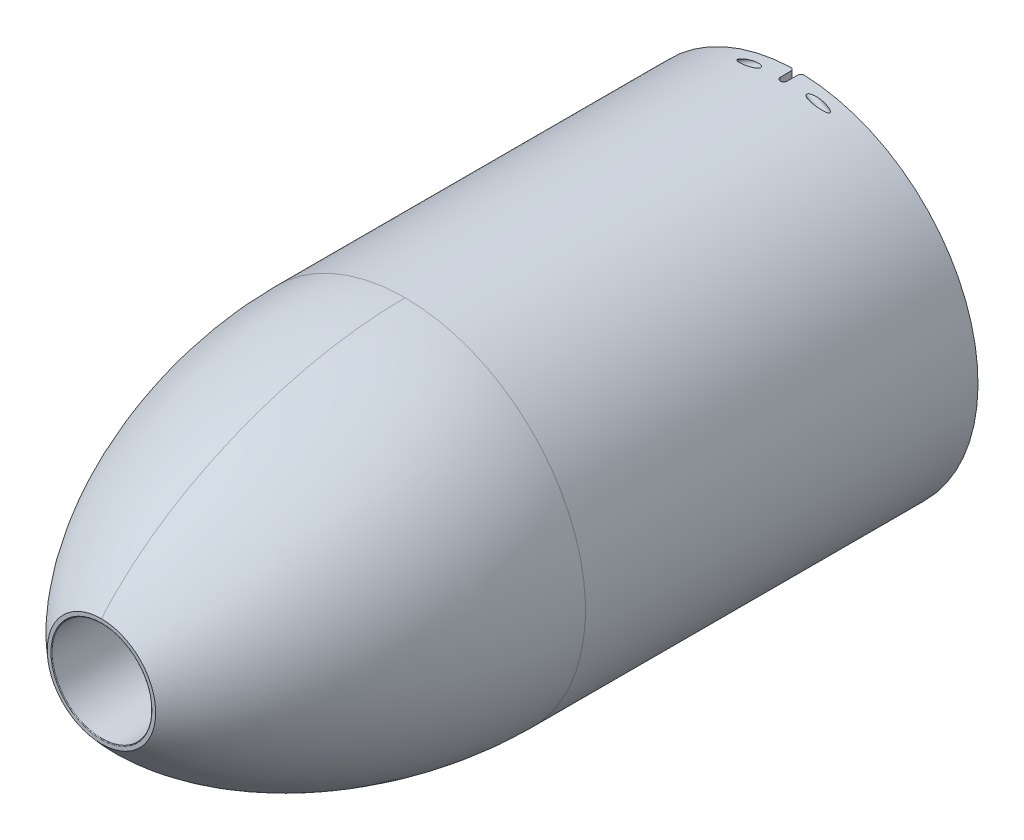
ISO-10303-21;
HEADER;
FILE_DESCRIPTION(('STEP AP214'),'2;1');
FILE_NAME('part.step','',(''),(''),'','','');
FILE_SCHEMA(('AUTOMOTIVE_DESIGN { 1 0 10303 214 1 1 1 1 }'));
ENDSEC;
DATA;
#1=APPLICATION_CONTEXT('core data for automotive mechanical design processes');
#2=APPLICATION_PROTOCOL_DEFINITION('international standard','automotive_design',2000,#1);
#3=PRODUCT_CONTEXT('',#1,'mechanical');
#4=PRODUCT('Part','Part','',(#3));
#5=PRODUCT_RELATED_PRODUCT_CATEGORY('part','',(#4));
#6=PRODUCT_DEFINITION_FORMATION('','',#4);
#7=PRODUCT_DEFINITION_CONTEXT('part definition',#1,'design');
#8=PRODUCT_DEFINITION('design','',#6,#7);
#9=PRODUCT_DEFINITION_SHAPE('','',#8);
#10=(LENGTH_UNIT() NAMED_UNIT(*) SI_UNIT(.MILLI.,.METRE.));
#11=(NAMED_UNIT(*) PLANE_ANGLE_UNIT() SI_UNIT($,.RADIAN.));
#12=(NAMED_UNIT(*) SI_UNIT($,.STERADIAN.) SOLID_ANGLE_UNIT());
#13=UNCERTAINTY_MEASURE_WITH_UNIT(LENGTH_MEASURE(1.E-05),#10,'distance_accuracy_value','');
#14=(GEOMETRIC_REPRESENTATION_CONTEXT(3) GLOBAL_UNCERTAINTY_ASSIGNED_CONTEXT((#13)) GLOBAL_UNIT_ASSIGNED_CONTEXT((#10,
#11,#12)) REPRESENTATION_CONTEXT('',''));
#15=CARTESIAN_POINT('',(0.,0.,0.));
#16=DIRECTION('',(0.,0.,1.));
#17=DIRECTION('',(1.,0.,0.));
#18=AXIS2_PLACEMENT_3D('',#15,#16,#17);
#19=CARTESIAN_POINT('',(-44.,0.,192.000000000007));
#20=DIRECTION('',(0.,0.,-1.));
#21=DIRECTION('',(-1.,0.,0.));
#22=AXIS2_PLACEMENT_3D('',#19,#20,#21);
#23=CONICAL_SURFACE('',#22,6.00000000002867,1.0297442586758);
#24=CARTESIAN_POINT('',(-44.,-2.84368927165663E-11,195.605163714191));
#25=VERTEX_POINT('',#24);
#26=VERTEX_LOOP('',#25);
#27=FACE_BOUND('',#26,.T.);
#28=CARTESIAN_POINT('',(-44.,0.,192.));
#29=DIRECTION('',(0.,0.,-1.));
#30=DIRECTION('',(0.,1.,0.));
#31=AXIS2_PLACEMENT_3D('',#28,#29,#30);
#32=CIRCLE('',#31,5.99999999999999);
#33=CARTESIAN_POINT('',(-44.,5.99999999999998,192.));
#34=VERTEX_POINT('',#33);
#35=EDGE_CURVE('E311',#34,#34,#32,.T.);
#36=ORIENTED_EDGE('',*,*,#35,.T.);
#37=EDGE_LOOP('',(#36));
#38=FACE_BOUND('',#37,.T.);
#39=ADVANCED_FACE('F16',(#27,#38),#23,.F.);
#40=CARTESIAN_POINT('',(44.,0.,192.000000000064));
#41=DIRECTION('',(0.,0.,-1.));
#42=DIRECTION('',(-1.,0.,0.));
#43=AXIS2_PLACEMENT_3D('',#40,#41,#42);
#44=CONICAL_SURFACE('',#43,5.99999999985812,1.0297442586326);
#45=CARTESIAN_POINT('',(44.,0.,195.60516371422));
#46=VERTEX_POINT('',#45);
#47=VERTEX_LOOP('',#46);
#48=FACE_BOUND('',#47,.T.);
#49=CARTESIAN_POINT('',(44.,0.,192.));
#50=DIRECTION('',(0.,0.,-1.));
#51=DIRECTION('',(0.,1.,0.));
#52=AXIS2_PLACEMENT_3D('',#49,#50,#51);
#53=CIRCLE('',#52,5.99999999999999);
#54=CARTESIAN_POINT('',(44.,6.,192.));
#55=VERTEX_POINT('',#54);
#56=EDGE_CURVE('E308',#55,#55,#53,.T.);
#57=ORIENTED_EDGE('',*,*,#56,.T.);
#58=EDGE_LOOP('',(#57));
#59=FACE_BOUND('',#58,.T.);
#60=ADVANCED_FACE('F897',(#48,#59),#44,.F.);
#61=CARTESIAN_POINT('',(-44.,0.,152.));
#62=DIRECTION('',(0.,0.,-1.));
#63=DIRECTION('',(0.,1.,0.));
#64=AXIS2_PLACEMENT_3D('',#61,#62,#63);
#65=CYLINDRICAL_SURFACE('',#64,5.99999999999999);
#66=CARTESIAN_POINT('',(-44.,0.,167.407745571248));
#67=DIRECTION('',(0.,0.,-1.));
#68=DIRECTION('',(0.,1.,0.));
#69=AXIS2_PLACEMENT_3D('',#66,#67,#68);
#70=CIRCLE('',#69,5.99999999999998);
#71=CARTESIAN_POINT('',(-44.,5.99999999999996,167.407745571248));
#72=VERTEX_POINT('',#71);
#73=EDGE_CURVE('E305',#72,#72,#70,.T.);
#74=ORIENTED_EDGE('',*,*,#73,.T.);
#75=EDGE_LOOP('',(#74));
#76=FACE_BOUND('',#75,.T.);
#77=ORIENTED_EDGE('',*,*,#35,.F.);
#78=EDGE_LOOP('',(#77));
#79=FACE_BOUND('',#78,.T.);
#80=ADVANCED_FACE('F894',(#76,#79),#65,.F.);
#81=CARTESIAN_POINT('',(44.,0.,152.));
#82=DIRECTION('',(0.,0.,-1.));
#83=DIRECTION('',(0.,1.,0.));
#84=AXIS2_PLACEMENT_3D('',#81,#82,#83);
#85=CYLINDRICAL_SURFACE('',#84,5.99999999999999);
#86=CARTESIAN_POINT('',(44.,0.,167.407745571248));
#87=DIRECTION('',(0.,0.,-1.));
#88=DIRECTION('',(0.,1.,0.));
#89=AXIS2_PLACEMENT_3D('',#86,#87,#88);
#90=CIRCLE('',#89,5.99999999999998);
#91=CARTESIAN_POINT('',(44.,5.99999999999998,167.407745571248));
#92=VERTEX_POINT('',#91);
#93=EDGE_CURVE('E256',#92,#92,#90,.T.);
#94=ORIENTED_EDGE('',*,*,#93,.T.);
#95=EDGE_LOOP('',(#94));
#96=FACE_BOUND('',#95,.T.);
#97=ORIENTED_EDGE('',*,*,#56,.F.);
#98=EDGE_LOOP('',(#97));
#99=FACE_BOUND('',#98,.T.);
#100=ADVANCED_FACE('F891',(#96,#99),#85,.F.);
#101=CARTESIAN_POINT('',(4.,50.,202.));
#102=DIRECTION('',(0.,0.,-1.));
#103=DIRECTION('',(0.,1.,0.));
#104=AXIS2_PLACEMENT_3D('',#101,#102,#103);
#105=PLANE('',#104);
#106=CARTESIAN_POINT('',(-4.,50.,202.));
#107=DIRECTION('',(0.,0.,-1.));
#108=DIRECTION('',(0.,1.,0.));
#109=AXIS2_PLACEMENT_3D('',#106,#107,#108);
#110=CIRCLE('',#109,16.);
#111=CARTESIAN_POINT('',(-4.,34.,202.));
#112=VERTEX_POINT('',#111);
#113=CARTESIAN_POINT('',(-4.,66.,202.));
#114=VERTEX_POINT('',#113);
#115=EDGE_CURVE('E237',#112,#114,#110,.T.);
#116=ORIENTED_EDGE('',*,*,#115,.T.);
#117=DIRECTION('',(1.,0.,0.));
#118=VECTOR('',#117,1.);
#119=CARTESIAN_POINT('',(4.,66.,202.));
#120=LINE('',#119,#118);
#121=CARTESIAN_POINT('',(4.,66.,202.));
#122=VERTEX_POINT('',#121);
#123=EDGE_CURVE('E255',#114,#122,#120,.T.);
#124=ORIENTED_EDGE('',*,*,#123,.T.);
#125=CARTESIAN_POINT('',(4.,50.,202.));
#126=DIRECTION('',(0.,0.,-1.));
#127=DIRECTION('',(0.,1.,0.));
#128=AXIS2_PLACEMENT_3D('',#125,#126,#127);
#129=CIRCLE('',#128,16.);
#130=CARTESIAN_POINT('',(4.,34.,202.));
#131=VERTEX_POINT('',#130);
#132=EDGE_CURVE('E240',#122,#131,#129,.T.);
#133=ORIENTED_EDGE('',*,*,#132,.T.);
#134=DIRECTION('',(1.,0.,0.));
#135=VECTOR('',#134,1.);
#136=CARTESIAN_POINT('',(4.,34.,202.));
#137=LINE('',#136,#135);
#138=EDGE_CURVE('E234',#131,#112,#137,.F.);
#139=ORIENTED_EDGE('',*,*,#138,.T.);
#140=EDGE_LOOP('',(#116,#124,#133,#139));
#141=FACE_BOUND('',#140,.T.);
#142=ADVANCED_FACE('F236',(#141),#105,.T.);
#143=CARTESIAN_POINT('',(-44.,0.,162.));
#144=DIRECTION('',(0.,0.,-1.));
#145=DIRECTION('',(-1.,0.,0.));
#146=AXIS2_PLACEMENT_3D('',#143,#144,#145);
#147=CONICAL_SURFACE('',#146,15.,1.02974425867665);
#148=CARTESIAN_POINT('',(-44.,0.,162.));
#149=DIRECTION('',(0.,0.,-1.));
#150=DIRECTION('',(0.,1.,0.));
#151=AXIS2_PLACEMENT_3D('',#148,#149,#150);
#152=CIRCLE('',#151,15.);
#153=CARTESIAN_POINT('',(-44.,15.,162.));
#154=VERTEX_POINT('',#153);
#155=EDGE_CURVE('E264',#154,#154,#152,.T.);
#156=ORIENTED_EDGE('',*,*,#155,.T.);
#157=EDGE_LOOP('',(#156));
#158=FACE_BOUND('',#157,.T.);
#159=ORIENTED_EDGE('',*,*,#73,.F.);
#160=EDGE_LOOP('',(#159));
#161=FACE_BOUND('',#160,.T.);
#162=ADVANCED_FACE('F884',(#158,#161),#147,.F.);
#163=CARTESIAN_POINT('',(44.,0.,162.));
#164=DIRECTION('',(0.,0.,-1.));
#165=DIRECTION('',(-1.,0.,0.));
#166=AXIS2_PLACEMENT_3D('',#163,#164,#165);
#167=CONICAL_SURFACE('',#166,15.,1.02974425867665);
#168=CARTESIAN_POINT('',(44.,0.,162.));
#169=DIRECTION('',(0.,0.,-1.));
#170=DIRECTION('',(0.,1.,0.));
#171=AXIS2_PLACEMENT_3D('',#168,#169,#170);
#172=CIRCLE('',#171,15.);
#173=CARTESIAN_POINT('',(44.,15.,162.));
#174=VERTEX_POINT('',#173);
#175=EDGE_CURVE('E296',#174,#174,#172,.T.);
#176=ORIENTED_EDGE('',*,*,#175,.T.);
#177=EDGE_LOOP('',(#176));
#178=FACE_BOUND('',#177,.T.);
#179=ORIENTED_EDGE('',*,*,#93,.F.);
#180=EDGE_LOOP('',(#179));
#181=FACE_BOUND('',#180,.T.);
#182=ADVANCED_FACE('F880',(#178,#181),#167,.F.);
#183=CARTESIAN_POINT('',(-36.8618419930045,-25.8109396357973,228.45));
#184=DIRECTION('',(0.,0.,1.));
#185=DIRECTION('',(0.,-1.,0.));
#186=AXIS2_PLACEMENT_3D('',#183,#184,#185);
#187=PLANE('',#186);
#188=CARTESIAN_POINT('',(-36.8618419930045,-25.8109396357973,228.45));
#189=DIRECTION('',(0.,0.,-1.));
#190=DIRECTION('',(0.,1.,0.));
#191=AXIS2_PLACEMENT_3D('',#188,#189,#190);
#192=CIRCLE('',#191,9.525);
#193=CARTESIAN_POINT('',(-36.8618419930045,-16.2859396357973,228.45));
#194=VERTEX_POINT('',#193);
#195=EDGE_CURVE('E299',#194,#194,#192,.T.);
#196=ORIENTED_EDGE('',*,*,#195,.T.);
#197=EDGE_LOOP('',(#196));
#198=FACE_BOUND('',#197,.T.);
#199=ADVANCED_FACE('F876',(#198),#187,.F.);
#200=CARTESIAN_POINT('',(36.8618419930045,-25.8109396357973,228.45));
#201=DIRECTION('',(0.,0.,1.));
#202=DIRECTION('',(0.,-1.,0.));
#203=AXIS2_PLACEMENT_3D('',#200,#201,#202);
#204=PLANE('',#203);
#205=CARTESIAN_POINT('',(36.8618419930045,-25.8109396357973,228.45));
#206=DIRECTION('',(0.,0.,-1.));
#207=DIRECTION('',(0.,1.,0.));
#208=AXIS2_PLACEMENT_3D('',#205,#206,#207);
#209=CIRCLE('',#208,9.525);
#210=CARTESIAN_POINT('',(36.8618419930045,-16.2859396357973,228.45));
#211=VERTEX_POINT('',#210);
#212=EDGE_CURVE('E1657',#211,#211,#209,.T.);
#213=ORIENTED_EDGE('',*,*,#212,.T.);
#214=EDGE_LOOP('',(#213));
#215=FACE_BOUND('',#214,.T.);
#216=ADVANCED_FACE('F872',(#215),#204,.F.);
#217=CARTESIAN_POINT('',(16.1612014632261,-31.0453791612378,228.45));
#218=DIRECTION('',(0.,0.,1.));
#219=DIRECTION('',(0.,-1.,0.));
#220=AXIS2_PLACEMENT_3D('',#217,#218,#219);
#221=PLANE('',#220);
#222=CARTESIAN_POINT('',(16.1612014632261,-31.0453791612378,228.45));
#223=DIRECTION('',(0.,0.,-1.));
#224=DIRECTION('',(0.,1.,0.));
#225=AXIS2_PLACEMENT_3D('',#222,#223,#224);
#226=CIRCLE('',#225,9.52499999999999);
#227=CARTESIAN_POINT('',(16.1612014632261,-21.5203791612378,228.45));
#228=VERTEX_POINT('',#227);
#229=EDGE_CURVE('E771',#228,#228,#226,.T.);
#230=ORIENTED_EDGE('',*,*,#229,.T.);
#231=EDGE_LOOP('',(#230));
#232=FACE_BOUND('',#231,.T.);
#233=ADVANCED_FACE('F868',(#232),#221,.F.);
#234=CARTESIAN_POINT('',(-16.1612014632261,-31.0453791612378,228.45));
#235=DIRECTION('',(0.,0.,1.));
#236=DIRECTION('',(0.,-1.,0.));
#237=AXIS2_PLACEMENT_3D('',#234,#235,#236);
#238=PLANE('',#237);
#239=CARTESIAN_POINT('',(-16.1612014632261,-31.0453791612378,228.45));
#240=DIRECTION('',(0.,0.,-1.));
#241=DIRECTION('',(0.,1.,0.));
#242=AXIS2_PLACEMENT_3D('',#239,#240,#241);
#243=CIRCLE('',#242,9.52499999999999);
#244=CARTESIAN_POINT('',(-16.1612014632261,-21.5203791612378,228.45));
#245=VERTEX_POINT('',#244);
#246=EDGE_CURVE('E290',#245,#245,#243,.T.);
#247=ORIENTED_EDGE('',*,*,#246,.T.);
#248=EDGE_LOOP('',(#247));
#249=FACE_BOUND('',#248,.T.);
#250=ADVANCED_FACE('F865',(#249),#238,.F.);
#251=CARTESIAN_POINT('',(-4.,50.,202.));
#252=DIRECTION('',(0.,0.,-1.));
#253=DIRECTION('',(0.,1.,0.));
#254=AXIS2_PLACEMENT_3D('',#251,#252,#253);
#255=CYLINDRICAL_SURFACE('',#254,16.);
#256=DIRECTION('',(0.,0.,-1.));
#257=VECTOR('',#256,1.);
#258=CARTESIAN_POINT('',(-4.,34.,202.));
#259=LINE('',#258,#257);
#260=CARTESIAN_POINT('',(-4.,34.,152.8));
#261=VERTEX_POINT('',#260);
#262=EDGE_CURVE('E245',#112,#261,#259,.T.);
#263=ORIENTED_EDGE('',*,*,#262,.T.);
#264=CARTESIAN_POINT('',(-4.,50.,152.8));
#265=DIRECTION('',(0.,0.,-1.));
#266=DIRECTION('',(-1.,0.,0.));
#267=AXIS2_PLACEMENT_3D('',#264,#265,#266);
#268=CIRCLE('',#267,16.);
#269=CARTESIAN_POINT('',(-4.,66.,152.8));
#270=VERTEX_POINT('',#269);
#271=EDGE_CURVE('E282',#261,#270,#268,.T.);
#272=ORIENTED_EDGE('',*,*,#271,.T.);
#273=DIRECTION('',(0.,0.,1.));
#274=VECTOR('',#273,1.);
#275=CARTESIAN_POINT('',(-4.,66.,202.));
#276=LINE('',#275,#274);
#277=EDGE_CURVE('E253',#270,#114,#276,.T.);
#278=ORIENTED_EDGE('',*,*,#277,.T.);
#279=ORIENTED_EDGE('',*,*,#115,.F.);
#280=EDGE_LOOP('',(#263,#272,#278,#279));
#281=FACE_BOUND('',#280,.T.);
#282=ADVANCED_FACE('F250',(#281),#255,.F.);
#283=CARTESIAN_POINT('',(4.,66.,202.));
#284=DIRECTION('',(0.,1.,0.));
#285=DIRECTION('',(0.,0.,1.));
#286=AXIS2_PLACEMENT_3D('',#283,#284,#285);
#287=PLANE('',#286);
#288=DIRECTION('',(1.,0.,0.));
#289=VECTOR('',#288,1.);
#290=CARTESIAN_POINT('',(4.,66.,152.8));
#291=LINE('',#290,#289);
#292=CARTESIAN_POINT('',(4.,66.,152.8));
#293=VERTEX_POINT('',#292);
#294=EDGE_CURVE('E280',#270,#293,#291,.T.);
#295=ORIENTED_EDGE('',*,*,#294,.T.);
#296=DIRECTION('',(0.,0.,-1.));
#297=VECTOR('',#296,1.);
#298=CARTESIAN_POINT('',(4.,66.,202.));
#299=LINE('',#298,#297);
#300=EDGE_CURVE('E246',#293,#122,#299,.F.);
#301=ORIENTED_EDGE('',*,*,#300,.T.);
#302=ORIENTED_EDGE('',*,*,#123,.F.);
#303=ORIENTED_EDGE('',*,*,#277,.F.);
#304=EDGE_LOOP('',(#295,#301,#302,#303));
#305=FACE_BOUND('',#304,.T.);
#306=ADVANCED_FACE('F858',(#305),#287,.F.);
#307=CARTESIAN_POINT('',(4.,50.,202.));
#308=DIRECTION('',(0.,0.,-1.));
#309=DIRECTION('',(0.,1.,0.));
#310=AXIS2_PLACEMENT_3D('',#307,#308,#309);
#311=CYLINDRICAL_SURFACE('',#310,16.);
#312=CARTESIAN_POINT('',(4.,50.,152.8));
#313=DIRECTION('',(0.,0.,-1.));
#314=DIRECTION('',(-1.,0.,0.));
#315=AXIS2_PLACEMENT_3D('',#312,#313,#314);
#316=CIRCLE('',#315,16.);
#317=CARTESIAN_POINT('',(4.,34.,152.8));
#318=VERTEX_POINT('',#317);
#319=EDGE_CURVE('E274',#293,#318,#316,.T.);
#320=ORIENTED_EDGE('',*,*,#319,.T.);
#321=DIRECTION('',(0.,0.,-1.));
#322=VECTOR('',#321,1.);
#323=CARTESIAN_POINT('',(4.,34.,202.));
#324=LINE('',#323,#322);
#325=EDGE_CURVE('E262',#318,#131,#324,.F.);
#326=ORIENTED_EDGE('',*,*,#325,.T.);
#327=ORIENTED_EDGE('',*,*,#132,.F.);
#328=ORIENTED_EDGE('',*,*,#300,.F.);
#329=EDGE_LOOP('',(#320,#326,#327,#328));
#330=FACE_BOUND('',#329,.T.);
#331=ADVANCED_FACE('F855',(#330),#311,.F.);
#332=CARTESIAN_POINT('',(4.,34.,202.));
#333=DIRECTION('',(0.,-1.,0.));
#334=DIRECTION('',(0.,0.,-1.));
#335=AXIS2_PLACEMENT_3D('',#332,#333,#334);
#336=PLANE('',#335);
#337=DIRECTION('',(1.,0.,0.));
#338=VECTOR('',#337,1.);
#339=CARTESIAN_POINT('',(4.,34.,152.8));
#340=LINE('',#339,#338);
#341=EDGE_CURVE('E260',#318,#261,#340,.F.);
#342=ORIENTED_EDGE('',*,*,#341,.T.);
#343=ORIENTED_EDGE('',*,*,#262,.F.);
#344=ORIENTED_EDGE('',*,*,#138,.F.);
#345=ORIENTED_EDGE('',*,*,#325,.F.);
#346=EDGE_LOOP('',(#342,#343,#344,#345));
#347=FACE_BOUND('',#346,.T.);
#348=ADVANCED_FACE('F258',(#347),#336,.F.);
#349=CARTESIAN_POINT('',(-44.,0.,152.));
#350=DIRECTION('',(0.,0.,-1.));
#351=DIRECTION('',(0.,1.,0.));
#352=AXIS2_PLACEMENT_3D('',#349,#350,#351);
#353=CYLINDRICAL_SURFACE('',#352,15.);
#354=CARTESIAN_POINT('',(-44.,0.,152.8));
#355=DIRECTION('',(0.,0.,-1.));
#356=DIRECTION('',(0.,1.,0.));
#357=AXIS2_PLACEMENT_3D('',#354,#355,#356);
#358=CIRCLE('',#357,15.);
#359=CARTESIAN_POINT('',(-44.,15.,152.8));
#360=VERTEX_POINT('',#359);
#361=EDGE_CURVE('E722',#360,#360,#358,.T.);
#362=ORIENTED_EDGE('',*,*,#361,.T.);
#363=EDGE_LOOP('',(#362));
#364=FACE_BOUND('',#363,.T.);
#365=ORIENTED_EDGE('',*,*,#155,.F.);
#366=EDGE_LOOP('',(#365));
#367=FACE_BOUND('',#366,.T.);
#368=ADVANCED_FACE('F783',(#364,#367),#353,.F.);
#369=CARTESIAN_POINT('',(44.,0.,152.));
#370=DIRECTION('',(0.,0.,-1.));
#371=DIRECTION('',(0.,1.,0.));
#372=AXIS2_PLACEMENT_3D('',#369,#370,#371);
#373=CYLINDRICAL_SURFACE('',#372,15.);
#374=CARTESIAN_POINT('',(44.,0.,152.8));
#375=DIRECTION('',(0.,0.,-1.));
#376=DIRECTION('',(0.,1.,0.));
#377=AXIS2_PLACEMENT_3D('',#374,#375,#376);
#378=CIRCLE('',#377,15.);
#379=CARTESIAN_POINT('',(44.,15.,152.8));
#380=VERTEX_POINT('',#379);
#381=EDGE_CURVE('E777',#380,#380,#378,.T.);
#382=ORIENTED_EDGE('',*,*,#381,.T.);
#383=EDGE_LOOP('',(#382));
#384=FACE_BOUND('',#383,.T.);
#385=ORIENTED_EDGE('',*,*,#175,.F.);
#386=EDGE_LOOP('',(#385));
#387=FACE_BOUND('',#386,.T.);
#388=ADVANCED_FACE('F846',(#384,#387),#373,.F.);
#389=CARTESIAN_POINT('',(-36.8618419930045,-25.8109396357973,152.));
#390=DIRECTION('',(0.,0.,-1.));
#391=DIRECTION('',(0.,1.,0.));
#392=AXIS2_PLACEMENT_3D('',#389,#390,#391);
#393=CYLINDRICAL_SURFACE('',#392,9.525);
#394=ORIENTED_EDGE('',*,*,#195,.F.);
#395=EDGE_LOOP('',(#394));
#396=FACE_BOUND('',#395,.T.);
#397=CARTESIAN_POINT('',(-36.8618419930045,-25.8109396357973,152.8));
#398=DIRECTION('',(0.,0.,-1.));
#399=DIRECTION('',(-1.,0.,0.));
#400=AXIS2_PLACEMENT_3D('',#397,#398,#399);
#401=CIRCLE('',#400,9.52499999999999);
#402=CARTESIAN_POINT('',(-46.3868419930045,-25.8109396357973,152.8));
#403=VERTEX_POINT('',#402);
#404=EDGE_CURVE('E774',#403,#403,#401,.T.);
#405=ORIENTED_EDGE('',*,*,#404,.T.);
#406=EDGE_LOOP('',(#405));
#407=FACE_BOUND('',#406,.T.);
#408=ADVANCED_FACE('F842',(#396,#407),#393,.F.);
#409=CARTESIAN_POINT('',(36.8618419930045,-25.8109396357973,152.));
#410=DIRECTION('',(0.,0.,-1.));
#411=DIRECTION('',(0.,1.,0.));
#412=AXIS2_PLACEMENT_3D('',#409,#410,#411);
#413=CYLINDRICAL_SURFACE('',#412,9.525);
#414=ORIENTED_EDGE('',*,*,#212,.F.);
#415=EDGE_LOOP('',(#414));
#416=FACE_BOUND('',#415,.T.);
#417=CARTESIAN_POINT('',(36.8618419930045,-25.8109396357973,152.8));
#418=DIRECTION('',(0.,0.,-1.));
#419=DIRECTION('',(-1.,0.,0.));
#420=AXIS2_PLACEMENT_3D('',#417,#418,#419);
#421=CIRCLE('',#420,9.52499999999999);
#422=CARTESIAN_POINT('',(27.3368419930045,-25.8109396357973,152.8));
#423=VERTEX_POINT('',#422);
#424=EDGE_CURVE('E738',#423,#423,#421,.T.);
#425=ORIENTED_EDGE('',*,*,#424,.T.);
#426=EDGE_LOOP('',(#425));
#427=FACE_BOUND('',#426,.T.);
#428=ADVANCED_FACE('F838',(#416,#427),#413,.F.);
#429=CARTESIAN_POINT('',(16.1612014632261,-31.0453791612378,152.));
#430=DIRECTION('',(0.,0.,-1.));
#431=DIRECTION('',(0.,1.,0.));
#432=AXIS2_PLACEMENT_3D('',#429,#430,#431);
#433=CYLINDRICAL_SURFACE('',#432,9.52499999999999);
#434=ORIENTED_EDGE('',*,*,#229,.F.);
#435=EDGE_LOOP('',(#434));
#436=FACE_BOUND('',#435,.T.);
#437=DIRECTION('',(0.,0.,-1.));
#438=VECTOR('',#437,1.);
#439=CARTESIAN_POINT('',(7.21944758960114,-34.3272479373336,202.));
#440=LINE('',#439,#438);
#441=CARTESIAN_POINT('',(7.21944758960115,-34.3272479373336,202.));
#442=VERTEX_POINT('',#441);
#443=CARTESIAN_POINT('',(7.21944758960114,-34.3272479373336,152.8));
#444=VERTEX_POINT('',#443);
#445=EDGE_CURVE('E698',#442,#444,#440,.T.);
#446=ORIENTED_EDGE('',*,*,#445,.T.);
#447=CARTESIAN_POINT('',(16.1612014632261,-31.0453791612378,152.8));
#448=DIRECTION('',(0.,0.,-1.));
#449=DIRECTION('',(-1.,0.,0.));
#450=AXIS2_PLACEMENT_3D('',#447,#448,#449);
#451=CIRCLE('',#450,9.52499999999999);
#452=CARTESIAN_POINT('',(16.9047745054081,-40.541311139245,152.8));
#453=VERTEX_POINT('',#452);
#454=EDGE_CURVE('E759',#444,#453,#451,.T.);
#455=ORIENTED_EDGE('',*,*,#454,.T.);
#456=DIRECTION('',(0.,0.,-1.));
#457=VECTOR('',#456,1.);
#458=CARTESIAN_POINT('',(16.9047745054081,-40.541311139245,202.));
#459=LINE('',#458,#457);
#460=CARTESIAN_POINT('',(16.9047745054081,-40.541311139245,202.));
#461=VERTEX_POINT('',#460);
#462=EDGE_CURVE('E763',#453,#461,#459,.F.);
#463=ORIENTED_EDGE('',*,*,#462,.T.);
#464=CARTESIAN_POINT('',(16.1612014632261,-31.0453791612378,202.));
#465=DIRECTION('',(0.,0.,-1.));
#466=DIRECTION('',(0.,1.,0.));
#467=AXIS2_PLACEMENT_3D('',#464,#465,#466);
#468=CIRCLE('',#467,9.52499999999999);
#469=EDGE_CURVE('E1651',#461,#442,#468,.T.);
#470=ORIENTED_EDGE('',*,*,#469,.T.);
#471=EDGE_LOOP('',(#446,#455,#463,#470));
#472=FACE_BOUND('',#471,.T.);
#473=ADVANCED_FACE('F834',(#436,#472),#433,.F.);
#474=CARTESIAN_POINT('',(4.,-50.,202.));
#475=DIRECTION('',(0.,0.,-1.));
#476=DIRECTION('',(0.,1.,0.));
#477=AXIS2_PLACEMENT_3D('',#474,#475,#476);
#478=CYLINDRICAL_SURFACE('',#477,16.);
#479=CARTESIAN_POINT('',(4.,-50.,152.8));
#480=DIRECTION('',(0.,0.,-1.));
#481=DIRECTION('',(-1.,0.,0.));
#482=AXIS2_PLACEMENT_3D('',#479,#480,#481);
#483=CIRCLE('',#482,16.);
#484=CARTESIAN_POINT('',(4.,-66.,152.8));
#485=VERTEX_POINT('',#484);
#486=EDGE_CURVE('E757',#453,#485,#483,.T.);
#487=ORIENTED_EDGE('',*,*,#486,.T.);
#488=DIRECTION('',(0.,0.,-1.));
#489=VECTOR('',#488,1.);
#490=CARTESIAN_POINT('',(4.,-66.,202.));
#491=LINE('',#490,#489);
#492=CARTESIAN_POINT('',(4.,-66.,202.));
#493=VERTEX_POINT('',#492);
#494=EDGE_CURVE('E750',#485,#493,#491,.F.);
#495=ORIENTED_EDGE('',*,*,#494,.T.);
#496=CARTESIAN_POINT('',(4.,-50.,202.));
#497=DIRECTION('',(0.,0.,-1.));
#498=DIRECTION('',(0.,1.,0.));
#499=AXIS2_PLACEMENT_3D('',#496,#497,#498);
#500=CIRCLE('',#499,16.);
#501=EDGE_CURVE('E742',#493,#461,#500,.F.);
#502=ORIENTED_EDGE('',*,*,#501,.T.);
#503=ORIENTED_EDGE('',*,*,#462,.F.);
#504=EDGE_LOOP('',(#487,#495,#502,#503));
#505=FACE_BOUND('',#504,.T.);
#506=ADVANCED_FACE('F830',(#505),#478,.F.);
#507=CARTESIAN_POINT('',(4.,-66.,202.));
#508=DIRECTION('',(0.,-1.,0.));
#509=DIRECTION('',(0.,0.,-1.));
#510=AXIS2_PLACEMENT_3D('',#507,#508,#509);
#511=PLANE('',#510);
#512=DIRECTION('',(1.,0.,0.));
#513=VECTOR('',#512,1.);
#514=CARTESIAN_POINT('',(4.,-66.,152.8));
#515=LINE('',#514,#513);
#516=CARTESIAN_POINT('',(-4.,-66.,152.8));
#517=VERTEX_POINT('',#516);
#518=EDGE_CURVE('E689',#485,#517,#515,.F.);
#519=ORIENTED_EDGE('',*,*,#518,.T.);
#520=DIRECTION('',(0.,0.,-1.));
#521=VECTOR('',#520,1.);
#522=CARTESIAN_POINT('',(-4.,-66.,202.));
#523=LINE('',#522,#521);
#524=CARTESIAN_POINT('',(-4.,-66.,202.));
#525=VERTEX_POINT('',#524);
#526=EDGE_CURVE('E745',#517,#525,#523,.F.);
#527=ORIENTED_EDGE('',*,*,#526,.T.);
#528=DIRECTION('',(1.,0.,0.));
#529=VECTOR('',#528,1.);
#530=CARTESIAN_POINT('',(4.,-66.,202.));
#531=LINE('',#530,#529);
#532=EDGE_CURVE('E739',#525,#493,#531,.T.);
#533=ORIENTED_EDGE('',*,*,#532,.T.);
#534=ORIENTED_EDGE('',*,*,#494,.F.);
#535=EDGE_LOOP('',(#519,#527,#533,#534));
#536=FACE_BOUND('',#535,.T.);
#537=ADVANCED_FACE('F826',(#536),#511,.F.);
#538=CARTESIAN_POINT('',(-4.,-50.,202.));
#539=DIRECTION('',(0.,0.,-1.));
#540=DIRECTION('',(0.,1.,0.));
#541=AXIS2_PLACEMENT_3D('',#538,#539,#540);
#542=CYLINDRICAL_SURFACE('',#541,16.);
#543=ORIENTED_EDGE('',*,*,#526,.F.);
#544=CARTESIAN_POINT('',(-4.,-50.,152.8));
#545=DIRECTION('',(0.,0.,-1.));
#546=DIRECTION('',(-1.,0.,0.));
#547=AXIS2_PLACEMENT_3D('',#544,#545,#546);
#548=CIRCLE('',#547,16.);
#549=CARTESIAN_POINT('',(-16.9047745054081,-40.541311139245,152.8));
#550=VERTEX_POINT('',#549);
#551=EDGE_CURVE('E684',#517,#550,#548,.T.);
#552=ORIENTED_EDGE('',*,*,#551,.T.);
#553=DIRECTION('',(0.,0.,-1.));
#554=VECTOR('',#553,1.);
#555=CARTESIAN_POINT('',(-16.9047745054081,-40.541311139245,152.));
#556=LINE('',#555,#554);
#557=CARTESIAN_POINT('',(-16.9047745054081,-40.541311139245,202.));
#558=VERTEX_POINT('',#557);
#559=EDGE_CURVE('E743',#550,#558,#556,.F.);
#560=ORIENTED_EDGE('',*,*,#559,.T.);
#561=CARTESIAN_POINT('',(-4.,-50.,202.));
#562=DIRECTION('',(0.,0.,-1.));
#563=DIRECTION('',(0.,1.,0.));
#564=AXIS2_PLACEMENT_3D('',#561,#562,#563);
#565=CIRCLE('',#564,16.);
#566=EDGE_CURVE('E1648',#558,#525,#565,.F.);
#567=ORIENTED_EDGE('',*,*,#566,.T.);
#568=EDGE_LOOP('',(#543,#552,#560,#567));
#569=FACE_BOUND('',#568,.T.);
#570=ADVANCED_FACE('F822',(#569),#542,.F.);
#571=CARTESIAN_POINT('',(4.,-50.,202.));
#572=DIRECTION('',(0.,0.,1.));
#573=DIRECTION('',(0.,-1.,0.));
#574=AXIS2_PLACEMENT_3D('',#571,#572,#573);
#575=PLANE('',#574);
#576=ORIENTED_EDGE('',*,*,#566,.F.);
#577=CARTESIAN_POINT('',(-16.1612014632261,-31.0453791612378,202.));
#578=DIRECTION('',(0.,0.,-1.));
#579=DIRECTION('',(0.,1.,0.));
#580=AXIS2_PLACEMENT_3D('',#577,#578,#579);
#581=CIRCLE('',#580,9.52499999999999);
#582=CARTESIAN_POINT('',(-7.21944758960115,-34.3272479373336,202.));
#583=VERTEX_POINT('',#582);
#584=EDGE_CURVE('E1646',#558,#583,#581,.F.);
#585=ORIENTED_EDGE('',*,*,#584,.T.);
#586=CARTESIAN_POINT('',(-4.,-50.,202.));
#587=DIRECTION('',(0.,0.,-1.));
#588=DIRECTION('',(0.,1.,0.));
#589=AXIS2_PLACEMENT_3D('',#586,#587,#588);
#590=CIRCLE('',#589,16.);
#591=CARTESIAN_POINT('',(-4.,-34.,202.));
#592=VERTEX_POINT('',#591);
#593=EDGE_CURVE('E631',#583,#592,#590,.T.);
#594=ORIENTED_EDGE('',*,*,#593,.T.);
#595=DIRECTION('',(1.,0.,0.));
#596=VECTOR('',#595,1.);
#597=CARTESIAN_POINT('',(4.,-34.,202.));
#598=LINE('',#597,#596);
#599=CARTESIAN_POINT('',(4.,-34.,202.));
#600=VERTEX_POINT('',#599);
#601=EDGE_CURVE('E704',#592,#600,#598,.T.);
#602=ORIENTED_EDGE('',*,*,#601,.T.);
#603=CARTESIAN_POINT('',(4.,-50.,202.));
#604=DIRECTION('',(0.,0.,-1.));
#605=DIRECTION('',(0.,1.,0.));
#606=AXIS2_PLACEMENT_3D('',#603,#604,#605);
#607=CIRCLE('',#606,16.);
#608=EDGE_CURVE('E702',#600,#442,#607,.T.);
#609=ORIENTED_EDGE('',*,*,#608,.T.);
#610=ORIENTED_EDGE('',*,*,#469,.F.);
#611=ORIENTED_EDGE('',*,*,#501,.F.);
#612=ORIENTED_EDGE('',*,*,#532,.F.);
#613=EDGE_LOOP('',(#576,#585,#594,#602,#609,#610,#611,#612));
#614=FACE_BOUND('',#613,.T.);
#615=ADVANCED_FACE('F818',(#614),#575,.F.);
#616=CARTESIAN_POINT('',(-16.1612014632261,-31.0453791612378,152.));
#617=DIRECTION('',(0.,0.,-1.));
#618=DIRECTION('',(0.,1.,0.));
#619=AXIS2_PLACEMENT_3D('',#616,#617,#618);
#620=CYLINDRICAL_SURFACE('',#619,9.52499999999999);
#621=ORIENTED_EDGE('',*,*,#246,.F.);
#622=EDGE_LOOP('',(#621));
#623=FACE_BOUND('',#622,.T.);
#624=ORIENTED_EDGE('',*,*,#559,.F.);
#625=CARTESIAN_POINT('',(-16.1612014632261,-31.0453791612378,152.8));
#626=DIRECTION('',(0.,0.,-1.));
#627=DIRECTION('',(-1.,0.,0.));
#628=AXIS2_PLACEMENT_3D('',#625,#626,#627);
#629=CIRCLE('',#628,9.525);
#630=CARTESIAN_POINT('',(-7.21944758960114,-34.3272479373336,152.8));
#631=VERTEX_POINT('',#630);
#632=EDGE_CURVE('E733',#550,#631,#629,.T.);
#633=ORIENTED_EDGE('',*,*,#632,.T.);
#634=DIRECTION('',(0.,0.,-1.));
#635=VECTOR('',#634,1.);
#636=CARTESIAN_POINT('',(-7.21944758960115,-34.3272479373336,202.));
#637=LINE('',#636,#635);
#638=EDGE_CURVE('E622',#631,#583,#637,.F.);
#639=ORIENTED_EDGE('',*,*,#638,.T.);
#640=ORIENTED_EDGE('',*,*,#584,.F.);
#641=EDGE_LOOP('',(#624,#633,#639,#640));
#642=FACE_BOUND('',#641,.T.);
#643=ADVANCED_FACE('F814',(#623,#642),#620,.F.);
#644=CARTESIAN_POINT('',(-4.,50.,152.));
#645=DIRECTION('',(0.,0.,-1.));
#646=DIRECTION('',(-1.,0.,0.));
#647=AXIS2_PLACEMENT_3D('',#644,#645,#646);
#648=CONICAL_SURFACE('',#647,16.8,0.78539816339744);
#649=ORIENTED_EDGE('',*,*,#271,.F.);
#650=DIRECTION('',(0.,-0.707106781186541,-0.707106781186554));
#651=VECTOR('',#650,1.);
#652=CARTESIAN_POINT('',(-4.,34.,152.8));
#653=LINE('',#652,#651);
#654=CARTESIAN_POINT('',(-4.,33.2,152.));
#655=VERTEX_POINT('',#654);
#656=EDGE_CURVE('E719',#261,#655,#653,.T.);
#657=ORIENTED_EDGE('',*,*,#656,.T.);
#658=CARTESIAN_POINT('',(-4.,50.,152.));
#659=DIRECTION('',(0.,0.,-1.));
#660=DIRECTION('',(-1.,0.,0.));
#661=AXIS2_PLACEMENT_3D('',#658,#659,#660);
#662=CIRCLE('',#661,16.8);
#663=CARTESIAN_POINT('',(-4.,66.8,152.));
#664=VERTEX_POINT('',#663);
#665=EDGE_CURVE('E590',#655,#664,#662,.T.);
#666=ORIENTED_EDGE('',*,*,#665,.T.);
#667=DIRECTION('',(0.,-0.707106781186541,0.707106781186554));
#668=VECTOR('',#667,1.);
#669=CARTESIAN_POINT('',(-4.,66.,152.8));
#670=LINE('',#669,#668);
#671=EDGE_CURVE('E277',#664,#270,#670,.T.);
#672=ORIENTED_EDGE('',*,*,#671,.T.);
#673=EDGE_LOOP('',(#649,#657,#666,#672));
#674=FACE_BOUND('',#673,.T.);
#675=ADVANCED_FACE('F810',(#674),#648,.F.);
#676=CARTESIAN_POINT('',(4.,66.,152.8));
#677=DIRECTION('',(0.,0.707106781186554,0.707106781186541));
#678=DIRECTION('',(0.,-0.707106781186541,0.707106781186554));
#679=AXIS2_PLACEMENT_3D('',#676,#677,#678);
#680=PLANE('',#679);
#681=DIRECTION('',(1.,0.,0.));
#682=VECTOR('',#681,1.);
#683=CARTESIAN_POINT('',(0.,66.8,152.));
#684=LINE('',#683,#682);
#685=CARTESIAN_POINT('',(4.,66.8,152.));
#686=VERTEX_POINT('',#685);
#687=EDGE_CURVE('E587',#664,#686,#684,.T.);
#688=ORIENTED_EDGE('',*,*,#687,.T.);
#689=DIRECTION('',(0.,-0.707106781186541,0.707106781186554));
#690=VECTOR('',#689,1.);
#691=CARTESIAN_POINT('',(4.,66.,152.8));
#692=LINE('',#691,#690);
#693=EDGE_CURVE('E276',#686,#293,#692,.T.);
#694=ORIENTED_EDGE('',*,*,#693,.T.);
#695=ORIENTED_EDGE('',*,*,#294,.F.);
#696=ORIENTED_EDGE('',*,*,#671,.F.);
#697=EDGE_LOOP('',(#688,#694,#695,#696));
#698=FACE_BOUND('',#697,.T.);
#699=ADVANCED_FACE('F806',(#698),#680,.F.);
#700=CARTESIAN_POINT('',(4.,50.,152.));
#701=DIRECTION('',(0.,0.,-1.));
#702=DIRECTION('',(-1.,0.,0.));
#703=AXIS2_PLACEMENT_3D('',#700,#701,#702);
#704=CONICAL_SURFACE('',#703,16.8,0.78539816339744);
#705=CARTESIAN_POINT('',(4.,50.,152.));
#706=DIRECTION('',(0.,0.,-1.));
#707=DIRECTION('',(-1.,0.,0.));
#708=AXIS2_PLACEMENT_3D('',#705,#706,#707);
#709=CIRCLE('',#708,16.8);
#710=CARTESIAN_POINT('',(4.,33.2,152.));
#711=VERTEX_POINT('',#710);
#712=EDGE_CURVE('E589',#686,#711,#709,.T.);
#713=ORIENTED_EDGE('',*,*,#712,.T.);
#714=DIRECTION('',(0.,-0.707106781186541,-0.707106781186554));
#715=VECTOR('',#714,1.);
#716=CARTESIAN_POINT('',(4.,34.,152.8));
#717=LINE('',#716,#715);
#718=EDGE_CURVE('E709',#711,#318,#717,.F.);
#719=ORIENTED_EDGE('',*,*,#718,.T.);
#720=ORIENTED_EDGE('',*,*,#319,.F.);
#721=ORIENTED_EDGE('',*,*,#693,.F.);
#722=EDGE_LOOP('',(#713,#719,#720,#721));
#723=FACE_BOUND('',#722,.T.);
#724=ADVANCED_FACE('F799',(#723),#704,.F.);
#725=CARTESIAN_POINT('',(4.,34.,152.8));
#726=DIRECTION('',(0.,-0.707106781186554,0.707106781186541));
#727=DIRECTION('',(0.,-0.707106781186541,-0.707106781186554));
#728=AXIS2_PLACEMENT_3D('',#725,#726,#727);
#729=PLANE('',#728);
#730=ORIENTED_EDGE('',*,*,#341,.F.);
#731=ORIENTED_EDGE('',*,*,#718,.F.);
#732=DIRECTION('',(1.,0.,0.));
#733=VECTOR('',#732,1.);
#734=CARTESIAN_POINT('',(0.,33.2,152.));
#735=LINE('',#734,#733);
#736=EDGE_CURVE('E591',#711,#655,#735,.F.);
#737=ORIENTED_EDGE('',*,*,#736,.T.);
#738=ORIENTED_EDGE('',*,*,#656,.F.);
#739=EDGE_LOOP('',(#730,#731,#737,#738));
#740=FACE_BOUND('',#739,.T.);
#741=ADVANCED_FACE('F789',(#740),#729,.F.);
#742=CARTESIAN_POINT('',(-44.,0.,152.));
#743=DIRECTION('',(0.,0.,-1.));
#744=DIRECTION('',(-1.,0.,0.));
#745=AXIS2_PLACEMENT_3D('',#742,#743,#744);
#746=CONICAL_SURFACE('',#745,15.8,0.785398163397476);
#747=CARTESIAN_POINT('',(-44.,0.,152.));
#748=DIRECTION('',(0.,0.,-1.));
#749=DIRECTION('',(-1.,0.,0.));
#750=AXIS2_PLACEMENT_3D('',#747,#748,#749);
#751=CIRCLE('',#750,15.8);
#752=CARTESIAN_POINT('',(-59.8,0.,152.));
#753=VERTEX_POINT('',#752);
#754=EDGE_CURVE('E593',#753,#753,#751,.T.);
#755=ORIENTED_EDGE('',*,*,#754,.T.);
#756=EDGE_LOOP('',(#755));
#757=FACE_BOUND('',#756,.T.);
#758=ORIENTED_EDGE('',*,*,#361,.F.);
#759=EDGE_LOOP('',(#758));
#760=FACE_BOUND('',#759,.T.);
#761=ADVANCED_FACE('F786',(#757,#760),#746,.F.);
#762=CARTESIAN_POINT('',(44.,0.,152.));
#763=DIRECTION('',(0.,0.,-1.));
#764=DIRECTION('',(-1.,0.,0.));
#765=AXIS2_PLACEMENT_3D('',#762,#763,#764);
#766=CONICAL_SURFACE('',#765,15.8,0.785398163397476);
#767=CARTESIAN_POINT('',(44.,0.,152.));
#768=DIRECTION('',(0.,0.,-1.));
#769=DIRECTION('',(-1.,0.,0.));
#770=AXIS2_PLACEMENT_3D('',#767,#768,#769);
#771=CIRCLE('',#770,15.8);
#772=CARTESIAN_POINT('',(28.2,0.,152.));
#773=VERTEX_POINT('',#772);
#774=EDGE_CURVE('E615',#773,#773,#771,.T.);
#775=ORIENTED_EDGE('',*,*,#774,.T.);
#776=EDGE_LOOP('',(#775));
#777=FACE_BOUND('',#776,.T.);
#778=ORIENTED_EDGE('',*,*,#381,.F.);
#779=EDGE_LOOP('',(#778));
#780=FACE_BOUND('',#779,.T.);
#781=ADVANCED_FACE('F788',(#777,#780),#766,.F.);
#782=CARTESIAN_POINT('',(-36.8618419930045,-25.8109396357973,152.));
#783=DIRECTION('',(0.,0.,-1.));
#784=DIRECTION('',(-1.,0.,0.));
#785=AXIS2_PLACEMENT_3D('',#782,#783,#784);
#786=CONICAL_SURFACE('',#785,10.3250000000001,0.785398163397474);
#787=CARTESIAN_POINT('',(-36.8618419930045,-25.8109396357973,152.));
#788=DIRECTION('',(0.,0.,-1.));
#789=DIRECTION('',(-1.,0.,0.));
#790=AXIS2_PLACEMENT_3D('',#787,#788,#789);
#791=CIRCLE('',#790,10.3250000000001);
#792=CARTESIAN_POINT('',(-47.1868419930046,-25.8109396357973,152.));
#793=VERTEX_POINT('',#792);
#794=EDGE_CURVE('E612',#793,#793,#791,.T.);
#795=ORIENTED_EDGE('',*,*,#794,.T.);
#796=EDGE_LOOP('',(#795));
#797=FACE_BOUND('',#796,.T.);
#798=ORIENTED_EDGE('',*,*,#404,.F.);
#799=EDGE_LOOP('',(#798));
#800=FACE_BOUND('',#799,.T.);
#801=ADVANCED_FACE('F796',(#797,#800),#786,.F.);
#802=CARTESIAN_POINT('',(36.8618419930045,-25.8109396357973,152.));
#803=DIRECTION('',(0.,0.,-1.));
#804=DIRECTION('',(-1.,0.,0.));
#805=AXIS2_PLACEMENT_3D('',#802,#803,#804);
#806=CONICAL_SURFACE('',#805,10.3250000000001,0.785398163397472);
#807=CARTESIAN_POINT('',(36.8618419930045,-25.8109396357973,152.));
#808=DIRECTION('',(0.,0.,-1.));
#809=DIRECTION('',(-1.,0.,0.));
#810=AXIS2_PLACEMENT_3D('',#807,#808,#809);
#811=CIRCLE('',#810,10.3250000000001);
#812=CARTESIAN_POINT('',(26.5368419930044,-25.8109396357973,152.));
#813=VERTEX_POINT('',#812);
#814=EDGE_CURVE('E542',#813,#813,#811,.T.);
#815=ORIENTED_EDGE('',*,*,#814,.T.);
#816=EDGE_LOOP('',(#815));
#817=FACE_BOUND('',#816,.T.);
#818=ORIENTED_EDGE('',*,*,#424,.F.);
#819=EDGE_LOOP('',(#818));
#820=FACE_BOUND('',#819,.T.);
#821=ADVANCED_FACE('F1108',(#817,#820),#806,.F.);
#822=CARTESIAN_POINT('',(4.,-34.,202.));
#823=DIRECTION('',(0.,1.,0.));
#824=DIRECTION('',(0.,0.,1.));
#825=AXIS2_PLACEMENT_3D('',#822,#823,#824);
#826=PLANE('',#825);
#827=DIRECTION('',(0.,0.,-1.));
#828=VECTOR('',#827,1.);
#829=CARTESIAN_POINT('',(4.,-34.,202.));
#830=LINE('',#829,#828);
#831=CARTESIAN_POINT('',(4.,-34.,152.));
#832=VERTEX_POINT('',#831);
#833=EDGE_CURVE('E703',#832,#600,#830,.F.);
#834=ORIENTED_EDGE('',*,*,#833,.T.);
#835=ORIENTED_EDGE('',*,*,#601,.F.);
#836=DIRECTION('',(0.,0.,-1.));
#837=VECTOR('',#836,1.);
#838=CARTESIAN_POINT('',(-4.,-34.,202.));
#839=LINE('',#838,#837);
#840=CARTESIAN_POINT('',(-4.,-34.,152.));
#841=VERTEX_POINT('',#840);
#842=EDGE_CURVE('E630',#592,#841,#839,.T.);
#843=ORIENTED_EDGE('',*,*,#842,.T.);
#844=DIRECTION('',(1.,0.,0.));
#845=VECTOR('',#844,1.);
#846=CARTESIAN_POINT('',(0.,-34.,152.));
#847=LINE('',#846,#845);
#848=EDGE_CURVE('E546',#841,#832,#847,.T.);
#849=ORIENTED_EDGE('',*,*,#848,.T.);
#850=EDGE_LOOP('',(#834,#835,#843,#849));
#851=FACE_BOUND('',#850,.T.);
#852=ADVANCED_FACE('F1117',(#851),#826,.F.);
#853=CARTESIAN_POINT('',(4.,-50.,202.));
#854=DIRECTION('',(0.,0.,-1.));
#855=DIRECTION('',(0.,1.,0.));
#856=AXIS2_PLACEMENT_3D('',#853,#854,#855);
#857=CYLINDRICAL_SURFACE('',#856,16.);
#858=CARTESIAN_POINT('',(6.32006461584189,-34.1691029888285,152.));
#859=CARTESIAN_POINT('',(6.39451320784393,-34.1800139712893,152.067657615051));
#860=CARTESIAN_POINT('',(6.46907582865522,-34.1914774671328,152.13510141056));
#861=CARTESIAN_POINT('',(6.61843519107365,-34.2155291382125,152.269502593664));
#862=CARTESIAN_POINT('',(6.69323189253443,-34.2281171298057,152.336460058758));
#863=CARTESIAN_POINT('',(6.8430900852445,-34.2544410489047,152.469852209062));
#864=CARTESIAN_POINT('',(6.91815157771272,-34.2681769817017,152.536286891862));
#865=CARTESIAN_POINT('',(7.06857315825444,-34.2968245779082,152.668587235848));
#866=CARTESIAN_POINT('',(7.14393329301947,-34.3117364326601,152.734452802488));
#867=CARTESIAN_POINT('',(7.21944758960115,-34.3272479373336,152.8));
#868=B_SPLINE_CURVE_WITH_KNOTS('',3,(#858,#859,#860,#861,#862,#863,#864,#865,#866,#867),
.UNSPECIFIED.,.F.,.F.,(4,2,2,2,4),(0.,0.303565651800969,0.607081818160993,0.910599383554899,
1.21416643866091),.UNSPECIFIED.);
#869=CARTESIAN_POINT('',(6.32006461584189,-34.1691029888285,152.));
#870=VERTEX_POINT('',#869);
#871=EDGE_CURVE('E701',#870,#444,#868,.T.);
#872=ORIENTED_EDGE('',*,*,#871,.T.);
#873=ORIENTED_EDGE('',*,*,#445,.F.);
#874=ORIENTED_EDGE('',*,*,#608,.F.);
#875=ORIENTED_EDGE('',*,*,#833,.F.);
#876=CARTESIAN_POINT('',(4.,-50.,152.));
#877=DIRECTION('',(0.,0.,-1.));
#878=DIRECTION('',(0.,1.,0.));
#879=AXIS2_PLACEMENT_3D('',#876,#877,#878);
#880=CIRCLE('',#879,16.);
#881=EDGE_CURVE('E594',#832,#870,#880,.T.);
#882=ORIENTED_EDGE('',*,*,#881,.T.);
#883=EDGE_LOOP('',(#872,#873,#874,#875,#882));
#884=FACE_BOUND('',#883,.T.);
#885=ADVANCED_FACE('F1127',(#884),#857,.F.);
#886=CARTESIAN_POINT('',(16.1612014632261,-31.0453791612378,152.));
#887=DIRECTION('',(0.,0.,-1.));
#888=DIRECTION('',(-1.,0.,0.));
#889=AXIS2_PLACEMENT_3D('',#886,#887,#888);
#890=CONICAL_SURFACE('',#889,10.3250000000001,0.785398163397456);
#891=ORIENTED_EDGE('',*,*,#454,.F.);
#892=ORIENTED_EDGE('',*,*,#871,.F.);
#893=CARTESIAN_POINT('',(16.1612014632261,-31.0453791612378,152.));
#894=DIRECTION('',(0.,0.,-1.));
#895=DIRECTION('',(-1.,0.,0.));
#896=AXIS2_PLACEMENT_3D('',#893,#894,#895);
#897=CIRCLE('',#896,10.3250000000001);
#898=CARTESIAN_POINT('',(18.28032369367,-41.1505731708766,152.));
#899=VERTEX_POINT('',#898);
#900=EDGE_CURVE('E600',#870,#899,#897,.T.);
#901=ORIENTED_EDGE('',*,*,#900,.T.);
#902=CARTESIAN_POINT('',(18.28032369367,-41.1505731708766,152.));
#903=CARTESIAN_POINT('',(18.1670812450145,-41.1020715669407,152.07070806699));
#904=CARTESIAN_POINT('',(18.0535011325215,-41.0530484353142,152.140523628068));
#905=CARTESIAN_POINT('',(17.8256816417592,-40.9539037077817,152.278177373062));
#906=CARTESIAN_POINT('',(17.7114424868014,-40.9037824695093,152.34601618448));
#907=CARTESIAN_POINT('',(17.4822441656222,-40.8023532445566,152.479572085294));
#908=CARTESIAN_POINT('',(17.3672849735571,-40.7510452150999,152.545289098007));
#909=CARTESIAN_POINT('',(17.136599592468,-40.6471516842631,152.674424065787));
#910=CARTESIAN_POINT('',(17.0208731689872,-40.5945657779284,152.737841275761));
#911=CARTESIAN_POINT('',(16.9047745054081,-40.541311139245,152.8));
#912=B_SPLINE_CURVE_WITH_KNOTS('',3,(#902,#903,#904,#905,#906,#907,#908,#909,#910,#911),
.UNSPECIFIED.,.F.,.F.,(4,2,2,2,4),(0.,0.426125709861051,0.85211464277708,1.27811895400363,
1.70426007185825),.UNSPECIFIED.);
#913=EDGE_CURVE('E754',#899,#453,#912,.T.);
#914=ORIENTED_EDGE('',*,*,#913,.T.);
#915=EDGE_LOOP('',(#891,#892,#901,#914));
#916=FACE_BOUND('',#915,.T.);
#917=ADVANCED_FACE('F1136',(#916),#890,.F.);
#918=CARTESIAN_POINT('',(4.,-50.,152.));
#919=DIRECTION('',(0.,0.,-1.));
#920=DIRECTION('',(-1.,0.,0.));
#921=AXIS2_PLACEMENT_3D('',#918,#919,#920);
#922=CONICAL_SURFACE('',#921,16.8000000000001,0.785398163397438);
#923=CARTESIAN_POINT('',(4.,-50.,152.));
#924=DIRECTION('',(0.,0.,-1.));
#925=DIRECTION('',(-1.,0.,0.));
#926=AXIS2_PLACEMENT_3D('',#923,#924,#925);
#927=CIRCLE('',#926,16.8000000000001);
#928=CARTESIAN_POINT('',(4.,-66.8,152.));
#929=VERTEX_POINT('',#928);
#930=EDGE_CURVE('E606',#899,#929,#927,.T.);
#931=ORIENTED_EDGE('',*,*,#930,.T.);
#932=DIRECTION('',(0.,-0.707106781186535,-0.70710678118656));
#933=VECTOR('',#932,1.);
#934=CARTESIAN_POINT('',(4.,-66.,152.8));
#935=LINE('',#934,#933);
#936=EDGE_CURVE('E679',#929,#485,#935,.F.);
#937=ORIENTED_EDGE('',*,*,#936,.T.);
#938=ORIENTED_EDGE('',*,*,#486,.F.);
#939=ORIENTED_EDGE('',*,*,#913,.F.);
#940=EDGE_LOOP('',(#931,#937,#938,#939));
#941=FACE_BOUND('',#940,.T.);
#942=ADVANCED_FACE('F1145',(#941),#922,.F.);
#943=CARTESIAN_POINT('',(4.,-66.,152.8));
#944=DIRECTION('',(0.,-0.70710678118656,0.707106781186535));
#945=DIRECTION('',(0.,-0.707106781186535,-0.70710678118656));
#946=AXIS2_PLACEMENT_3D('',#943,#944,#945);
#947=PLANE('',#946);
#948=DIRECTION('',(1.,0.,0.));
#949=VECTOR('',#948,1.);
#950=CARTESIAN_POINT('',(0.,-66.8,152.));
#951=LINE('',#950,#949);
#952=CARTESIAN_POINT('',(-4.,-66.8,152.));
#953=VERTEX_POINT('',#952);
#954=EDGE_CURVE('E554',#929,#953,#951,.F.);
#955=ORIENTED_EDGE('',*,*,#954,.T.);
#956=DIRECTION('',(0.,0.707106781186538,0.707106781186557));
#957=VECTOR('',#956,1.);
#958=CARTESIAN_POINT('',(-4.,-66.,152.8));
#959=LINE('',#958,#957);
#960=EDGE_CURVE('E677',#953,#517,#959,.T.);
#961=ORIENTED_EDGE('',*,*,#960,.T.);
#962=ORIENTED_EDGE('',*,*,#518,.F.);
#963=ORIENTED_EDGE('',*,*,#936,.F.);
#964=EDGE_LOOP('',(#955,#961,#962,#963));
#965=FACE_BOUND('',#964,.T.);
#966=ADVANCED_FACE('F675',(#965),#947,.F.);
#967=CARTESIAN_POINT('',(-4.,-50.,152.));
#968=DIRECTION('',(0.,0.,-1.));
#969=DIRECTION('',(-1.,0.,0.));
#970=AXIS2_PLACEMENT_3D('',#967,#968,#969);
#971=CONICAL_SURFACE('',#970,16.8,0.785398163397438);
#972=ORIENTED_EDGE('',*,*,#551,.F.);
#973=ORIENTED_EDGE('',*,*,#960,.F.);
#974=CARTESIAN_POINT('',(-4.,-50.,152.));
#975=DIRECTION('',(0.,0.,-1.));
#976=DIRECTION('',(-1.,0.,0.));
#977=AXIS2_PLACEMENT_3D('',#974,#975,#976);
#978=CIRCLE('',#977,16.8);
#979=CARTESIAN_POINT('',(-18.28032369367,-41.1505731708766,152.));
#980=VERTEX_POINT('',#979);
#981=EDGE_CURVE('E660',#953,#980,#978,.T.);
#982=ORIENTED_EDGE('',*,*,#981,.T.);
#983=CARTESIAN_POINT('',(-18.28032369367,-41.1505731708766,152.));
#984=CARTESIAN_POINT('',(-18.1670812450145,-41.1020715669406,152.07070806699));
#985=CARTESIAN_POINT('',(-18.0535011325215,-41.0530484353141,152.140523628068));
#986=CARTESIAN_POINT('',(-17.8256816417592,-40.9539037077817,152.278177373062));
#987=CARTESIAN_POINT('',(-17.7114424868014,-40.9037824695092,152.34601618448));
#988=CARTESIAN_POINT('',(-17.4822441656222,-40.8023532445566,152.479572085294));
#989=CARTESIAN_POINT('',(-17.3672849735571,-40.7510452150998,152.545289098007));
#990=CARTESIAN_POINT('',(-17.136599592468,-40.6471516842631,152.674424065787));
#991=CARTESIAN_POINT('',(-17.0208731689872,-40.5945657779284,152.737841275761));
#992=CARTESIAN_POINT('',(-16.9047745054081,-40.541311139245,152.8));
#993=B_SPLINE_CURVE_WITH_KNOTS('',3,(#983,#984,#985,#986,#987,#988,#989,#990,#991,#992),
.UNSPECIFIED.,.F.,.F.,(4,2,2,2,4),(0.,0.426125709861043,0.852114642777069,1.27811895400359,
1.70426007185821),.UNSPECIFIED.);
#994=EDGE_CURVE('E687',#980,#550,#993,.T.);
#995=ORIENTED_EDGE('',*,*,#994,.T.);
#996=EDGE_LOOP('',(#972,#973,#982,#995));
#997=FACE_BOUND('',#996,.T.);
#998=ADVANCED_FACE('F645',(#997),#971,.F.);
#999=CARTESIAN_POINT('',(-16.1612014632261,-31.0453791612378,152.));
#1000=DIRECTION('',(0.,0.,-1.));
#1001=DIRECTION('',(-1.,0.,0.));
#1002=AXIS2_PLACEMENT_3D('',#999,#1000,#1001);
#1003=CONICAL_SURFACE('',#1002,10.325,0.785398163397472);
#1004=ORIENTED_EDGE('',*,*,#632,.F.);
#1005=ORIENTED_EDGE('',*,*,#994,.F.);
#1006=CARTESIAN_POINT('',(-16.1612014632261,-31.0453791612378,152.));
#1007=DIRECTION('',(0.,0.,-1.));
#1008=DIRECTION('',(-1.,0.,0.));
#1009=AXIS2_PLACEMENT_3D('',#1006,#1007,#1008);
#1010=CIRCLE('',#1009,10.325);
#1011=CARTESIAN_POINT('',(-6.32006461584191,-34.1691029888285,152.));
#1012=VERTEX_POINT('',#1011);
#1013=EDGE_CURVE('E655',#980,#1012,#1010,.T.);
#1014=ORIENTED_EDGE('',*,*,#1013,.T.);
#1015=CARTESIAN_POINT('',(-6.32006461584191,-34.1691029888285,152.));
#1016=CARTESIAN_POINT('',(-6.39451320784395,-34.1800139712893,152.067657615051));
#1017=CARTESIAN_POINT('',(-6.46907582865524,-34.1914774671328,152.13510141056));
#1018=CARTESIAN_POINT('',(-6.61843519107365,-34.2155291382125,152.269502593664));
#1019=CARTESIAN_POINT('',(-6.69323189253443,-34.2281171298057,152.336460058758));
#1020=CARTESIAN_POINT('',(-6.84309008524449,-34.2544410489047,152.469852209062));
#1021=CARTESIAN_POINT('',(-6.91815157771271,-34.2681769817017,152.536286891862));
#1022=CARTESIAN_POINT('',(-7.06857315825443,-34.2968245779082,152.668587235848));
#1023=CARTESIAN_POINT('',(-7.14393329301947,-34.3117364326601,152.734452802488));
#1024=CARTESIAN_POINT('',(-7.21944758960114,-34.3272479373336,152.8));
#1025=B_SPLINE_CURVE_WITH_KNOTS('',3,(#1015,#1016,#1017,#1018,#1019,#1020,#1021,#1022,#1023,
#1024),.UNSPECIFIED.,.F.,.F.,(4,2,2,2,4),(0.,0.303565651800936,0.607081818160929,
0.910599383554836,1.21416643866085),.UNSPECIFIED.);
#1026=EDGE_CURVE('E623',#1012,#631,#1025,.T.);
#1027=ORIENTED_EDGE('',*,*,#1026,.T.);
#1028=EDGE_LOOP('',(#1004,#1005,#1014,#1027));
#1029=FACE_BOUND('',#1028,.T.);
#1030=ADVANCED_FACE('F633',(#1029),#1003,.F.);
#1031=CARTESIAN_POINT('',(-4.,-50.,202.));
#1032=DIRECTION('',(0.,0.,-1.));
#1033=DIRECTION('',(0.,1.,0.));
#1034=AXIS2_PLACEMENT_3D('',#1031,#1032,#1033);
#1035=CYLINDRICAL_SURFACE('',#1034,16.);
#1036=ORIENTED_EDGE('',*,*,#1026,.F.);
#1037=CARTESIAN_POINT('',(-4.,-50.,152.));
#1038=DIRECTION('',(0.,0.,-1.));
#1039=DIRECTION('',(0.,1.,0.));
#1040=AXIS2_PLACEMENT_3D('',#1037,#1038,#1039);
#1041=CIRCLE('',#1040,16.);
#1042=EDGE_CURVE('E652',#1012,#841,#1041,.T.);
#1043=ORIENTED_EDGE('',*,*,#1042,.T.);
#1044=ORIENTED_EDGE('',*,*,#842,.F.);
#1045=ORIENTED_EDGE('',*,*,#593,.F.);
#1046=ORIENTED_EDGE('',*,*,#638,.F.);
#1047=EDGE_LOOP('',(#1036,#1043,#1044,#1045,#1046));
#1048=FACE_BOUND('',#1047,.T.);
#1049=ADVANCED_FACE('F636',(#1048),#1035,.F.);
#1050=CARTESIAN_POINT('',(0.,-0.0201261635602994,142.));
#1051=DIRECTION('',(0.,0.,1.));
#1052=DIRECTION('',(0.,-1.,0.));
#1053=AXIS2_PLACEMENT_3D('',#1050,#1051,#1052);
#1054=TOROIDAL_SURFACE('',#1053,67.2050868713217,10.);
#1055=CARTESIAN_POINT('',(0.,-0.0201261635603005,152.));
#1056=DIRECTION('',(0.,0.,1.));
#1057=DIRECTION('',(0.,1.,0.));
#1058=AXIS2_PLACEMENT_3D('',#1055,#1056,#1057);
#1059=CIRCLE('',#1058,67.2050868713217);
#1060=CARTESIAN_POINT('',(0.,67.1849607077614,152.));
#1061=VERTEX_POINT('',#1060);
#1062=CARTESIAN_POINT('',(0.,-67.225213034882,152.));
#1063=VERTEX_POINT('',#1062);
#1064=EDGE_CURVE('E538',#1061,#1063,#1059,.T.);
#1065=ORIENTED_EDGE('',*,*,#1064,.T.);
#1066=CARTESIAN_POINT('',(0.,-0.0201261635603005,152.));
#1067=DIRECTION('',(0.,0.,1.));
#1068=DIRECTION('',(0.,-1.,0.));
#1069=AXIS2_PLACEMENT_3D('',#1066,#1067,#1068);
#1070=CIRCLE('',#1069,67.2050868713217);
#1071=EDGE_CURVE('E534',#1063,#1061,#1070,.T.);
#1072=ORIENTED_EDGE('',*,*,#1071,.T.);
#1073=EDGE_LOOP('',(#1065,#1072));
#1074=FACE_BOUND('',#1073,.T.);
#1075=CARTESIAN_POINT('',(0.,-0.0201261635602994,142.));
#1076=DIRECTION('',(0.,0.,-1.));
#1077=DIRECTION('',(0.,1.,0.));
#1078=AXIS2_PLACEMENT_3D('',#1075,#1076,#1077);
#1079=CIRCLE('',#1078,77.2050868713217);
#1080=CARTESIAN_POINT('',(0.,77.1849607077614,142.));
#1081=VERTEX_POINT('',#1080);
#1082=EDGE_CURVE('E585',#1081,#1081,#1079,.T.);
#1083=ORIENTED_EDGE('',*,*,#1082,.T.);
#1084=EDGE_LOOP('',(#1083));
#1085=FACE_BOUND('',#1084,.T.);
#1086=ADVANCED_FACE('F536',(#1074,#1085),#1054,.F.);
#1087=CARTESIAN_POINT('',(0.,77.1849607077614,152.));
#1088=DIRECTION('',(0.,0.,1.));
#1089=DIRECTION('',(0.,-1.,0.));
#1090=AXIS2_PLACEMENT_3D('',#1087,#1088,#1089);
#1091=PLANE('',#1090);
#1092=ORIENTED_EDGE('',*,*,#1013,.F.);
#1093=ORIENTED_EDGE('',*,*,#981,.F.);
#1094=ORIENTED_EDGE('',*,*,#954,.F.);
#1095=ORIENTED_EDGE('',*,*,#930,.F.);
#1096=ORIENTED_EDGE('',*,*,#900,.F.);
#1097=ORIENTED_EDGE('',*,*,#881,.F.);
#1098=ORIENTED_EDGE('',*,*,#848,.F.);
#1099=ORIENTED_EDGE('',*,*,#1042,.F.);
#1100=EDGE_LOOP('',(#1092,#1093,#1094,#1095,#1096,#1097,#1098,#1099));
#1101=FACE_BOUND('',#1100,.T.);
#1102=ORIENTED_EDGE('',*,*,#1071,.F.);
#1103=ORIENTED_EDGE('',*,*,#1064,.F.);
#1104=EDGE_LOOP('',(#1102,#1103));
#1105=FACE_BOUND('',#1104,.T.);
#1106=CARTESIAN_POINT('',(0.,0.,152.));
#1107=DIRECTION('',(0.,0.,-1.));
#1108=DIRECTION('',(0.,-1.,0.));
#1109=AXIS2_PLACEMENT_3D('',#1106,#1107,#1108);
#1110=CIRCLE('',#1109,23.3);
#1111=CARTESIAN_POINT('',(0.,-23.3,152.));
#1112=VERTEX_POINT('',#1111);
#1113=CARTESIAN_POINT('',(0.,23.3,152.));
#1114=VERTEX_POINT('',#1113);
#1115=EDGE_CURVE('E583',#1112,#1114,#1110,.T.);
#1116=ORIENTED_EDGE('',*,*,#1115,.F.);
#1117=CARTESIAN_POINT('',(0.,0.,152.));
#1118=DIRECTION('',(0.,0.,-1.));
#1119=DIRECTION('',(0.,1.,0.));
#1120=AXIS2_PLACEMENT_3D('',#1117,#1118,#1119);
#1121=CIRCLE('',#1120,23.3);
#1122=EDGE_CURVE('E580',#1114,#1112,#1121,.T.);
#1123=ORIENTED_EDGE('',*,*,#1122,.F.);
#1124=EDGE_LOOP('',(#1116,#1123));
#1125=FACE_BOUND('',#1124,.T.);
#1126=ORIENTED_EDGE('',*,*,#814,.F.);
#1127=EDGE_LOOP('',(#1126));
#1128=FACE_BOUND('',#1127,.T.);
#1129=ORIENTED_EDGE('',*,*,#794,.F.);
#1130=EDGE_LOOP('',(#1129));
#1131=FACE_BOUND('',#1130,.T.);
#1132=ORIENTED_EDGE('',*,*,#774,.F.);
#1133=EDGE_LOOP('',(#1132));
#1134=FACE_BOUND('',#1133,.T.);
#1135=ORIENTED_EDGE('',*,*,#754,.F.);
#1136=EDGE_LOOP('',(#1135));
#1137=FACE_BOUND('',#1136,.T.);
#1138=ORIENTED_EDGE('',*,*,#712,.F.);
#1139=ORIENTED_EDGE('',*,*,#687,.F.);
#1140=ORIENTED_EDGE('',*,*,#665,.F.);
#1141=ORIENTED_EDGE('',*,*,#736,.F.);
#1142=EDGE_LOOP('',(#1138,#1139,#1140,#1141));
#1143=FACE_BOUND('',#1142,.T.);
#1144=ADVANCED_FACE('F544',(#1101,#1105,#1125,#1128,#1131,#1134,#1137,#1143),#1091,.F.);
#1145=CARTESIAN_POINT('',(0.,-0.0201261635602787,-51.));
#1146=DIRECTION('',(0.,0.,-1.));
#1147=DIRECTION('',(0.,1.,0.));
#1148=AXIS2_PLACEMENT_3D('',#1145,#1146,#1147);
#1149=CYLINDRICAL_SURFACE('',#1148,77.2050868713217);
#1150=CARTESIAN_POINT('',(0.,-0.02012616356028,-39.1));
#1151=DIRECTION('',(0.,0.,-1.));
#1152=DIRECTION('',(0.,1.,0.));
#1153=AXIS2_PLACEMENT_3D('',#1150,#1151,#1152);
#1154=CIRCLE('',#1153,77.2050868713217);
#1155=CARTESIAN_POINT('',(0.,77.1849607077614,-39.1));
#1156=VERTEX_POINT('',#1155);
#1157=EDGE_CURVE('E501',#1156,#1156,#1154,.T.);
#1158=ORIENTED_EDGE('',*,*,#1157,.T.);
#1159=EDGE_LOOP('',(#1158));
#1160=FACE_BOUND('',#1159,.T.);
#1161=ORIENTED_EDGE('',*,*,#1082,.F.);
#1162=EDGE_LOOP('',(#1161));
#1163=FACE_BOUND('',#1162,.T.);
#1164=ADVANCED_FACE('F513',(#1160,#1163),#1149,.F.);
#1165=CARTESIAN_POINT('',(0.,0.,152.3));
#1166=DIRECTION('',(0.,0.,1.));
#1167=DIRECTION('',(0.,-1.,0.));
#1168=AXIS2_PLACEMENT_3D('',#1165,#1166,#1167);
#1169=TOROIDAL_SURFACE('',#1168,23.3,0.3);
#1170=CARTESIAN_POINT('',(0.,0.,152.3));
#1171=DIRECTION('',(0.,0.,1.));
#1172=DIRECTION('',(1.,0.,0.));
#1173=AXIS2_PLACEMENT_3D('',#1170,#1171,#1172);
#1174=CIRCLE('',#1173,23.);
#1175=CARTESIAN_POINT('',(23.,0.,152.3));
#1176=VERTEX_POINT('',#1175);
#1177=EDGE_CURVE('E498',#1176,#1176,#1174,.T.);
#1178=ORIENTED_EDGE('',*,*,#1177,.T.);
#1179=EDGE_LOOP('',(#1178));
#1180=FACE_BOUND('',#1179,.T.);
#1181=ORIENTED_EDGE('',*,*,#1115,.T.);
#1182=ORIENTED_EDGE('',*,*,#1122,.T.);
#1183=EDGE_LOOP('',(#1181,#1182));
#1184=FACE_BOUND('',#1183,.T.);
#1185=ADVANCED_FACE('F507',(#1180,#1184),#1169,.T.);
#1186=CARTESIAN_POINT('',(0.,0.,-39.1));
#1187=DIRECTION('',(0.,0.,1.));
#1188=DIRECTION('',(0.,-1.,0.));
#1189=AXIS2_PLACEMENT_3D('',#1186,#1187,#1188);
#1190=PLANE('',#1189);
#1191=CARTESIAN_POINT('',(0.,0.,-39.1));
#1192=DIRECTION('',(0.,0.,-1.));
#1193=DIRECTION('',(0.,1.,0.));
#1194=AXIS2_PLACEMENT_3D('',#1191,#1192,#1193);
#1195=CIRCLE('',#1194,78.5253999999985);
#1196=CARTESIAN_POINT('',(0.,78.5253999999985,-39.1));
#1197=VERTEX_POINT('',#1196);
#1198=EDGE_CURVE('E497',#1197,#1197,#1195,.T.);
#1199=ORIENTED_EDGE('',*,*,#1198,.T.);
#1200=EDGE_LOOP('',(#1199));
#1201=FACE_BOUND('',#1200,.T.);
#1202=ORIENTED_EDGE('',*,*,#1157,.F.);
#1203=EDGE_LOOP('',(#1202));
#1204=FACE_BOUND('',#1203,.T.);
#1205=ADVANCED_FACE('F512',(#1201,#1204),#1190,.F.);
#1206=CARTESIAN_POINT('',(0.,0.,-51.));
#1207=DIRECTION('',(0.,0.,1.));
#1208=DIRECTION('',(1.,0.,0.));
#1209=AXIS2_PLACEMENT_3D('',#1206,#1207,#1208);
#1210=CYLINDRICAL_SURFACE('',#1209,23.);
#1211=ORIENTED_EDGE('',*,*,#1177,.F.);
#1212=EDGE_LOOP('',(#1211));
#1213=FACE_BOUND('',#1212,.T.);
#1214=CARTESIAN_POINT('',(0.,0.,269.7));
#1215=DIRECTION('',(0.,0.,1.));
#1216=DIRECTION('',(1.,0.,0.));
#1217=AXIS2_PLACEMENT_3D('',#1214,#1215,#1216);
#1218=CIRCLE('',#1217,23.);
#1219=CARTESIAN_POINT('',(23.,0.,269.7));
#1220=VERTEX_POINT('',#1219);
#1221=EDGE_CURVE('E494',#1220,#1220,#1218,.F.);
#1222=ORIENTED_EDGE('',*,*,#1221,.F.);
#1223=EDGE_LOOP('',(#1222));
#1224=FACE_BOUND('',#1223,.T.);
#1225=ADVANCED_FACE('F1214',(#1213,#1224),#1210,.F.);
#1226=CARTESIAN_POINT('',(0.,0.,-51.));
#1227=DIRECTION('',(0.,0.,-1.));
#1228=DIRECTION('',(0.,1.,0.));
#1229=AXIS2_PLACEMENT_3D('',#1226,#1227,#1228);
#1230=CYLINDRICAL_SURFACE('',#1229,78.5253999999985);
#1231=CARTESIAN_POINT('',(0.,0.,-42.82));
#1232=DIRECTION('',(0.,0.,-1.));
#1233=DIRECTION('',(0.,1.,0.));
#1234=AXIS2_PLACEMENT_3D('',#1231,#1232,#1233);
#1235=CIRCLE('',#1234,78.5253999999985);
#1236=CARTESIAN_POINT('',(-39.2626999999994,68.0049912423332,-42.82));
#1237=VERTEX_POINT('',#1236);
#1238=CARTESIAN_POINT('',(39.2626999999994,68.0049912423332,-42.82));
#1239=VERTEX_POINT('',#1238);
#1240=EDGE_CURVE('E1518',#1237,#1239,#1235,.T.);
#1241=ORIENTED_EDGE('',*,*,#1240,.T.);
#1242=CARTESIAN_POINT('',(0.,0.,-42.82));
#1243=DIRECTION('',(0.,0.,-1.));
#1244=DIRECTION('',(0.,1.,0.));
#1245=AXIS2_PLACEMENT_3D('',#1242,#1243,#1244);
#1246=CIRCLE('',#1245,78.5253999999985);
#1247=EDGE_CURVE('E457',#1239,#1237,#1246,.T.);
#1248=ORIENTED_EDGE('',*,*,#1247,.T.);
#1249=EDGE_LOOP('',(#1241,#1248));
#1250=FACE_BOUND('',#1249,.T.);
#1251=ORIENTED_EDGE('',*,*,#1198,.F.);
#1252=EDGE_LOOP('',(#1251));
#1253=FACE_BOUND('',#1252,.T.);
#1254=ADVANCED_FACE('F467',(#1250,#1253),#1230,.F.);
#1255=CARTESIAN_POINT('',(0.,0.,269.7));
#1256=DIRECTION('',(0.,0.,1.));
#1257=DIRECTION('',(1.,0.,0.));
#1258=AXIS2_PLACEMENT_3D('',#1255,#1256,#1257);
#1259=TOROIDAL_SURFACE('',#1258,23.3,0.3);
#1260=ORIENTED_EDGE('',*,*,#1221,.T.);
#1261=EDGE_LOOP('',(#1260));
#1262=FACE_BOUND('',#1261,.T.);
#1263=CARTESIAN_POINT('',(0.,0.,270.));
#1264=DIRECTION('',(0.,0.,1.));
#1265=DIRECTION('',(1.,0.,0.));
#1266=AXIS2_PLACEMENT_3D('',#1263,#1264,#1265);
#1267=CIRCLE('',#1266,23.3);
#1268=CARTESIAN_POINT('',(-23.3,0.,270.));
#1269=VERTEX_POINT('',#1268);
#1270=CARTESIAN_POINT('',(23.3,0.,270.));
#1271=VERTEX_POINT('',#1270);
#1272=EDGE_CURVE('E477',#1269,#1271,#1267,.F.);
#1273=ORIENTED_EDGE('',*,*,#1272,.F.);
#1274=CARTESIAN_POINT('',(0.,0.,270.));
#1275=DIRECTION('',(0.,0.,1.));
#1276=DIRECTION('',(-1.,0.,0.));
#1277=AXIS2_PLACEMENT_3D('',#1274,#1275,#1276);
#1278=CIRCLE('',#1277,23.3);
#1279=EDGE_CURVE('E1514',#1271,#1269,#1278,.F.);
#1280=ORIENTED_EDGE('',*,*,#1279,.F.);
#1281=EDGE_LOOP('',(#1273,#1280));
#1282=FACE_BOUND('',#1281,.T.);
#1283=ADVANCED_FACE('F461',(#1262,#1282),#1259,.T.);
#1284=CARTESIAN_POINT('',(0.,0.,-44.6));
#1285=DIRECTION('',(0.,0.,-1.));
#1286=DIRECTION('',(0.,1.,0.));
#1287=AXIS2_PLACEMENT_3D('',#1284,#1285,#1286);
#1288=TOROIDAL_SURFACE('',#1287,78.5253999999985,1.77999999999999);
#1289=CARTESIAN_POINT('',(0.,0.,-46.38));
#1290=DIRECTION('',(0.,0.,-1.));
#1291=DIRECTION('',(0.,1.,0.));
#1292=AXIS2_PLACEMENT_3D('',#1289,#1290,#1291);
#1293=CIRCLE('',#1292,78.5253999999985);
#1294=CARTESIAN_POINT('',(39.2626999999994,68.0049912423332,-46.38));
#1295=VERTEX_POINT('',#1294);
#1296=CARTESIAN_POINT('',(-39.2626999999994,68.0049912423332,-46.38));
#1297=VERTEX_POINT('',#1296);
#1298=EDGE_CURVE('E482',#1295,#1297,#1293,.T.);
#1299=ORIENTED_EDGE('',*,*,#1298,.T.);
#1300=CARTESIAN_POINT('',(-39.2626999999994,68.0049912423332,-44.6));
#1301=DIRECTION('',(-0.866025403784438,-0.500000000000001,0.));
#1302=DIRECTION('',(0.500000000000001,-0.866025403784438,0.));
#1303=AXIS2_PLACEMENT_3D('',#1300,#1301,#1302);
#1304=CIRCLE('',#1303,1.78);
#1305=EDGE_CURVE('E1535',#1297,#1237,#1304,.F.);
#1306=ORIENTED_EDGE('',*,*,#1305,.T.);
#1307=ORIENTED_EDGE('',*,*,#1247,.F.);
#1308=CARTESIAN_POINT('',(39.2626999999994,68.0049912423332,-44.6));
#1309=DIRECTION('',(0.866025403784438,-0.500000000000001,0.));
#1310=DIRECTION('',(0.500000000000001,0.866025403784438,0.));
#1311=AXIS2_PLACEMENT_3D('',#1308,#1309,#1310);
#1312=CIRCLE('',#1311,1.78000000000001);
#1313=EDGE_CURVE('E1568',#1239,#1295,#1312,.F.);
#1314=ORIENTED_EDGE('',*,*,#1313,.T.);
#1315=EDGE_LOOP('',(#1299,#1306,#1307,#1314));
#1316=FACE_BOUND('',#1315,.T.);
#1317=ADVANCED_FACE('F421',(#1316),#1288,.F.);
#1318=CARTESIAN_POINT('',(0.,0.,-44.6));
#1319=DIRECTION('',(0.,0.,-1.));
#1320=DIRECTION('',(0.,1.,0.));
#1321=AXIS2_PLACEMENT_3D('',#1318,#1319,#1320);
#1322=TOROIDAL_SURFACE('',#1321,78.5253999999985,1.77999999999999);
#1323=ORIENTED_EDGE('',*,*,#1240,.F.);
#1324=CARTESIAN_POINT('',(-39.2626999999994,68.0049912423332,-42.82));
#1325=CARTESIAN_POINT('',(-39.0251412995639,68.1417544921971,-42.820002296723));
#1326=CARTESIAN_POINT('',(-38.7873193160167,68.278061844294,-42.8200000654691));
#1327=CARTESIAN_POINT('',(-38.3023144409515,68.5546140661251,-42.8200014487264));
#1328=CARTESIAN_POINT('',(-38.0551089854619,68.6948193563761,-42.8200052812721));
#1329=CARTESIAN_POINT('',(-37.5511561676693,68.9788988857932,-42.8200363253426));
#1330=CARTESIAN_POINT('',(-37.2943822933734,69.1227261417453,-42.8200643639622));
#1331=CARTESIAN_POINT('',(-36.9052486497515,69.3391463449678,-42.8201502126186));
#1332=CARTESIAN_POINT('',(-36.7732080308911,69.4123135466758,-42.8201868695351));
#1333=CARTESIAN_POINT('',(-36.5153802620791,69.5546688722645,-42.8202786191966));
#1334=CARTESIAN_POINT('',(-36.3896037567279,69.623876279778,-42.8203327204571));
#1335=CARTESIAN_POINT('',(-36.0121743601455,69.8308871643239,-42.8205322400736));
#1336=CARTESIAN_POINT('',(-35.7602409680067,69.9681796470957,-42.8207148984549));
#1337=CARTESIAN_POINT('',(-35.2558478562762,70.2412587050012,-42.8212349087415));
#1338=CARTESIAN_POINT('',(-35.0033887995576,70.377046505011,-42.8215721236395));
#1339=CARTESIAN_POINT('',(-34.4979367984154,70.6471377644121,-42.8224701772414));
#1340=CARTESIAN_POINT('',(-34.2449444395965,70.7814423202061,-42.8230308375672));
#1341=CARTESIAN_POINT('',(-33.7325160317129,71.0516610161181,-42.8244715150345));
#1342=CARTESIAN_POINT('',(-33.4730631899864,71.1875432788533,-42.825358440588));
#1343=CARTESIAN_POINT('',(-32.9552577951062,71.4568769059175,-42.8275416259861));
#1344=CARTESIAN_POINT('',(-32.6969106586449,71.5903387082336,-42.8288349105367));
#1345=CARTESIAN_POINT('',(-32.1813320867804,71.8548904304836,-42.8319371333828));
#1346=CARTESIAN_POINT('',(-31.9241058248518,71.985990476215,-42.8337423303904));
#1347=CARTESIAN_POINT('',(-31.4107781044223,72.2458644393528,-42.83798547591));
#1348=CARTESIAN_POINT('',(-31.1546816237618,72.3746482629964,-42.8404188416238));
#1349=CARTESIAN_POINT('',(-30.6436203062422,72.6299289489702,-42.8460466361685));
#1350=CARTESIAN_POINT('',(-30.3886602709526,72.7564355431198,-42.8492355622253));
#1351=CARTESIAN_POINT('',(-29.8798738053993,73.0071878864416,-42.8565122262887));
#1352=CARTESIAN_POINT('',(-29.6260520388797,73.1314432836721,-42.8605934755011));
#1353=CARTESIAN_POINT('',(-29.1195446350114,73.3777155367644,-42.8698050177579));
#1354=CARTESIAN_POINT('',(-28.8668635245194,73.499741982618,-42.8749277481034));
#1355=CARTESIAN_POINT('',(-28.3292101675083,73.7575549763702,-42.8871281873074));
#1356=CARTESIAN_POINT('',(-28.0441515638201,73.8931538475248,-42.894370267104));
#1357=CARTESIAN_POINT('',(-27.4820424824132,74.1584457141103,-42.9104817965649));
#1358=CARTESIAN_POINT('',(-27.2050155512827,74.2881920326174,-42.9192943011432));
#1359=CARTESIAN_POINT('',(-26.6590891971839,74.5419858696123,-42.9387250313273));
#1360=CARTESIAN_POINT('',(-26.3902107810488,74.6660835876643,-42.9492770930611));
#1361=CARTESIAN_POINT('',(-25.8606860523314,74.9087484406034,-42.9723631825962));
#1362=CARTESIAN_POINT('',(-25.6000584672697,75.0273636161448,-42.984821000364));
#1363=CARTESIAN_POINT('',(-25.0871307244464,75.2592007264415,-43.0118936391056));
#1364=CARTESIAN_POINT('',(-24.8348471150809,75.3724693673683,-43.0264212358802));
#1365=CARTESIAN_POINT('',(-24.3386950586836,75.5937216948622,-43.0578067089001));
#1366=CARTESIAN_POINT('',(-24.0948410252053,75.7017516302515,-43.0745652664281));
#1367=CARTESIAN_POINT('',(-23.6156210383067,75.9125814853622,-43.1105702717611));
#1368=CARTESIAN_POINT('',(-23.3802676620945,76.0154290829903,-43.129704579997));
#1369=CARTESIAN_POINT('',(-22.8525698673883,76.2444311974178,-43.1764468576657));
#1370=CARTESIAN_POINT('',(-22.5601526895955,76.3702326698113,-43.2049857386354));
#1371=CARTESIAN_POINT('',(-21.9994707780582,76.6095074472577,-43.2663242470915));
#1372=CARTESIAN_POINT('',(-21.7312137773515,76.7231380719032,-43.2985743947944));
#1373=CARTESIAN_POINT('',(-21.2191720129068,76.9384385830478,-43.3674260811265));
#1374=CARTESIAN_POINT('',(-20.975365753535,77.0402616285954,-43.4033713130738));
#1375=CARTESIAN_POINT('',(-20.619221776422,77.1879674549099,-43.462130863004));
#1376=CARTESIAN_POINT('',(-20.5066129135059,77.234518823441,-43.481626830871));
#1377=CARTESIAN_POINT('',(-20.2467538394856,77.3415849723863,-43.5291225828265));
#1378=CARTESIAN_POINT('',(-20.099583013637,77.4019563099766,-43.5578853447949));
#1379=CARTESIAN_POINT('',(-19.7877196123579,77.5293571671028,-43.6239189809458));
#1380=CARTESIAN_POINT('',(-19.6231116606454,77.5962864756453,-43.6618021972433));
#1381=CARTESIAN_POINT('',(-19.385037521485,77.6926401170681,-43.7229131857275));
#1382=CARTESIAN_POINT('',(-19.3109278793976,77.7225703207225,-43.7428348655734));
#1383=CARTESIAN_POINT('',(-19.1681954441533,77.7800938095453,-43.7833466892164));
#1384=CARTESIAN_POINT('',(-19.099542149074,77.8077076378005,-43.8037993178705));
#1385=CARTESIAN_POINT('',(-18.9541555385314,77.8660612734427,-43.8496275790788));
#1386=CARTESIAN_POINT('',(-18.8774962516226,77.89675565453,-43.8752987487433));
#1387=CARTESIAN_POINT('',(-18.732836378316,77.9545401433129,-43.9275465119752));
#1388=CARTESIAN_POINT('',(-18.6647348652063,77.9816843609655,-43.9537773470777));
#1389=CARTESIAN_POINT('',(-18.5664011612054,78.0208016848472,-43.9949675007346));
#1390=CARTESIAN_POINT('',(-18.5356123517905,78.0330382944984,-44.0083480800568));
#1391=CARTESIAN_POINT('',(-18.4762122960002,78.0566254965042,-44.0352917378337));
#1392=CARTESIAN_POINT('',(-18.4475793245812,78.0679859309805,-44.0487979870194));
#1393=CARTESIAN_POINT('',(-18.3924979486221,78.0898230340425,-44.075988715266));
#1394=CARTESIAN_POINT('',(-18.3660235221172,78.1003110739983,-44.0896111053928));
#1395=CARTESIAN_POINT('',(-18.3152654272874,78.1204054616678,-44.1170330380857));
#1396=CARTESIAN_POINT('',(-18.2909505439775,78.1300250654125,-44.1307645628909));
#1397=CARTESIAN_POINT('',(-18.2518136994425,78.1454994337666,-44.1540635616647));
#1398=CARTESIAN_POINT('',(-18.236815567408,78.1514273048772,-44.1632865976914));
#1399=CARTESIAN_POINT('',(-18.2077948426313,78.1628934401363,-44.1817996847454));
#1400=CARTESIAN_POINT('',(-18.1937594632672,78.1684369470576,-44.191066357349));
#1401=CARTESIAN_POINT('',(-18.1666665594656,78.1791344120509,-44.2096654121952));
#1402=CARTESIAN_POINT('',(-18.1535944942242,78.1842942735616,-44.2189731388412));
#1403=CARTESIAN_POINT('',(-18.128430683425,78.1942243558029,-44.2376534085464));
#1404=CARTESIAN_POINT('',(-18.1163224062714,78.1990012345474,-44.2470000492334));
#1405=CARTESIAN_POINT('',(-18.0930887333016,78.2081651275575,-44.2657571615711));
#1406=CARTESIAN_POINT('',(-18.0819445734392,78.2125596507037,-44.2751406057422));
#1407=CARTESIAN_POINT('',(-18.0606422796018,78.22095828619,-44.2939698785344));
#1408=CARTESIAN_POINT('',(-18.0504628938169,78.2249708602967,-44.303387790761));
#1409=CARTESIAN_POINT('',(-18.0310921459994,78.2326054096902,-44.3222854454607));
#1410=CARTESIAN_POINT('',(-18.0218769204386,78.2362368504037,-44.3317366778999));
#1411=CARTESIAN_POINT('',(-18.0086273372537,78.2414575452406,-44.3461440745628));
#1412=CARTESIAN_POINT('',(-18.0043889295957,78.2431275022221,-44.3508842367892));
#1413=CARTESIAN_POINT('',(-17.9961573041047,78.2463706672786,-44.360375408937));
#1414=CARTESIAN_POINT('',(-17.9921605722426,78.2479452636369,-44.3651228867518));
#1415=CARTESIAN_POINT('',(-17.9844125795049,78.2509976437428,-44.3746281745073));
#1416=CARTESIAN_POINT('',(-17.9806576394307,78.2524768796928,-44.3793825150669));
#1417=CARTESIAN_POINT('',(-17.9733934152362,78.2553385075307,-44.3889012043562));
#1418=CARTESIAN_POINT('',(-17.9698803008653,78.256722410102,-44.3936621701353));
#1419=CARTESIAN_POINT('',(-17.963099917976,78.2593933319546,-44.4031936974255));
#1420=CARTESIAN_POINT('',(-17.959828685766,78.2606819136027,-44.4079609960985));
#1421=CARTESIAN_POINT('',(-17.953532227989,78.2631621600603,-44.4175047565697));
#1422=CARTESIAN_POINT('',(-17.9505029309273,78.2643554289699,-44.4222781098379));
#1423=CARTESIAN_POINT('',(-17.9446904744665,78.2666450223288,-44.4318335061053));
#1424=CARTESIAN_POINT('',(-17.9419031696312,78.2677429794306,-44.4366126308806));
#1425=CARTESIAN_POINT('',(-17.9365747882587,78.2698419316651,-44.4461790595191));
#1426=CARTESIAN_POINT('',(-17.9340295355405,78.2708445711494,-44.4509636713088));
#1427=CARTESIAN_POINT('',(-17.929185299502,78.2727528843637,-44.4605405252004));
#1428=CARTESIAN_POINT('',(-17.9268821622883,78.2736601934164,-44.4653303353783));
#1429=CARTESIAN_POINT('',(-17.9225221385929,78.2753778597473,-44.4749170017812));
#1430=CARTESIAN_POINT('',(-17.9204611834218,78.2761898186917,-44.4797117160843));
#1431=CARTESIAN_POINT('',(-17.9165854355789,78.2777168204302,-44.4893075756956));
#1432=CARTESIAN_POINT('',(-17.9147667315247,78.2784334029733,-44.4941068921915));
#1433=CARTESIAN_POINT('',(-17.91137531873,78.2797697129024,-44.5037113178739));
#1434=CARTESIAN_POINT('',(-17.9097989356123,78.2803908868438,-44.5085149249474));
#1435=CARTESIAN_POINT('',(-17.9068919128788,78.2815364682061,-44.5181272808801));
#1436=CARTESIAN_POINT('',(-17.905557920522,78.2820621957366,-44.5229348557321));
#1437=CARTESIAN_POINT('',(-17.9031353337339,78.2830170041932,-44.532554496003));
#1438=CARTESIAN_POINT('',(-17.9020437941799,78.2834472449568,-44.5373657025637));
#1439=CARTESIAN_POINT('',(-17.9001056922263,78.2842112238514,-44.5469919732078));
#1440=CARTESIAN_POINT('',(-17.8992566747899,78.2845459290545,-44.5518064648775));
#1441=CARTESIAN_POINT('',(-17.8978030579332,78.2851190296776,-44.5614386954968));
#1442=CARTESIAN_POINT('',(-17.8971965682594,78.2853581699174,-44.5662561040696));
#1443=CARTESIAN_POINT('',(-17.8962275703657,78.2857402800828,-44.5758936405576));
#1444=CARTESIAN_POINT('',(-17.8958637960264,78.2858837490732,-44.5807136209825));
#1445=CARTESIAN_POINT('',(-17.8953790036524,78.286074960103,-44.5903557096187));
#1446=CARTESIAN_POINT('',(-17.8952573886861,78.2861229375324,-44.5951777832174));
#1447=CARTESIAN_POINT('',(-17.8952578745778,78.2861227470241,-44.6));
#1448=B_SPLINE_CURVE_WITH_KNOTS('',3,(#1324,#1325,#1326,#1327,#1328,#1329,#1330,#1331,#1332,
#1333,#1334,#1335,#1336,#1337,#1338,#1339,#1340,#1341,#1342,#1343,#1344,#1345,#1346,#1347,#1348,
#1349,#1350,#1351,#1352,#1353,#1354,#1355,#1356,#1357,#1358,#1359,#1360,#1361,#1362,#1363,#1364,
#1365,#1366,#1367,#1368,#1369,#1370,#1371,#1372,#1373,#1374,#1375,#1376,#1377,#1378,#1379,#1380,
#1381,#1382,#1383,#1384,#1385,#1386,#1387,#1388,#1389,#1390,#1391,#1392,#1393,#1394,#1395,#1396,
#1397,#1398,#1399,#1400,#1401,#1402,#1403,#1404,#1405,#1406,#1407,#1408,#1409,#1410,#1411,#1412,
#1413,#1414,#1415,#1416,#1417,#1418,#1419,#1420,#1421,#1422,#1423,#1424,#1425,#1426,#1427,#1428,
#1429,#1430,#1431,#1432,#1433,#1434,#1435,#1436,#1437,#1438,#1439,#1440,#1441,#1442,#1443,#1444,
#1445,#1446,#1447),.UNSPECIFIED.,.F.,.F.,(4,2,2,2,2,2,2,2,2,2,2,2,2,2,2,2,2,2,2,2,2,2,2,2,2,2,2,
2,2,2,2,2,2,2,2,2,2,2,2,2,2,2,2,2,2,2,2,2,2,2,2,2,2,2,2,2,2,2,2,2,2,4),(0.,0.822341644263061,
1.67493024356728,2.55785846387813,3.01073028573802,3.44140901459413,4.30214661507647,
5.1621226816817,6.02141359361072,6.90005817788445,7.77241376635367,8.63855120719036,
9.49854004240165,10.3524482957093,11.2003422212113,12.042286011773,12.9895243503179,
13.9076096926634,14.7965657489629,15.6564141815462,16.4871753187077,17.2888690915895,
18.0615162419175,19.0202689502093,19.8995268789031,20.6993527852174,21.0695415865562,
21.5544519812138,22.0993484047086,22.3464384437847,22.5767306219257,22.8360937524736,
23.0695848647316,23.176765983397,23.2776548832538,23.3723367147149,23.4609155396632,
23.5166422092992,23.5697583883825,23.620316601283,23.6683779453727,23.7140137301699,
23.7573074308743,23.798356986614,23.8180775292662,23.8372818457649,23.8559874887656,
23.8742134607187,23.8919803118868,23.9093102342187,23.9262271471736,23.9427567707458,
23.9589266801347,23.9747663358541,23.990307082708,24.0055821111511,24.0206263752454,
24.035476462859,24.0501704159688,24.0647475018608,24.0792479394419,24.0937125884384),.UNSPECIFIED.);
#1449=CARTESIAN_POINT('',(-17.8952578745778,78.2861227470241,-44.6));
#1450=VERTEX_POINT('',#1449);
#1451=EDGE_CURVE('E445',#1237,#1450,#1448,.T.);
#1452=ORIENTED_EDGE('',*,*,#1451,.T.);
#1453=CARTESIAN_POINT('',(-17.8952578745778,78.2861227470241,-44.6));
#1454=CARTESIAN_POINT('',(-17.8952573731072,78.2861229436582,-44.6048617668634));
#1455=CARTESIAN_POINT('',(-17.8953809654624,78.2860741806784,-44.6097233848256));
#1456=CARTESIAN_POINT('',(-17.8958736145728,78.2858798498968,-44.6194445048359));
#1457=CARTESIAN_POINT('',(-17.8962432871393,78.285734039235,-44.624303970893));
#1458=CARTESIAN_POINT('',(-17.8972279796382,78.285345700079,-44.6340204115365));
#1459=CARTESIAN_POINT('',(-17.8978443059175,78.2851026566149,-44.6388772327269));
#1460=CARTESIAN_POINT('',(-17.8993214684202,78.2845202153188,-44.6485882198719));
#1461=CARTESIAN_POINT('',(-17.9001842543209,78.2841800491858,-44.6534420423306));
#1462=CARTESIAN_POINT('',(-17.9021537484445,78.283403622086,-44.6631469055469));
#1463=CARTESIAN_POINT('',(-17.9032629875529,78.2829663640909,-44.6679973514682));
#1464=CARTESIAN_POINT('',(-17.9057248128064,78.2819960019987,-44.6776954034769));
#1465=CARTESIAN_POINT('',(-17.9070804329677,78.2814617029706,-44.6825421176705));
#1466=CARTESIAN_POINT('',(-17.9100345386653,78.2802974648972,-44.6922326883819));
#1467=CARTESIAN_POINT('',(-17.9116364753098,78.2796661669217,-44.6970753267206));
#1468=CARTESIAN_POINT('',(-17.9150828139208,78.2783080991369,-44.706757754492));
#1469=CARTESIAN_POINT('',(-17.9169309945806,78.2775798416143,-44.7115959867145));
#1470=CARTESIAN_POINT('',(-17.9208695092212,78.2760279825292,-44.7212696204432));
#1471=CARTESIAN_POINT('',(-17.9229638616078,78.2752027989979,-44.7261031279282));
#1472=CARTESIAN_POINT('',(-17.9273944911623,78.2734571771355,-44.7357673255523));
#1473=CARTESIAN_POINT('',(-17.9297349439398,78.2725350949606,-44.740595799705));
#1474=CARTESIAN_POINT('',(-17.9346576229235,78.2705957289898,-44.7502499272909));
#1475=CARTESIAN_POINT('',(-17.937244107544,78.2695767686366,-44.7550730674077));
#1476=CARTESIAN_POINT('',(-17.9426587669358,78.2674436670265,-44.7647164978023));
#1477=CARTESIAN_POINT('',(-17.9454912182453,78.2663278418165,-44.7695340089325));
#1478=CARTESIAN_POINT('',(-17.95139778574,78.2640010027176,-44.7791661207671));
#1479=CARTESIAN_POINT('',(-17.9544761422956,78.2627883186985,-44.7839777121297));
#1480=CARTESIAN_POINT('',(-17.9608745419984,78.2602677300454,-44.793597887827));
#1481=CARTESIAN_POINT('',(-17.9641987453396,78.258958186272,-44.7984032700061));
#1482=CARTESIAN_POINT('',(-17.9710888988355,78.2562438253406,-44.8080108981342));
#1483=CARTESIAN_POINT('',(-17.974658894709,78.2548374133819,-44.8128097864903));
#1484=CARTESIAN_POINT('',(-17.9820407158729,78.251929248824,-44.8224042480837));
#1485=CARTESIAN_POINT('',(-17.9858564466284,78.2504259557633,-44.82719634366));
#1486=CARTESIAN_POINT('',(-17.9937298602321,78.2473239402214,-44.836777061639));
#1487=CARTESIAN_POINT('',(-17.9977912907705,78.2457237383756,-44.8415621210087));
#1488=CARTESIAN_POINT('',(-18.0061561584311,78.2424278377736,-44.8511283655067));
#1489=CARTESIAN_POINT('',(-18.0104631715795,78.2407307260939,-44.8559059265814));
#1490=CARTESIAN_POINT('',(-18.0239286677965,78.2354245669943,-44.8704284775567));
#1491=CARTESIAN_POINT('',(-18.0332930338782,78.2317340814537,-44.8799537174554));
#1492=CARTESIAN_POINT('',(-18.0529772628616,78.2239753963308,-44.8989992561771));
#1493=CARTESIAN_POINT('',(-18.0633213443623,78.2198975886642,-44.9084903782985));
#1494=CARTESIAN_POINT('',(-18.0849683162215,78.2113623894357,-44.9274658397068));
#1495=CARTESIAN_POINT('',(-18.0962927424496,78.2068964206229,-44.9369216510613));
#1496=CARTESIAN_POINT('',(-18.1199022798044,78.1975835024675,-44.9558231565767));
#1497=CARTESIAN_POINT('',(-18.1322063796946,78.1927289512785,-44.9652412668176));
#1498=CARTESIAN_POINT('',(-18.1577772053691,78.1826373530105,-44.984064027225));
#1499=CARTESIAN_POINT('',(-18.1710606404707,78.1773935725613,-44.9934422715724));
#1500=CARTESIAN_POINT('',(-18.1985916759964,78.1665220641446,-45.0121818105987));
#1501=CARTESIAN_POINT('',(-18.2128539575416,78.1608883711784,-45.0215179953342));
#1502=CARTESIAN_POINT('',(-18.2423438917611,78.1492356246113,-45.0401694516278));
#1503=CARTESIAN_POINT('',(-18.2575844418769,78.1432112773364,-45.0494609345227));
#1504=CARTESIAN_POINT('',(-18.2973557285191,78.127484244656,-45.0729332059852));
#1505=CARTESIAN_POINT('',(-18.3220633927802,78.1177080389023,-45.0867649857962));
#1506=CARTESIAN_POINT('',(-18.3736415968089,78.0972862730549,-45.1143858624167));
#1507=CARTESIAN_POINT('',(-18.4005435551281,78.0866273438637,-45.1281058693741));
#1508=CARTESIAN_POINT('',(-18.456514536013,78.0644341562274,-45.1554899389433));
#1509=CARTESIAN_POINT('',(-18.4856097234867,78.0528884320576,-45.1690909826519));
#1510=CARTESIAN_POINT('',(-18.545968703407,78.0289162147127,-45.1962220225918));
#1511=CARTESIAN_POINT('',(-18.5772543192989,78.016479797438,-45.2096943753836));
#1512=CARTESIAN_POINT('',(-18.677181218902,77.9767206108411,-45.2511668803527));
#1513=CARTESIAN_POINT('',(-18.7463799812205,77.9491326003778,-45.277569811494));
#1514=CARTESIAN_POINT('',(-18.8933710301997,77.8904013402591,-45.3301527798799));
#1515=CARTESIAN_POINT('',(-18.9712644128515,77.8592034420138,-45.3559825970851));
#1516=CARTESIAN_POINT('',(-19.1179863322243,77.8002937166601,-45.4017723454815));
#1517=CARTESIAN_POINT('',(-19.1867331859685,77.7726326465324,-45.4220625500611));
#1518=CARTESIAN_POINT('',(-19.3295808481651,77.7150423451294,-45.4622479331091));
#1519=CARTESIAN_POINT('',(-19.4037109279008,77.6850931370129,-45.4820096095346));
#1520=CARTESIAN_POINT('',(-19.6416431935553,77.5887621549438,-45.5425991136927));
#1521=CARTESIAN_POINT('',(-19.8060703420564,77.5218822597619,-45.5801795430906));
#1522=CARTESIAN_POINT('',(-20.1174008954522,77.3946545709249,-45.6456783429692));
#1523=CARTESIAN_POINT('',(-20.2642209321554,77.3344068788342,-45.6742063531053));
#1524=CARTESIAN_POINT('',(-20.5235324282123,77.2275320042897,-45.7213463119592));
#1525=CARTESIAN_POINT('',(-20.635946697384,77.1810465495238,-45.7407094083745));
#1526=CARTESIAN_POINT('',(-20.9913102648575,77.0336189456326,-45.7990543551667));
#1527=CARTESIAN_POINT('',(-21.2345233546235,76.9320136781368,-45.8347599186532));
#1528=CARTESIAN_POINT('',(-21.7451134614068,76.7172635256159,-45.903148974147));
#1529=CARTESIAN_POINT('',(-22.0125110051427,76.6039677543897,-45.9351884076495));
#1530=CARTESIAN_POINT('',(-22.5712120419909,76.3654830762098,-45.9961270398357));
#1531=CARTESIAN_POINT('',(-22.8625075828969,76.2401392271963,-46.0244864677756));
#1532=CARTESIAN_POINT('',(-23.3889405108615,76.0116490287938,-46.0710188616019));
#1533=CARTESIAN_POINT('',(-23.6241494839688,75.9088486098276,-46.0901025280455));
#1534=CARTESIAN_POINT('',(-24.1030466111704,75.6981289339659,-46.1260120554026));
#1535=CARTESIAN_POINT('',(-24.3467222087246,75.5901622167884,-46.1427265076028));
#1536=CARTESIAN_POINT('',(-24.8424837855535,75.3690525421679,-46.17402930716));
#1537=CARTESIAN_POINT('',(-25.0945553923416,75.2558635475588,-46.1885189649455));
#1538=CARTESIAN_POINT('',(-25.6070259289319,75.0242024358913,-46.2155210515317));
#1539=CARTESIAN_POINT('',(-25.8674083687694,74.9056838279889,-46.227946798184));
#1540=CARTESIAN_POINT('',(-26.3964100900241,74.6632294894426,-46.2509737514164));
#1541=CARTESIAN_POINT('',(-26.6650107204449,74.5392459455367,-46.2614992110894));
#1542=CARTESIAN_POINT('',(-27.2103493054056,74.285698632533,-46.2808813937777));
#1543=CARTESIAN_POINT('',(-27.4870663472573,74.1560849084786,-46.2896723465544));
#1544=CARTESIAN_POINT('',(-28.0485240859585,73.8910774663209,-46.3057450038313));
#1545=CARTESIAN_POINT('',(-28.3332413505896,73.7556306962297,-46.3129700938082));
#1546=CARTESIAN_POINT('',(-28.870374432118,73.4980503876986,-46.3251458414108));
#1547=CARTESIAN_POINT('',(-29.1228760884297,73.3761033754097,-46.3302597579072));
#1548=CARTESIAN_POINT('',(-29.6290190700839,73.1299947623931,-46.3394558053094));
#1549=CARTESIAN_POINT('',(-29.8826558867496,73.0058236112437,-46.3435304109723));
#1550=CARTESIAN_POINT('',(-30.391067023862,72.7552447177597,-46.3507955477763));
#1551=CARTESIAN_POINT('',(-30.6458366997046,72.6288273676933,-46.3539796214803));
#1552=CARTESIAN_POINT('',(-31.1565119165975,72.3737302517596,-46.3595991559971));
#1553=CARTESIAN_POINT('',(-31.4124126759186,72.2450407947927,-46.3620291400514));
#1554=CARTESIAN_POINT('',(-31.925343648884,71.985360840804,-46.3662666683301));
#1555=CARTESIAN_POINT('',(-32.1823689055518,71.8543604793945,-46.368069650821));
#1556=CARTESIAN_POINT('',(-32.6975402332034,71.5900135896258,-46.3711683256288));
#1557=CARTESIAN_POINT('',(-32.9556811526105,71.4566569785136,-46.372460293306));
#1558=CARTESIAN_POINT('',(-33.473069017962,71.1875395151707,-46.3746414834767));
#1559=CARTESIAN_POINT('',(-33.7323105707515,71.0517682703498,-46.3755277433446));
#1560=CARTESIAN_POINT('',(-34.2443770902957,70.7817425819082,-46.376967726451));
#1561=CARTESIAN_POINT('',(-34.4972186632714,70.6475196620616,-46.3775282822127));
#1562=CARTESIAN_POINT('',(-35.0023609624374,70.3775979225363,-46.3784262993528));
#1563=CARTESIAN_POINT('',(-35.254661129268,70.2418980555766,-46.3787635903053));
#1564=CARTESIAN_POINT('',(-35.75872850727,69.9690014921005,-46.3792838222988));
#1565=CARTESIAN_POINT('',(-36.0104950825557,69.8318036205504,-46.3794666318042));
#1566=CARTESIAN_POINT('',(-36.3876717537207,69.6249380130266,-46.3796663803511));
#1567=CARTESIAN_POINT('',(-36.5133619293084,69.5557805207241,-46.3797205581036));
#1568=CARTESIAN_POINT('',(-36.7712084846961,69.4134201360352,-46.3798125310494));
#1569=CARTESIAN_POINT('',(-36.9033539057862,69.3401973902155,-46.3798493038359));
#1570=CARTESIAN_POINT('',(-37.2927977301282,69.1236114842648,-46.3799354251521));
#1571=CARTESIAN_POINT('',(-37.549776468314,68.9796731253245,-46.379963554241));
#1572=CARTESIAN_POINT('',(-38.0541329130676,68.6953716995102,-46.3799946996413));
#1573=CARTESIAN_POINT('',(-38.301537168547,68.5550556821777,-46.3799985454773));
#1574=CARTESIAN_POINT('',(-38.786933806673,68.2782826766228,-46.3799999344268));
#1575=CARTESIAN_POINT('',(-39.0249487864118,68.1418653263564,-46.3799976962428));
#1576=CARTESIAN_POINT('',(-39.2626999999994,68.0049912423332,-46.38));
#1577=B_SPLINE_CURVE_WITH_KNOTS('',3,(#1453,#1454,#1455,#1456,#1457,#1458,#1459,#1460,#1461,
#1462,#1463,#1464,#1465,#1466,#1467,#1468,#1469,#1470,#1471,#1472,#1473,#1474,#1475,#1476,#1477,
#1478,#1479,#1480,#1481,#1482,#1483,#1484,#1485,#1486,#1487,#1488,#1489,#1490,#1491,#1492,#1493,
#1494,#1495,#1496,#1497,#1498,#1499,#1500,#1501,#1502,#1503,#1504,#1505,#1506,#1507,#1508,#1509,
#1510,#1511,#1512,#1513,#1514,#1515,#1516,#1517,#1518,#1519,#1520,#1521,#1522,#1523,#1524,#1525,
#1526,#1527,#1528,#1529,#1530,#1531,#1532,#1533,#1534,#1535,#1536,#1537,#1538,#1539,#1540,#1541,
#1542,#1543,#1544,#1545,#1546,#1547,#1548,#1549,#1550,#1551,#1552,#1553,#1554,#1555,#1556,#1557,
#1558,#1559,#1560,#1561,#1562,#1563,#1564,#1565,#1566,#1567,#1568,#1569,#1570,#1571,#1572,#1573,
#1574,#1575,#1576),.UNSPECIFIED.,.F.,.F.,(4,2,2,2,2,2,2,2,2,2,2,2,2,2,2,2,2,2,2,2,2,2,2,2,2,2,2,
2,2,2,2,2,2,2,2,2,2,2,2,2,2,2,2,2,2,2,2,2,2,2,2,2,2,2,2,2,2,2,2,2,2,4),(0.,0.0145832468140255,
0.0292031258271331,0.0439014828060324,0.0587194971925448,0.0736973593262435,0.0888739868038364,
0.104286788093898,0.119971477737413,0.135961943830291,0.152290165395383,0.168986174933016,
0.186078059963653,0.203591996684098,0.221552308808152,0.239981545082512,0.258900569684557,
0.278328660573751,0.298283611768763,0.339834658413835,0.383674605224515,0.429902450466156,
0.478602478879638,0.529846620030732,0.583696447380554,0.640204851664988,0.730047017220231,
0.82610170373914,0.928473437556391,1.03724767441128,1.27425647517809,1.53757980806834,
1.76804589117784,2.01509689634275,2.5592634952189,3.04295323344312,3.41247220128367,
4.21032716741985,5.08676768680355,6.04185445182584,6.81403800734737,7.61515847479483,
8.44523657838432,9.30429227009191,10.1923459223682,11.1094192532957,12.0555360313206,
12.8968910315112,13.7441752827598,14.5974528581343,15.4567898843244,16.3222542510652,
17.1939153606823,18.0718439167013,18.9306204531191,19.7900517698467,20.6502141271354,
21.0805937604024,21.5338213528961,22.4174486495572,23.2707198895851,24.0937279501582),.UNSPECIFIED.);
#1578=EDGE_CURVE('E390',#1450,#1297,#1577,.T.);
#1579=ORIENTED_EDGE('',*,*,#1578,.T.);
#1580=CARTESIAN_POINT('',(0.,0.,-46.38));
#1581=DIRECTION('',(0.,0.,-1.));
#1582=DIRECTION('',(0.,1.,0.));
#1583=AXIS2_PLACEMENT_3D('',#1580,#1581,#1582);
#1584=CIRCLE('',#1583,78.5253999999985);
#1585=CARTESIAN_POINT('',(-1.5875,78.509351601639,-46.38));
#1586=VERTEX_POINT('',#1585);
#1587=EDGE_CURVE('E490',#1297,#1586,#1584,.T.);
#1588=ORIENTED_EDGE('',*,*,#1587,.T.);
#1589=CARTESIAN_POINT('',(-1.5875,80.289707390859,-44.6000000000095));
#1590=CARTESIAN_POINT('',(-1.5875,80.289707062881,-44.6500727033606));
#1591=CARTESIAN_POINT('',(-1.5875,80.2875927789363,-44.7001214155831));
#1592=CARTESIAN_POINT('',(-1.5875,80.279158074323,-44.799860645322));
#1593=CARTESIAN_POINT('',(-1.5875,80.2728378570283,-44.8495511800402));
#1594=CARTESIAN_POINT('',(-1.58749999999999,80.2476284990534,-44.9974641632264));
#1595=CARTESIAN_POINT('',(-1.58749999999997,80.2224904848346,-45.0946957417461));
#1596=CARTESIAN_POINT('',(-1.58749999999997,80.1562486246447,-45.2835556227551));
#1597=CARTESIAN_POINT('',(-1.58749999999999,80.1151371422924,-45.3751812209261));
#1598=CARTESIAN_POINT('',(-1.58750000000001,80.0181205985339,-45.55022816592));
#1599=CARTESIAN_POINT('',(-1.58750000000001,79.9622181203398,-45.6336509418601));
#1600=CARTESIAN_POINT('',(-1.5875,79.8372011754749,-45.7899324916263));
#1601=CARTESIAN_POINT('',(-1.5875,79.7680857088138,-45.8627904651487));
#1602=CARTESIAN_POINT('',(-1.5875,79.6185896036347,-45.9958869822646));
#1603=CARTESIAN_POINT('',(-1.58750000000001,79.5382067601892,-46.056123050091));
#1604=CARTESIAN_POINT('',(-1.58750000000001,79.3684478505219,-46.1622670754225));
#1605=CARTESIAN_POINT('',(-1.5875,79.2790683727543,-46.208169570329));
#1606=CARTESIAN_POINT('',(-1.5875,79.0938900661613,-46.2842969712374));
#1607=CARTESIAN_POINT('',(-1.58750000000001,78.9980950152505,-46.3145310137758));
#1608=CARTESIAN_POINT('',(-1.58750000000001,78.8363217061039,-46.3509624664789));
#1609=CARTESIAN_POINT('',(-1.5875,78.7713598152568,-46.3618449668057));
#1610=CARTESIAN_POINT('',(-1.5875,78.6407248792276,-46.3763627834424));
#1611=CARTESIAN_POINT('',(-1.5875,78.575052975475,-46.3800083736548));
#1612=CARTESIAN_POINT('',(-1.58750000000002,78.509351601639,-46.38));
#1613=B_SPLINE_CURVE_WITH_KNOTS('',3,(#1589,#1590,#1591,#1592,#1593,#1594,#1595,#1596,#1597,
#1598,#1599,#1600,#1601,#1602,#1603,#1604,#1605,#1606,#1607,#1608,#1609,#1610,#1611,#1612),
.UNSPECIFIED.,.F.,.F.,(4,2,2,2,2,2,2,2,2,2,2,4),(0.,0.150125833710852,0.300244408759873,
0.599984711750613,0.89986848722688,1.19969992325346,1.49955406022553,1.79946695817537,
2.09949401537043,2.39934592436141,2.59657179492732,2.793517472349),.UNSPECIFIED.);
#1614=CARTESIAN_POINT('',(-1.5875,80.289707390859,-44.6000000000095));
#1615=VERTEX_POINT('',#1614);
#1616=EDGE_CURVE('E1449',#1615,#1586,#1613,.T.);
#1617=ORIENTED_EDGE('',*,*,#1616,.F.);
#1618=CARTESIAN_POINT('',(-1.5875,80.289707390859,-44.6000000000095));
#1619=CARTESIAN_POINT('',(-1.58750863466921,80.2897160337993,-44.5627115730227));
#1620=CARTESIAN_POINT('',(-1.58618650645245,80.2885617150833,-44.525429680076));
#1621=CARTESIAN_POINT('',(-1.58094734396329,80.2839933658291,-44.4512136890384));
#1622=CARTESIAN_POINT('',(-1.57703214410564,80.2805809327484,-44.4142793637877));
#1623=CARTESIAN_POINT('',(-1.56671390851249,80.2715977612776,-44.3413268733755));
#1624=CARTESIAN_POINT('',(-1.56033062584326,80.2660441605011,-44.3053037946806));
#1625=CARTESIAN_POINT('',(-1.54519612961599,80.2528988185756,-44.2341444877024));
#1626=CARTESIAN_POINT('',(-1.53644461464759,80.2453068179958,-44.1990083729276));
#1627=CARTESIAN_POINT('',(-1.50689373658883,80.2197253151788,-44.0954632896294));
#1628=CARTESIAN_POINT('',(-1.48276080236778,80.1988976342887,-44.0286638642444));
#1629=CARTESIAN_POINT('',(-1.42688675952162,80.1510169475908,-43.9006764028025));
#1630=CARTESIAN_POINT('',(-1.39513022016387,80.1239513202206,-43.8395001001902));
#1631=CARTESIAN_POINT('',(-1.31196681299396,80.0537846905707,-43.7013091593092));
#1632=CARTESIAN_POINT('',(-1.25768200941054,80.00850210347,-43.6271339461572));
#1633=CARTESIAN_POINT('',(-1.13954168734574,79.912177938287,-43.4910534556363));
#1634=CARTESIAN_POINT('',(-1.07566573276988,79.86112412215,-43.429175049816));
#1635=CARTESIAN_POINT('',(-0.973075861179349,79.7822719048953,-43.3448943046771));
#1636=CARTESIAN_POINT('',(-0.937325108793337,79.7553048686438,-43.3179808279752));
#1637=CARTESIAN_POINT('',(-0.863738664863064,79.7012721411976,-43.2672927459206));
#1638=CARTESIAN_POINT('',(-0.825903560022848,79.6742064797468,-43.2435172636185));
#1639=CARTESIAN_POINT('',(-0.748130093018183,79.6206067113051,-43.1991211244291));
#1640=CARTESIAN_POINT('',(-0.708193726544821,79.594072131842,-43.1784975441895));
#1641=CARTESIAN_POINT('',(-0.626027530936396,79.5423357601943,-43.1404473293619));
#1642=CARTESIAN_POINT('',(-0.58379923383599,79.5171330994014,-43.1230185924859));
#1643=CARTESIAN_POINT('',(-0.493357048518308,79.4673438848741,-43.0902820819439));
#1644=CARTESIAN_POINT('',(-0.444932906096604,79.442956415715,-43.0752433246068));
#1645=CARTESIAN_POINT('',(-0.344723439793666,79.3993500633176,-43.0495220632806));
#1646=CARTESIAN_POINT('',(-0.292946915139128,79.3801182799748,-43.0388286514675));
#1647=CARTESIAN_POINT('',(-0.200862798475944,79.3541415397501,-43.0247724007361));
#1648=CARTESIAN_POINT('',(-0.161313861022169,79.345417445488,-43.0202025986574));
#1649=CARTESIAN_POINT('',(-0.0811659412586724,79.3336233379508,-43.0140702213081));
#1650=CARTESIAN_POINT('',(-0.040569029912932,79.3305429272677,-43.0125021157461));
#1651=CARTESIAN_POINT('',(0.0245940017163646,79.3305315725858,-43.0124987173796));
#1652=CARTESIAN_POINT('',(0.0491777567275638,79.3316567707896,-43.013072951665));
#1653=CARTESIAN_POINT('',(0.0981000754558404,79.3360676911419,-43.0153447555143));
#1654=CARTESIAN_POINT('',(0.122438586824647,79.3393538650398,-43.0170425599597));
#1655=CARTESIAN_POINT('',(0.194900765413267,79.3522027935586,-43.0237633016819));
#1656=CARTESIAN_POINT('',(0.242360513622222,79.3647545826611,-43.0304132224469));
#1657=CARTESIAN_POINT('',(0.322377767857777,79.3914357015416,-43.0451920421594));
#1658=CARTESIAN_POINT('',(0.355563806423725,79.4042754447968,-43.0524680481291));
#1659=CARTESIAN_POINT('',(0.420543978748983,79.4321737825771,-43.0688501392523));
#1660=CARTESIAN_POINT('',(0.452337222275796,79.4472337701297,-43.0779573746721));
#1661=CARTESIAN_POINT('',(0.514671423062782,79.4789428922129,-43.0978866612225));
#1662=CARTESIAN_POINT('',(0.545208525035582,79.4955964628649,-43.1087135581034));
#1663=CARTESIAN_POINT('',(0.605059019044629,79.5299549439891,-43.1319774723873));
#1664=CARTESIAN_POINT('',(0.634371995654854,79.54766020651,-43.1444150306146));
#1665=CARTESIAN_POINT('',(0.710343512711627,79.5953219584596,-43.1793406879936));
#1666=CARTESIAN_POINT('',(0.756045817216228,79.6258409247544,-43.2031519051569));
#1667=CARTESIAN_POINT('',(0.844676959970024,79.6874435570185,-43.2548941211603));
#1668=CARTESIAN_POINT('',(0.887604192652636,79.7185275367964,-43.2828274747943));
#1669=CARTESIAN_POINT('',(0.970661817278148,79.7803352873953,-43.342784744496));
#1670=CARTESIAN_POINT('',(1.01079617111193,79.8110595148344,-43.3748026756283));
#1671=CARTESIAN_POINT('',(1.08820299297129,79.8714649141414,-43.4430076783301));
#1672=CARTESIAN_POINT('',(1.12547531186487,79.9011460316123,-43.4791949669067));
#1673=CARTESIAN_POINT('',(1.21552774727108,79.9738463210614,-43.5757930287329));
#1674=CARTESIAN_POINT('',(1.26626893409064,80.0157569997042,-43.6390007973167));
#1675=CARTESIAN_POINT('',(1.35883958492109,80.0931620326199,-43.7751015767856));
#1676=CARTESIAN_POINT('',(1.40068253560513,80.1286660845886,-43.8479796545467));
#1677=CARTESIAN_POINT('',(1.4665496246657,80.1849578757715,-43.9882556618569));
#1678=CARTESIAN_POINT('',(1.49243886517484,80.2072534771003,-44.0541667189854));
#1679=CARTESIAN_POINT('',(1.53549246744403,80.2444600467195,-44.1907118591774));
#1680=CARTESIAN_POINT('',(1.55267373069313,80.259385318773,-44.2613364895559));
#1681=CARTESIAN_POINT('',(1.5723958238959,80.2765416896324,-44.3770713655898));
#1682=CARTESIAN_POINT('',(1.57803731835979,80.2814569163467,-44.4212847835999));
#1683=CARTESIAN_POINT('',(1.58559816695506,80.288048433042,-44.5103208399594));
#1684=CARTESIAN_POINT('',(1.58751293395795,80.2897207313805,-44.5551441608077));
#1685=CARTESIAN_POINT('',(1.5875,80.289707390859,-44.6000000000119));
#1686=B_SPLINE_CURVE_WITH_KNOTS('',3,(#1618,#1619,#1620,#1621,#1622,#1623,#1624,#1625,#1626,
#1627,#1628,#1629,#1630,#1631,#1632,#1633,#1634,#1635,#1636,#1637,#1638,#1639,#1640,#1641,#1642,
#1643,#1644,#1645,#1646,#1647,#1648,#1649,#1650,#1651,#1652,#1653,#1654,#1655,#1656,#1657,#1658,
#1659,#1660,#1661,#1662,#1663,#1664,#1665,#1666,#1667,#1668,#1669,#1670,#1671,#1672,#1673,#1674,
#1675,#1676,#1677,#1678,#1679,#1680,#1681,#1682,#1683,#1684,#1685),.UNSPECIFIED.,.F.,.F.,(4,2,2,
2,2,2,2,2,2,2,2,2,2,2,2,2,2,2,2,2,2,2,2,2,2,2,2,2,2,2,2,2,2,4),(0.,0.111813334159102,
0.22354765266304,0.334405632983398,0.445277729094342,0.666256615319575,0.887686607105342,
1.19343405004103,1.49984245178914,1.65647203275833,1.813057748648,1.9694973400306,
2.12583361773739,2.29428467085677,2.46231022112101,2.58415828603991,2.70578164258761,
2.77951288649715,2.85325954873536,3.00107902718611,3.1099046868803,3.21879891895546,
3.32800562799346,3.43724910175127,3.61668247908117,3.79621875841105,3.97549493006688,
4.15478043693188,4.42748334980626,4.69976994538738,4.92160188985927,5.14300161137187,
5.2772727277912,5.41170901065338),.UNSPECIFIED.);
#1687=CARTESIAN_POINT('',(1.5875,80.289707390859,-44.6000000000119));
#1688=VERTEX_POINT('',#1687);
#1689=EDGE_CURVE('E1498',#1615,#1688,#1686,.T.);
#1690=ORIENTED_EDGE('',*,*,#1689,.T.);
#1691=CARTESIAN_POINT('',(1.5875,78.509351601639,-46.38));
#1692=CARTESIAN_POINT('',(1.5875,78.5594488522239,-46.3799996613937));
#1693=CARTESIAN_POINT('',(1.5875,78.6095221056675,-46.3778845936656));
#1694=CARTESIAN_POINT('',(1.5875,78.7093103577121,-46.3694466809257));
#1695=CARTESIAN_POINT('',(1.5875,78.7590253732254,-46.3631240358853));
#1696=CARTESIAN_POINT('',(1.5875,78.907012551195,-46.3379046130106));
#1697=CARTESIAN_POINT('',(1.5875,79.0042935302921,-46.3127561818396));
#1698=CARTESIAN_POINT('',(1.5875,79.1932500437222,-46.2464846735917));
#1699=CARTESIAN_POINT('',(1.5875,79.2849228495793,-46.2053538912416));
#1700=CARTESIAN_POINT('',(1.5875,79.4600583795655,-46.1082884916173));
#1701=CARTESIAN_POINT('',(1.5875,79.543522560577,-46.0523565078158));
#1702=CARTESIAN_POINT('',(1.5875,79.6998631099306,-45.9272805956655));
#1703=CARTESIAN_POINT('',(1.5875,79.7727405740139,-45.8581380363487));
#1704=CARTESIAN_POINT('',(1.5875,79.9058660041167,-45.7085806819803));
#1705=CARTESIAN_POINT('',(1.5875,79.966111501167,-45.6281636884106));
#1706=CARTESIAN_POINT('',(1.5875,80.0722398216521,-45.4583626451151));
#1707=CARTESIAN_POINT('',(1.5875,80.1181225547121,-45.3689785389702));
#1708=CARTESIAN_POINT('',(1.5875,80.1942036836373,-45.1837926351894));
#1709=CARTESIAN_POINT('',(1.5875,80.2244113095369,-45.0879946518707));
#1710=CARTESIAN_POINT('',(1.5875,80.2607649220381,-44.9263404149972));
#1711=CARTESIAN_POINT('',(1.5875,80.2716117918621,-44.8615023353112));
#1712=CARTESIAN_POINT('',(1.5875,80.2860820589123,-44.7311185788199));
#1713=CARTESIAN_POINT('',(1.5875,80.2897156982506,-44.6655740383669));
#1714=CARTESIAN_POINT('',(1.5875,80.289707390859,-44.6000000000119));
#1715=B_SPLINE_CURVE_WITH_KNOTS('',3,(#1691,#1692,#1693,#1694,#1695,#1696,#1697,#1698,#1699,
#1700,#1701,#1702,#1703,#1704,#1705,#1706,#1707,#1708,#1709,#1710,#1711,#1712,#1713,#1714),
.UNSPECIFIED.,.F.,.F.,(4,2,2,2,2,2,2,2,2,2,2,4),(0.,0.150199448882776,0.300391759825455,
0.600282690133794,0.900318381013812,1.20030072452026,1.50025199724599,1.80026184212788,
2.10027357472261,2.40010844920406,2.59695223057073,2.79351631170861),.UNSPECIFIED.);
#1716=CARTESIAN_POINT('',(1.5875,78.509351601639,-46.38));
#1717=VERTEX_POINT('',#1716);
#1718=EDGE_CURVE('E1506',#1717,#1688,#1715,.T.);
#1719=ORIENTED_EDGE('',*,*,#1718,.F.);
#1720=CARTESIAN_POINT('',(0.,0.,-46.38));
#1721=DIRECTION('',(0.,0.,-1.));
#1722=DIRECTION('',(0.,1.,0.));
#1723=AXIS2_PLACEMENT_3D('',#1720,#1721,#1722);
#1724=CIRCLE('',#1723,78.5253999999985);
#1725=EDGE_CURVE('E491',#1717,#1295,#1724,.T.);
#1726=ORIENTED_EDGE('',*,*,#1725,.T.);
#1727=CARTESIAN_POINT('',(39.2626999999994,68.0049912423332,-46.38));
#1728=CARTESIAN_POINT('',(39.0249433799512,68.1418684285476,-46.3799976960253));
#1729=CARTESIAN_POINT('',(38.7869229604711,68.2782888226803,-46.3799999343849));
#1730=CARTESIAN_POINT('',(38.3015197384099,68.5550653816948,-46.3799985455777));
#1731=CARTESIAN_POINT('',(38.0541143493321,68.6953819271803,-46.3799946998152));
#1732=CARTESIAN_POINT('',(37.549760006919,68.9796820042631,-46.379963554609));
#1733=CARTESIAN_POINT('',(37.2927845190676,69.1236185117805,-46.3799354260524));
#1734=CARTESIAN_POINT('',(36.903347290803,69.3402008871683,-46.3798493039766));
#1735=CARTESIAN_POINT('',(36.7712051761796,69.413421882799,-46.3798125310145));
#1736=CARTESIAN_POINT('',(36.5133553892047,69.5557842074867,-46.3797205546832));
#1737=CARTESIAN_POINT('',(36.3876586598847,69.6249453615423,-46.3796663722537));
#1738=CARTESIAN_POINT('',(36.0104688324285,69.8318182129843,-46.3794666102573));
#1739=CARTESIAN_POINT('',(35.7586956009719,69.9690195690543,-46.3792837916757));
#1740=CARTESIAN_POINT('',(35.2546236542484,70.2419182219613,-46.378763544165));
#1741=CARTESIAN_POINT('',(35.0023256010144,70.3776167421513,-46.3784262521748));
#1742=CARTESIAN_POINT('',(34.4971964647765,70.6475312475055,-46.3775282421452));
#1743=CARTESIAN_POINT('',(34.2443659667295,70.7817483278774,-46.3769677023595));
#1744=CARTESIAN_POINT('',(33.7323038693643,71.0517719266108,-46.3755277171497));
#1745=CARTESIAN_POINT('',(33.4730556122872,71.1875468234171,-46.374641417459));
#1746=CARTESIAN_POINT('',(32.9556564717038,71.4566701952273,-46.3724601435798));
#1747=CARTESIAN_POINT('',(32.6975109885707,71.5900290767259,-46.3711681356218));
#1748=CARTESIAN_POINT('',(32.1823327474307,71.8543792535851,-46.3680693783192));
#1749=CARTESIAN_POINT('',(31.9253051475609,71.9853806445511,-46.3662663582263));
#1750=CARTESIAN_POINT('',(31.4123717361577,72.245061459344,-46.3620287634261));
#1751=CARTESIAN_POINT('',(31.1564708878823,72.3737507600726,-46.3595987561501));
#1752=CARTESIAN_POINT('',(30.6457977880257,72.628846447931,-46.3539791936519));
#1753=CARTESIAN_POINT('',(30.3910303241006,72.755262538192,-46.3507951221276));
#1754=CARTESIAN_POINT('',(29.8826259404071,73.0058378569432,-46.3435300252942));
#1755=CARTESIAN_POINT('',(29.6289936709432,73.1300067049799,-46.3394554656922));
#1756=CARTESIAN_POINT('',(29.1228621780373,73.3761097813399,-46.3302595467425));
#1757=CARTESIAN_POINT('',(28.8703674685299,73.4980535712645,-46.3251457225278));
#1758=CARTESIAN_POINT('',(28.3332342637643,73.7556342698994,-46.3129698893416));
#1759=CARTESIAN_POINT('',(28.0485098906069,73.8910845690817,-46.3057445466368));
#1760=CARTESIAN_POINT('',(27.4870401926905,74.1560976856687,-46.2896714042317));
#1761=CARTESIAN_POINT('',(27.2103183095,74.2857135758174,-46.2808802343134));
#1762=CARTESIAN_POINT('',(26.6649723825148,74.5392639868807,-46.261497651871));
#1763=CARTESIAN_POINT('',(26.3963692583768,74.6632484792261,-46.250972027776));
#1764=CARTESIAN_POINT('',(25.8673649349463,74.9057035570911,-46.2279448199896));
#1765=CARTESIAN_POINT('',(25.606982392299,75.0242219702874,-46.2155190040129));
#1766=CARTESIAN_POINT('',(25.0945140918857,75.2558816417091,-46.1885168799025));
#1767=CARTESIAN_POINT('',(24.8424448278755,75.3690694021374,-46.1740272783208));
#1768=CARTESIAN_POINT('',(24.3466904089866,75.5901756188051,-46.1427247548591));
#1769=CARTESIAN_POINT('',(24.103019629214,75.6981401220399,-46.1260105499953));
#1770=CARTESIAN_POINT('',(23.6241347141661,75.9088545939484,-46.0901016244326));
#1771=CARTESIAN_POINT('',(23.3889331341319,76.011652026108,-46.0710183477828));
#1772=CARTESIAN_POINT('',(22.8624964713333,76.2401443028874,-46.0244853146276));
#1773=CARTESIAN_POINT('',(22.5711897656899,76.3654930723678,-45.9961245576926));
#1774=CARTESIAN_POINT('',(22.012475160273,76.603983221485,-45.9351840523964));
#1775=CARTESIAN_POINT('',(21.7450752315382,76.7172796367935,-45.9031442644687));
#1776=CARTESIAN_POINT('',(21.2344893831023,76.9320273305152,-45.8347555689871));
#1777=CARTESIAN_POINT('',(20.9912829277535,77.0336295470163,-45.7990509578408));
#1778=CARTESIAN_POINT('',(20.6359330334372,77.1810518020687,-45.7407075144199));
#1779=CARTESIAN_POINT('',(20.5235256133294,77.2275346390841,-45.7213452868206));
#1780=CARTESIAN_POINT('',(20.2642105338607,77.334411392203,-45.674204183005));
#1781=CARTESIAN_POINT('',(20.1173800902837,77.3946634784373,-45.6456737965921));
#1782=CARTESIAN_POINT('',(19.8060377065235,77.5218957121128,-45.5801720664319));
#1783=CARTESIAN_POINT('',(19.6416090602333,77.5887757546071,-45.542591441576));
#1784=CARTESIAN_POINT('',(19.4036796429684,77.6851051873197,-45.4820023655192));
#1785=CARTESIAN_POINT('',(19.3295537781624,77.715052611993,-45.4622417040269));
#1786=CARTESIAN_POINT('',(19.1867179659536,77.7726382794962,-45.4220589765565));
#1787=CARTESIAN_POINT('',(19.1179787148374,77.8002964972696,-45.4017705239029));
#1788=CARTESIAN_POINT('',(18.9712644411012,77.8592037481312,-45.3559819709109));
#1789=CARTESIAN_POINT('',(18.8933711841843,77.8904019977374,-45.3301513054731));
#1790=CARTESIAN_POINT('',(18.7463802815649,77.9491337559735,-45.2775669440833));
#1791=CARTESIAN_POINT('',(18.6771815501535,77.9767219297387,-45.251163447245));
#1792=CARTESIAN_POINT('',(18.5772546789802,78.0164812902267,-45.2096901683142));
#1793=CARTESIAN_POINT('',(18.5459690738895,78.0289177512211,-45.1962175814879));
#1794=CARTESIAN_POINT('',(18.4856101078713,78.0528900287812,-45.169086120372));
#1795=CARTESIAN_POINT('',(18.4565149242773,78.0644357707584,-45.15548488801));
#1796=CARTESIAN_POINT('',(18.4005439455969,78.0866289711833,-45.128100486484));
#1797=CARTESIAN_POINT('',(18.3736419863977,78.0972878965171,-45.1143803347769));
#1798=CARTESIAN_POINT('',(18.3220637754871,78.117709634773,-45.0867592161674));
#1799=CARTESIAN_POINT('',(18.2973561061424,78.1274858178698,-45.0729273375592));
#1800=CARTESIAN_POINT('',(18.2575848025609,78.1432128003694,-45.0494549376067));
#1801=CARTESIAN_POINT('',(18.2423442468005,78.1492371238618,-45.0401634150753));
#1802=CARTESIAN_POINT('',(18.2128542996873,78.1608898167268,-45.0215119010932));
#1803=CARTESIAN_POINT('',(18.1985920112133,78.166523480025,-45.0121756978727));
#1804=CARTESIAN_POINT('',(18.171060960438,78.1773949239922,-44.9934361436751));
#1805=CARTESIAN_POINT('',(18.1577775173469,78.1826386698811,-44.9840579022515));
#1806=CARTESIAN_POINT('',(18.1322066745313,78.1927301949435,-44.9652351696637));
#1807=CARTESIAN_POINT('',(18.1199025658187,78.1975847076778,-44.9558170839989));
#1808=CARTESIAN_POINT('',(18.096293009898,78.2068975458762,-44.9369156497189));
#1809=CARTESIAN_POINT('',(18.0849685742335,78.2113634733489,-44.9274598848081));
#1810=CARTESIAN_POINT('',(18.0633215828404,78.2198985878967,-44.9084845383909));
#1811=CARTESIAN_POINT('',(18.0529774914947,78.2239763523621,-44.8989934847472));
#1812=CARTESIAN_POINT('',(18.0332932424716,78.2317349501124,-44.8799481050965));
#1813=CARTESIAN_POINT('',(18.023928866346,78.2354253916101,-44.8704229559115));
#1814=CARTESIAN_POINT('',(18.0104633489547,78.2407314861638,-44.8559005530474));
#1815=CARTESIAN_POINT('',(18.0061563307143,78.2424285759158,-44.8511230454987));
#1816=CARTESIAN_POINT('',(17.9977914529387,78.2457244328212,-44.8415569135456));
#1817=CARTESIAN_POINT('',(17.9937300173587,78.2473246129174,-44.8367719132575));
#1818=CARTESIAN_POINT('',(17.9858565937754,78.2504265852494,-44.8271913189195));
#1819=CARTESIAN_POINT('',(17.9820408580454,78.251929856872,-44.8223992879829));
#1820=CARTESIAN_POINT('',(17.9746590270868,78.2548379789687,-44.8128049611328));
#1821=CARTESIAN_POINT('',(17.9710890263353,78.2562443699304,-44.8080061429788));
#1822=CARTESIAN_POINT('',(17.9641988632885,78.2589586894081,-44.7983986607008));
#1823=CARTESIAN_POINT('',(17.9608746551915,78.2602682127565,-44.7935933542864));
#1824=CARTESIAN_POINT('',(17.9544762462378,78.2627887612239,-44.7839733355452));
#1825=CARTESIAN_POINT('',(17.9513978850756,78.2640014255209,-44.7791618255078));
#1826=CARTESIAN_POINT('',(17.9454913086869,78.2663282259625,-44.7695298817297));
#1827=CARTESIAN_POINT('',(17.9426588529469,78.2674440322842,-44.76471245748));
#1828=CARTESIAN_POINT('',(17.9372441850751,78.2695770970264,-44.7550692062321));
#1829=CARTESIAN_POINT('',(17.9346576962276,78.2705960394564,-44.7502461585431));
#1830=CARTESIAN_POINT('',(17.9297350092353,78.2725353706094,-44.7405922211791));
#1831=CARTESIAN_POINT('',(17.9273945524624,78.2734574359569,-44.7357638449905));
#1832=CARTESIAN_POINT('',(17.9229639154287,78.2752030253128,-44.7260998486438));
#1833=CARTESIAN_POINT('',(17.9208695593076,78.2760281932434,-44.7212664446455));
#1834=CARTESIAN_POINT('',(17.9169310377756,78.277580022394,-44.7115930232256));
#1835=CARTESIAN_POINT('',(17.9150828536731,78.2783082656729,-44.7067548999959));
#1836=CARTESIAN_POINT('',(17.9116365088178,78.279666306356,-44.6970726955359));
#1837=CARTESIAN_POINT('',(17.9100345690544,78.2802975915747,-44.6922301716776));
#1838=CARTESIAN_POINT('',(17.9070804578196,78.2814618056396,-44.6825398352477));
#1839=CARTESIAN_POINT('',(17.9057248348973,78.2819960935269,-44.6776932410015));
#1840=CARTESIAN_POINT('',(17.9032630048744,78.2829664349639,-44.667995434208));
#1841=CARTESIAN_POINT('',(17.9021537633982,78.2834036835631,-44.6631451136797));
#1842=CARTESIAN_POINT('',(17.9001842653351,78.2841800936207,-44.6534405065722));
#1843=CARTESIAN_POINT('',(17.8993214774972,78.2845202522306,-44.6485868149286));
#1844=CARTESIAN_POINT('',(17.8978443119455,78.2851026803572,-44.638876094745));
#1845=CARTESIAN_POINT('',(17.8972279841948,78.2853457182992,-44.6340194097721));
#1846=CARTESIAN_POINT('',(17.8962432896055,78.285734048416,-44.6243032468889));
#1847=CARTESIAN_POINT('',(17.895873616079,78.2858798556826,-44.6194439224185));
#1848=CARTESIAN_POINT('',(17.8953809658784,78.2860741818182,-44.6097230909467));
#1849=CARTESIAN_POINT('',(17.8952573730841,78.2861229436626,-44.6048616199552));
#1850=CARTESIAN_POINT('',(17.8952578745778,78.2861227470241,-44.6));
#1851=B_SPLINE_CURVE_WITH_KNOTS('',3,(#1727,#1728,#1729,#1730,#1731,#1732,#1733,#1734,#1735,
#1736,#1737,#1738,#1739,#1740,#1741,#1742,#1743,#1744,#1745,#1746,#1747,#1748,#1749,#1750,#1751,
#1752,#1753,#1754,#1755,#1756,#1757,#1758,#1759,#1760,#1761,#1762,#1763,#1764,#1765,#1766,#1767,
#1768,#1769,#1770,#1771,#1772,#1773,#1774,#1775,#1776,#1777,#1778,#1779,#1780,#1781,#1782,#1783,
#1784,#1785,#1786,#1787,#1788,#1789,#1790,#1791,#1792,#1793,#1794,#1795,#1796,#1797,#1798,#1799,
#1800,#1801,#1802,#1803,#1804,#1805,#1806,#1807,#1808,#1809,#1810,#1811,#1812,#1813,#1814,#1815,
#1816,#1817,#1818,#1819,#1820,#1821,#1822,#1823,#1824,#1825,#1826,#1827,#1828,#1829,#1830,#1831,
#1832,#1833,#1834,#1835,#1836,#1837,#1838,#1839,#1840,#1841,#1842,#1843,#1844,#1845,#1846,#1847,
#1848,#1849,#1850),.UNSPECIFIED.,.F.,.F.,(4,2,2,2,2,2,2,2,2,2,2,2,2,2,2,2,2,2,2,2,2,2,2,2,2,2,2,
2,2,2,2,2,2,2,2,2,2,2,2,2,2,2,2,2,2,2,2,2,2,2,2,2,2,2,2,2,2,2,2,2,2,4),(0.,0.823026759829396,
1.67630173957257,2.55991781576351,3.01313418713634,3.44353634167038,4.3037212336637,
5.16314505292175,6.02188403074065,6.89983548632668,7.77151188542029,8.63698391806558,
9.49632097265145,10.3495909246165,11.1968598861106,12.0381919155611,12.9843325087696,
13.9014217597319,14.7894834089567,15.648539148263,16.4786093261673,17.2797138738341,
18.0518734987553,19.0069970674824,19.8834450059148,20.6812778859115,21.0507747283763,
21.5344990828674,22.0786700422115,22.3257069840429,22.5561481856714,22.8194723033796,
23.0564817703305,23.1652562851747,23.2676282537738,23.3636831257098,23.4535254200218,
23.510033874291,23.5638837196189,23.6151278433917,23.6638278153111,23.7100555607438,
23.7538953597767,23.7954462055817,23.8154010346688,23.8348289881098,23.8537478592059,
23.8721769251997,23.8901370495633,23.9076507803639,23.9247424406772,23.9414382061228,
23.9577661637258,23.9737563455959,23.989440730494,24.0048532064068,24.0200294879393,
24.0350069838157,24.0498246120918,24.0645225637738,24.0791420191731,24.0937248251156),.UNSPECIFIED.);
#1852=CARTESIAN_POINT('',(17.8952578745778,78.2861227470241,-44.6));
#1853=VERTEX_POINT('',#1852);
#1854=EDGE_CURVE('E403',#1295,#1853,#1851,.T.);
#1855=ORIENTED_EDGE('',*,*,#1854,.T.);
#1856=CARTESIAN_POINT('',(17.8952578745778,78.2861227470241,-44.6));
#1857=CARTESIAN_POINT('',(17.8952573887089,78.2861229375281,-44.5951776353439));
#1858=CARTESIAN_POINT('',(17.8953790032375,78.2860749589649,-44.59035541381));
#1859=CARTESIAN_POINT('',(17.8958637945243,78.2858837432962,-44.5807130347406));
#1860=CARTESIAN_POINT('',(17.8962275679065,78.2857402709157,-44.575892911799));
#1861=CARTESIAN_POINT('',(17.8971965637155,78.2853581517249,-44.5662550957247));
#1862=CARTESIAN_POINT('',(17.8978030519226,78.2851190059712,-44.5614375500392));
#1863=CARTESIAN_POINT('',(17.8992566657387,78.2845458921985,-44.5518050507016));
#1864=CARTESIAN_POINT('',(17.9001056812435,78.2842111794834,-44.546990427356));
#1865=CARTESIAN_POINT('',(17.9020437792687,78.2834471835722,-44.5373638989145));
#1866=CARTESIAN_POINT('',(17.9031353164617,78.2830169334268,-44.5325525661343));
#1867=CARTESIAN_POINT('',(17.9055578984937,78.2820621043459,-44.5229326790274));
#1868=CARTESIAN_POINT('',(17.9068918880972,78.2815363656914,-44.5181249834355));
#1869=CARTESIAN_POINT('',(17.9097989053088,78.2803907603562,-44.508512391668));
#1870=CARTESIAN_POINT('',(17.9113752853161,78.2797695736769,-44.5037086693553));
#1871=CARTESIAN_POINT('',(17.9147666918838,78.2784332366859,-44.4941040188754));
#1872=CARTESIAN_POINT('',(17.9165853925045,78.2777166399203,-44.4893045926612));
#1873=CARTESIAN_POINT('',(17.9204611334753,78.2761896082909,-44.4797085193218));
#1874=CARTESIAN_POINT('',(17.9225220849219,78.2753776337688,-44.4749137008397));
#1875=CARTESIAN_POINT('',(17.9268821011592,78.2736599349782,-44.4653268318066));
#1876=CARTESIAN_POINT('',(17.9291852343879,78.2727526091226,-44.4605369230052));
#1877=CARTESIAN_POINT('',(17.9340294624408,78.2708442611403,-44.4509598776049));
#1878=CARTESIAN_POINT('',(17.936574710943,78.2698416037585,-44.4461751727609));
#1879=CARTESIAN_POINT('',(17.9419030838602,78.2677426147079,-44.4366085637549));
#1880=CARTESIAN_POINT('',(17.9446903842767,78.2666446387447,-44.4318293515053));
#1881=CARTESIAN_POINT('',(17.9505028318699,78.2643550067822,-44.4222737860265));
#1882=CARTESIAN_POINT('',(17.9535321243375,78.263161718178,-44.4175003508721));
#1883=CARTESIAN_POINT('',(17.9598285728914,78.2606814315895,-44.4079564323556));
#1884=CARTESIAN_POINT('',(17.9630998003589,78.2593928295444,-44.4031890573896));
#1885=CARTESIAN_POINT('',(17.9698801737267,78.2567218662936,-44.3936573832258));
#1886=CARTESIAN_POINT('',(17.9733932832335,78.2553379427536,-44.3888963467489));
#1887=CARTESIAN_POINT('',(17.9806574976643,78.2524762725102,-44.3793775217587));
#1888=CARTESIAN_POINT('',(17.9844124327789,78.2509970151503,-44.3746231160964));
#1889=CARTESIAN_POINT('',(17.9921604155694,78.24794459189,-44.365117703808));
#1890=CARTESIAN_POINT('',(17.9961571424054,78.2463699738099,-44.3603701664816));
#1891=CARTESIAN_POINT('',(18.0043887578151,78.2431267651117,-44.3508788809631));
#1892=CARTESIAN_POINT('',(18.0086271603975,78.2414567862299,-44.3461386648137));
#1893=CARTESIAN_POINT('',(18.0218767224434,78.2362360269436,-44.3317311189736));
#1894=CARTESIAN_POINT('',(18.0310919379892,78.2326045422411,-44.3222797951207));
#1895=CARTESIAN_POINT('',(18.0504626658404,78.2249699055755,-44.3033819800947));
#1896=CARTESIAN_POINT('',(18.0606420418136,78.2209572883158,-44.2939639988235));
#1897=CARTESIAN_POINT('',(18.0819443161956,78.2125585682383,-44.2751346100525));
#1898=CARTESIAN_POINT('',(18.0930884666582,78.2081640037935,-44.265751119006));
#1899=CARTESIAN_POINT('',(18.1163221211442,78.199000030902,-44.2469939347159));
#1900=CARTESIAN_POINT('',(18.1284303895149,78.1942231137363,-44.2376472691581));
#1901=CARTESIAN_POINT('',(18.1535941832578,78.1842929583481,-44.2189669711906));
#1902=CARTESIAN_POINT('',(18.1666662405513,78.1791330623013,-44.2096592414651));
#1903=CARTESIAN_POINT('',(18.1937591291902,78.1684355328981,-44.191060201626));
#1904=CARTESIAN_POINT('',(18.2077945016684,78.1628919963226,-44.1817935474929));
#1905=CARTESIAN_POINT('',(18.236815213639,78.1514258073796,-44.1632805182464));
#1906=CARTESIAN_POINT('',(18.2518133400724,78.1454979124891,-44.1540575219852));
#1907=CARTESIAN_POINT('',(18.2909501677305,78.1300234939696,-44.1307586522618));
#1908=CARTESIAN_POINT('',(18.3152650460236,78.1204038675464,-44.1170272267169));
#1909=CARTESIAN_POINT('',(18.366023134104,78.1003094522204,-44.0896055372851));
#1910=CARTESIAN_POINT('',(18.3924975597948,78.0898214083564,-44.0759832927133));
#1911=CARTESIAN_POINT('',(18.4475789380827,78.0679843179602,-44.0487928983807));
#1912=CARTESIAN_POINT('',(18.4762119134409,78.0566239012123,-44.035286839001));
#1913=CARTESIAN_POINT('',(18.5356119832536,78.0330367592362,-44.0083436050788));
#1914=CARTESIAN_POINT('',(18.5664008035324,78.0208001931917,-43.9949632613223));
#1915=CARTESIAN_POINT('',(18.6647345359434,77.9816830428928,-43.9537738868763));
#1916=CARTESIAN_POINT('',(18.7328360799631,77.9545389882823,-43.9275436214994));
#1917=CARTESIAN_POINT('',(18.8774961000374,77.8967549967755,-43.8752972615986));
#1918=CARTESIAN_POINT('',(18.9541555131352,77.8660609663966,-43.8496269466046));
#1919=CARTESIAN_POINT('',(19.0995498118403,77.8077048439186,-43.8037974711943));
#1920=CARTESIAN_POINT('',(19.1682107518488,77.7800881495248,-43.7833430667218));
#1921=CARTESIAN_POINT('',(19.3109551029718,77.7225600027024,-43.7428285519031));
#1922=CARTESIAN_POINT('',(19.3850689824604,77.6926280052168,-43.7229058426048));
#1923=CARTESIAN_POINT('',(19.6231459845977,77.5962728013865,-43.6617944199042));
#1924=CARTESIAN_POINT('',(19.7877524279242,77.5293436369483,-43.6239113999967));
#1925=CARTESIAN_POINT('',(20.0996039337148,77.4019473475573,-43.5578807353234));
#1926=CARTESIAN_POINT('',(20.2467642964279,77.3415804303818,-43.529120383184));
#1927=CARTESIAN_POINT('',(20.5066198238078,77.2345161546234,-43.4816257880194));
#1928=CARTESIAN_POINT('',(20.6192356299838,77.1879621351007,-43.4621289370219));
#1929=CARTESIAN_POINT('',(20.9753934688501,77.0402508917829,-43.4033678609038));
#1930=CARTESIAN_POINT('',(21.2192064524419,76.938424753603,-43.3674216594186));
#1931=CARTESIAN_POINT('',(21.7312525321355,76.7231217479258,-43.2985696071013));
#1932=CARTESIAN_POINT('',(21.9995071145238,76.6094917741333,-43.2663198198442));
#1933=CARTESIAN_POINT('',(22.5601752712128,76.3702225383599,-43.2049832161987));
#1934=CARTESIAN_POINT('',(22.8525811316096,76.244426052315,-43.1764456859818));
#1935=CARTESIAN_POINT('',(23.380275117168,76.0154260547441,-43.129704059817));
#1936=CARTESIAN_POINT('',(23.6156359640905,75.9125754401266,-43.1105693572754));
#1937=CARTESIAN_POINT('',(24.0948682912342,75.7017403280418,-43.0745637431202));
#1938=CARTESIAN_POINT('',(24.3387271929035,75.593708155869,-43.0578049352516));
#1939=CARTESIAN_POINT('',(24.8348864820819,75.3724523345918,-43.0264191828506));
#1940=CARTESIAN_POINT('',(25.0871724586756,75.2591824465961,-43.0118915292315));
#1941=CARTESIAN_POINT('',(25.6001024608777,75.0273438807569,-42.984818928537));
#1942=CARTESIAN_POINT('',(25.8607299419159,74.908728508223,-42.9723611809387));
#1943=CARTESIAN_POINT('',(26.3902520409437,74.666064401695,-42.9492753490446));
#1944=CARTESIAN_POINT('',(26.6591279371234,74.5419676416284,-42.9387234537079));
#1945=CARTESIAN_POINT('',(27.2050468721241,74.2881769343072,-42.9192931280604));
#1946=CARTESIAN_POINT('',(27.4820689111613,74.1584328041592,-42.9104808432));
#1947=CARTESIAN_POINT('',(28.0441659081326,73.8931466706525,-42.8943698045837));
#1948=CARTESIAN_POINT('',(28.3292173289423,73.757551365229,-42.8871279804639));
#1949=CARTESIAN_POINT('',(28.8668705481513,73.4997387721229,-42.8749276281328));
#1950=CARTESIAN_POINT('',(29.1195586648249,73.3777090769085,-42.8698048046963));
#1951=CARTESIAN_POINT('',(29.6260776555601,73.1314312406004,-42.860593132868));
#1952=CARTESIAN_POINT('',(29.8799040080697,73.0071735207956,-42.8565118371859));
#1953=CARTESIAN_POINT('',(30.388697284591,72.7564175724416,-42.8492351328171));
#1954=CARTESIAN_POINT('',(30.6436595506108,72.6299097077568,-42.8460462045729));
#1955=CARTESIAN_POINT('',(31.154723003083,72.3746275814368,-42.8404184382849));
#1956=CARTESIAN_POINT('',(31.4108193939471,72.2458436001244,-42.8379850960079));
#1957=CARTESIAN_POINT('',(31.9241446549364,71.9859705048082,-42.8337420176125));
#1958=CARTESIAN_POINT('',(32.1813685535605,71.8548714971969,-42.8319368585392));
#1959=CARTESIAN_POINT('',(32.6969401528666,71.5903230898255,-42.8288347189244));
#1960=CARTESIAN_POINT('',(32.9552826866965,71.4568635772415,-42.8275414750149));
#1961=CARTESIAN_POINT('',(33.4730767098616,71.1875359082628,-42.8253583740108));
#1962=CARTESIAN_POINT('',(33.7325227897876,71.0516573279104,-42.8244714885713));
#1963=CARTESIAN_POINT('',(34.2449552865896,70.7814367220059,-42.8230308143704));
#1964=CARTESIAN_POINT('',(34.4979584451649,70.6471264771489,-42.8224701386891));
#1965=CARTESIAN_POINT('',(35.0034232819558,70.3770281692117,-42.8215720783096));
#1966=CARTESIAN_POINT('',(35.2558843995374,70.2412390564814,-42.8212348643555));
#1967=CARTESIAN_POINT('',(35.7602730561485,69.9681620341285,-42.8207148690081));
#1968=CARTESIAN_POINT('',(36.0121999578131,69.8308729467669,-42.8205322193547));
#1969=CARTESIAN_POINT('',(36.3896165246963,69.6238691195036,-42.8203327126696));
#1970=CARTESIAN_POINT('',(36.5153866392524,69.5546652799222,-42.8202786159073));
#1971=CARTESIAN_POINT('',(36.77321114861,69.4123119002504,-42.8201868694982));
#1972=CARTESIAN_POINT('',(36.9052548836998,69.3391430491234,-42.8201502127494));
#1973=CARTESIAN_POINT('',(37.2943947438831,69.1227195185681,-42.8200643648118));
#1974=CARTESIAN_POINT('',(37.5511716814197,68.9788905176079,-42.8200363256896));
#1975=CARTESIAN_POINT('',(38.0551264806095,68.6948097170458,-42.8200052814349));
#1976=CARTESIAN_POINT('',(38.3023308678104,68.5546049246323,-42.8200014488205));
#1977=CARTESIAN_POINT('',(38.7873295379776,68.2780560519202,-42.8200000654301));
#1978=CARTESIAN_POINT('',(39.0251463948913,68.1417515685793,-42.8200022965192));
#1979=CARTESIAN_POINT('',(39.2626999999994,68.0049912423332,-42.82));
#1980=B_SPLINE_CURVE_WITH_KNOTS('',3,(#1856,#1857,#1858,#1859,#1860,#1861,#1862,#1863,#1864,
#1865,#1866,#1867,#1868,#1869,#1870,#1871,#1872,#1873,#1874,#1875,#1876,#1877,#1878,#1879,#1880,
#1881,#1882,#1883,#1884,#1885,#1886,#1887,#1888,#1889,#1890,#1891,#1892,#1893,#1894,#1895,#1896,
#1897,#1898,#1899,#1900,#1901,#1902,#1903,#1904,#1905,#1906,#1907,#1908,#1909,#1910,#1911,#1912,
#1913,#1914,#1915,#1916,#1917,#1918,#1919,#1920,#1921,#1922,#1923,#1924,#1925,#1926,#1927,#1928,
#1929,#1930,#1931,#1932,#1933,#1934,#1935,#1936,#1937,#1938,#1939,#1940,#1941,#1942,#1943,#1944,
#1945,#1946,#1947,#1948,#1949,#1950,#1951,#1952,#1953,#1954,#1955,#1956,#1957,#1958,#1959,#1960,
#1961,#1962,#1963,#1964,#1965,#1966,#1967,#1968,#1969,#1970,#1971,#1972,#1973,#1974,#1975,#1976,
#1977,#1978,#1979),.UNSPECIFIED.,.F.,.F.,(4,2,2,2,2,2,2,2,2,2,2,2,2,2,2,2,2,2,2,2,2,2,2,2,2,2,2,
2,2,2,2,2,2,2,2,2,2,2,2,2,2,2,2,2,2,2,2,2,2,2,2,2,2,2,2,2,2,2,2,2,2,4),(0.,0.0144650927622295,
0.0289659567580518,0.0435434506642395,0.0582377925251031,0.0730882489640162,0.0881328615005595,
0.103408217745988,0.11894927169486,0.134789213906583,0.150959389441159,0.167489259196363,
0.184406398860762,0.201736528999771,0.219503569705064,0.237729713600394,0.25643551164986,
0.275639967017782,0.295360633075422,0.336410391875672,0.37970424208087,0.425340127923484,
0.473401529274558,0.523959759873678,0.577075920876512,0.632802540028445,0.721381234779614,
0.81606287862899,0.916951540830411,1.02413237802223,1.25762281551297,1.51698515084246,
1.74730235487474,1.99440653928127,2.5392985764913,3.02417415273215,3.39438538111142,
4.19423367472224,5.07348408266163,6.03219948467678,6.80487081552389,7.60658067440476,
8.43734981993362,9.29719820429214,10.1861461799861,11.1042154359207,12.0514297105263,
12.8933966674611,13.741306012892,14.5952219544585,15.455210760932,16.3213404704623,
17.1936806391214,18.0723021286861,18.9316296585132,19.7916130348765,20.6523286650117,
21.0829854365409,21.5358678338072,22.4188066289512,23.2713917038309,24.0937157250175),.UNSPECIFIED.);
#1981=EDGE_CURVE('E1538',#1853,#1239,#1980,.T.);
#1982=ORIENTED_EDGE('',*,*,#1981,.T.);
#1983=EDGE_LOOP('',(#1323,#1452,#1579,#1588,#1617,#1690,#1719,#1726,#1855,#1982));
#1984=FACE_BOUND('',#1983,.T.);
#1985=ADVANCED_FACE('F409',(#1984),#1322,.F.);
#1986=CARTESIAN_POINT('',(0.,0.,-51.));
#1987=DIRECTION('',(0.,0.,-1.));
#1988=DIRECTION('',(0.,1.,0.));
#1989=AXIS2_PLACEMENT_3D('',#1986,#1987,#1988);
#1990=CYLINDRICAL_SURFACE('',#1989,78.5253999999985);
#1991=CARTESIAN_POINT('',(0.,0.,-49.5));
#1992=DIRECTION('',(0.,0.,-1.));
#1993=DIRECTION('',(0.,1.,0.));
#1994=AXIS2_PLACEMENT_3D('',#1991,#1992,#1993);
#1995=CIRCLE('',#1994,78.5253999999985);
#1996=CARTESIAN_POINT('',(1.5875,78.509351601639,-49.5));
#1997=VERTEX_POINT('',#1996);
#1998=CARTESIAN_POINT('',(-1.58750000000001,78.509351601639,-49.5));
#1999=VERTEX_POINT('',#1998);
#2000=EDGE_CURVE('E1435',#1997,#1999,#1995,.T.);
#2001=ORIENTED_EDGE('',*,*,#2000,.T.);
#2002=DIRECTION('',(0.,0.,-1.));
#2003=VECTOR('',#2002,1.);
#2004=CARTESIAN_POINT('',(-1.5875,78.509351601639,-44.6));
#2005=LINE('',#2004,#2003);
#2006=EDGE_CURVE('E1590',#1586,#1999,#2005,.T.);
#2007=ORIENTED_EDGE('',*,*,#2006,.F.);
#2008=ORIENTED_EDGE('',*,*,#1587,.F.);
#2009=ORIENTED_EDGE('',*,*,#1298,.F.);
#2010=ORIENTED_EDGE('',*,*,#1725,.F.);
#2011=DIRECTION('',(0.,0.,1.));
#2012=VECTOR('',#2011,1.);
#2013=CARTESIAN_POINT('',(1.5875,78.509351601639,-44.6));
#2014=LINE('',#2013,#2012);
#2015=EDGE_CURVE('E1512',#1997,#1717,#2014,.T.);
#2016=ORIENTED_EDGE('',*,*,#2015,.F.);
#2017=EDGE_LOOP('',(#2001,#2007,#2008,#2009,#2010,#2016));
#2018=FACE_BOUND('',#2017,.T.);
#2019=ADVANCED_FACE('F420',(#2018),#1990,.F.);
#2020=CARTESIAN_POINT('',(0.,0.,270.));
#2021=DIRECTION('',(0.,0.,1.));
#2022=DIRECTION('',(1.,0.,0.));
#2023=AXIS2_PLACEMENT_3D('',#2020,#2021,#2022);
#2024=PLANE('',#2023);
#2025=CARTESIAN_POINT('',(0.,25.,270.));
#2026=CARTESIAN_POINT('',(0.468758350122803,25.0000148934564,270.));
#2027=CARTESIAN_POINT('',(0.937515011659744,24.98681649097,270.));
#2028=CARTESIAN_POINT('',(1.87352409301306,24.9341015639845,270.));
#2029=CARTESIAN_POINT('',(2.34077658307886,24.8945862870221,270.));
#2030=CARTESIAN_POINT('',(3.27231349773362,24.7893469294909,270.));
#2031=CARTESIAN_POINT('',(3.73659797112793,24.7236232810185,270.));
#2032=CARTESIAN_POINT('',(4.66041387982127,24.5662356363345,270.));
#2033=CARTESIAN_POINT('',(5.11994840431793,24.4745897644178,270.));
#2034=CARTESIAN_POINT('',(6.03314454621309,24.2656248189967,270.));
#2035=CARTESIAN_POINT('',(6.48680622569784,24.1483060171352,270.));
#2036=CARTESIAN_POINT('',(7.38679689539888,23.8883793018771,270.));
#2037=CARTESIAN_POINT('',(7.83312592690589,23.7457715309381,270.));
#2038=CARTESIAN_POINT('',(8.93832094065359,23.3580859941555,270.));
#2039=CARTESIAN_POINT('',(9.59178824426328,23.0974397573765,270.));
#2040=CARTESIAN_POINT('',(10.8745425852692,22.5219563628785,270.));
#2041=CARTESIAN_POINT('',(11.5038264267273,22.2071120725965,270.));
#2042=CARTESIAN_POINT('',(12.4260086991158,21.6960347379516,270.));
#2043=CARTESIAN_POINT('',(12.7297939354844,21.5191970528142,270.));
#2044=CARTESIAN_POINT('',(13.3295560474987,21.1529282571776,270.));
#2045=CARTESIAN_POINT('',(13.6255350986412,20.9635007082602,270.));
#2046=CARTESIAN_POINT('',(14.5011499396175,20.3767072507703,270.));
#2047=CARTESIAN_POINT('',(15.0685164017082,19.9608011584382,270.));
#2048=CARTESIAN_POINT('',(16.1661371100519,19.0827184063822,270.));
#2049=CARTESIAN_POINT('',(16.6963904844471,18.6205406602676,270.));
#2050=CARTESIAN_POINT('',(17.7161017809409,17.6531464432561,270.));
#2051=CARTESIAN_POINT('',(18.2055596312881,17.1479298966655,270.));
#2052=CARTESIAN_POINT('',(19.1402439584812,16.0979864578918,270.));
#2053=CARTESIAN_POINT('',(19.5854637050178,15.553253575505,270.));
#2054=CARTESIAN_POINT('',(20.4284285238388,14.4282145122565,270.));
#2055=CARTESIAN_POINT('',(20.8261736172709,13.8479083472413,270.));
#2056=CARTESIAN_POINT('',(21.5713428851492,12.6558761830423,270.));
#2057=CARTESIAN_POINT('',(21.9187692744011,12.0441515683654,270.));
#2058=CARTESIAN_POINT('',(22.5608523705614,10.7936079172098,270.));
#2059=CARTESIAN_POINT('',(22.8555090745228,10.1547888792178,270.));
#2060=CARTESIAN_POINT('',(23.3899405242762,8.85464013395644,270.));
#2061=CARTESIAN_POINT('',(23.6297187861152,8.19331187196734,270.));
#2062=CARTESIAN_POINT('',(24.0527129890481,6.85280722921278,270.));
#2063=CARTESIAN_POINT('',(24.2359289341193,6.17363084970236,270.));
#2064=CARTESIAN_POINT('',(24.5444992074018,4.80224407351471,270.));
#2065=CARTESIAN_POINT('',(24.6698523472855,4.1100334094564,270.));
#2066=CARTESIAN_POINT('',(24.8618003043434,2.71751267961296,270.));
#2067=CARTESIAN_POINT('',(24.9283951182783,2.01720261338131,270.));
#2068=CARTESIAN_POINT('',(25.0023538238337,0.613445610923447,270.));
#2069=CARTESIAN_POINT('',(25.0097163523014,-0.0900013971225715,270.));
#2070=CARTESIAN_POINT('',(24.9651545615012,-1.49501505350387,270.));
#2071=CARTESIAN_POINT('',(24.9132302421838,-2.19658170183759,270.));
#2072=CARTESIAN_POINT('',(24.7504647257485,-3.59283986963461,270.));
#2073=CARTESIAN_POINT('',(24.6396241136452,-4.28753145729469,270.));
#2074=CARTESIAN_POINT('',(24.3598143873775,-5.66510771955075,270.));
#2075=CARTESIAN_POINT('',(24.1908452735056,-6.34799239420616,270.));
#2076=CARTESIAN_POINT('',(23.7959804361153,-7.69709779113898,270.));
#2077=CARTESIAN_POINT('',(23.5700848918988,-8.36331856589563,270.));
#2078=CARTESIAN_POINT('',(23.062972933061,-9.67436193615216,270.));
#2079=CARTESIAN_POINT('',(22.781756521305,-10.3191845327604,270.));
#2080=CARTESIAN_POINT('',(22.1659940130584,-11.5828638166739,270.));
#2081=CARTESIAN_POINT('',(21.8314465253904,-12.2017198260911,270.));
#2082=CARTESIAN_POINT('',(21.1114056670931,-13.4090483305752,270.));
#2083=CARTESIAN_POINT('',(20.7259122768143,-13.9975208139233,270.));
#2084=CARTESIAN_POINT('',(19.9067398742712,-15.139870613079,270.));
#2085=CARTESIAN_POINT('',(19.4730632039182,-15.6937496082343,270.));
#2086=CARTESIAN_POINT('',(18.5605948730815,-16.7630039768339,270.));
#2087=CARTESIAN_POINT('',(18.0818032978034,-17.2783794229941,270.));
#2088=CARTESIAN_POINT('',(17.0825694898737,-18.2668999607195,270.));
#2089=CARTESIAN_POINT('',(16.5621329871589,-18.7400508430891,270.));
#2090=CARTESIAN_POINT('',(15.4832746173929,-19.6408278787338,270.));
#2091=CARTESIAN_POINT('',(14.924852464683,-20.0684536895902,270.));
#2092=CARTESIAN_POINT('',(13.7737014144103,-20.8753248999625,270.));
#2093=CARTESIAN_POINT('',(13.1809612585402,-21.2545542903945,270.));
#2094=CARTESIAN_POINT('',(12.269679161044,-21.7848251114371,270.));
#2095=CARTESIAN_POINT('',(11.962213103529,-21.9551579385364,270.));
#2096=CARTESIAN_POINT('',(11.3402937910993,-22.2827576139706,270.));
#2097=CARTESIAN_POINT('',(11.0258387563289,-22.4400210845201,270.));
#2098=CARTESIAN_POINT('',(10.0726590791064,-22.8918325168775,270.));
#2099=CARTESIAN_POINT('',(9.4242879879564,-23.1663036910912,270.));
#2100=CARTESIAN_POINT('',(8.10671338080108,-23.6595864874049,270.));
#2101=CARTESIAN_POINT('',(7.43750999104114,-23.8783984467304,270.));
#2102=CARTESIAN_POINT('',(6.4222037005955,-24.1635840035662,270.));
#2103=CARTESIAN_POINT('',(6.08201535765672,-24.2514423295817,270.));
#2104=CARTESIAN_POINT('',(5.39832870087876,-24.4127303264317,270.));
#2105=CARTESIAN_POINT('',(5.05483118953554,-24.4861634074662,270.));
#2106=CARTESIAN_POINT('',(4.02040068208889,-24.6845894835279,270.));
#2107=CARTESIAN_POINT('',(3.32512597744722,-24.7878226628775,270.));
#2108=CARTESIAN_POINT('',(2.19031383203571,-24.9077393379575,270.));
#2109=CARTESIAN_POINT('',(1.75255889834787,-24.9423587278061,270.));
#2110=CARTESIAN_POINT('',(0.876558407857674,-24.9884708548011,270.));
#2111=CARTESIAN_POINT('',(0.438314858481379,-25.0000017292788,270.));
#2112=CARTESIAN_POINT('',(0.,-25.,270.));
#2113=B_SPLINE_CURVE_WITH_KNOTS('',3,(#2025,#2026,#2027,#2028,#2029,#2030,#2031,#2032,#2033,
#2034,#2035,#2036,#2037,#2038,#2039,#2040,#2041,#2042,#2043,#2044,#2045,#2046,#2047,#2048,#2049,
#2050,#2051,#2052,#2053,#2054,#2055,#2056,#2057,#2058,#2059,#2060,#2061,#2062,#2063,#2064,#2065,
#2066,#2067,#2068,#2069,#2070,#2071,#2072,#2073,#2074,#2075,#2076,#2077,#2078,#2079,#2080,#2081,
#2082,#2083,#2084,#2085,#2086,#2087,#2088,#2089,#2090,#2091,#2092,#2093,#2094,#2095,#2096,#2097,
#2098,#2099,#2100,#2101,#2102,#2103,#2104,#2105,#2106,#2107,#2108,#2109,#2110,#2111,#2112),
.UNSPECIFIED.,.F.,.F.,(4,2,2,2,2,2,2,2,2,2,2,2,2,2,2,2,2,2,2,2,2,2,2,2,2,2,2,2,2,2,2,2,2,2,2,2,
2,2,2,2,2,2,2,4),(0.,1.40608674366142,2.81210683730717,4.21810375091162,5.62312003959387,
7.02812146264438,8.43311497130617,10.5411150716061,12.6493928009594,13.7036400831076,
14.7575903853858,16.8653098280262,18.9730787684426,21.0808514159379,23.1889442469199,
25.2970361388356,27.4050352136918,29.5130344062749,31.6208985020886,33.728762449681,
35.836669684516,37.9445770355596,40.0525328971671,42.1604887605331,44.2684236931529,
46.3763586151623,48.4842868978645,50.5922150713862,52.7001982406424,54.8081822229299,
56.9160637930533,59.0239413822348,61.1315294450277,63.2391333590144,65.3474326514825,
66.4016488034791,67.4561365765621,69.5656937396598,71.6752381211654,72.7290118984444,
73.7825362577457,75.888330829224,77.2051585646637,78.5198093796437),.UNSPECIFIED.);
#2114=CARTESIAN_POINT('',(0.,25.,270.));
#2115=VERTEX_POINT('',#2114);
#2116=CARTESIAN_POINT('',(0.,-25.,270.));
#2117=VERTEX_POINT('',#2116);
#2118=EDGE_CURVE('E1402',#2115,#2117,#2113,.T.);
#2119=ORIENTED_EDGE('',*,*,#2118,.F.);
#2120=CARTESIAN_POINT('',(0.,-25.,270.));
#2121=CARTESIAN_POINT('',(-0.468758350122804,-25.0000148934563,270.));
#2122=CARTESIAN_POINT('',(-0.937515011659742,-24.98681649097,270.));
#2123=CARTESIAN_POINT('',(-1.87352409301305,-24.9341015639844,270.));
#2124=CARTESIAN_POINT('',(-2.34077658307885,-24.894586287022,270.));
#2125=CARTESIAN_POINT('',(-3.27231349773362,-24.7893469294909,270.));
#2126=CARTESIAN_POINT('',(-3.73659797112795,-24.7236232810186,270.));
#2127=CARTESIAN_POINT('',(-4.66041387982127,-24.5662356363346,270.));
#2128=CARTESIAN_POINT('',(-5.1199484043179,-24.4745897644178,270.));
#2129=CARTESIAN_POINT('',(-6.03314454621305,-24.2656248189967,270.));
#2130=CARTESIAN_POINT('',(-6.48680622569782,-24.1483060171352,270.));
#2131=CARTESIAN_POINT('',(-7.38679689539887,-23.8883793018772,270.));
#2132=CARTESIAN_POINT('',(-7.83312592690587,-23.7457715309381,270.));
#2133=CARTESIAN_POINT('',(-8.93832094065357,-23.3580859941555,270.));
#2134=CARTESIAN_POINT('',(-9.59178824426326,-23.0974397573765,270.));
#2135=CARTESIAN_POINT('',(-10.8745425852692,-22.5219563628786,270.));
#2136=CARTESIAN_POINT('',(-11.5038264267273,-22.2071120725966,270.));
#2137=CARTESIAN_POINT('',(-12.4260086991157,-21.6960347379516,270.));
#2138=CARTESIAN_POINT('',(-12.7297939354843,-21.5191970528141,270.));
#2139=CARTESIAN_POINT('',(-13.3295560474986,-21.1529282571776,270.));
#2140=CARTESIAN_POINT('',(-13.6255350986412,-20.9635007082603,270.));
#2141=CARTESIAN_POINT('',(-14.5011499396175,-20.3767072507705,270.));
#2142=CARTESIAN_POINT('',(-15.0685164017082,-19.9608011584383,270.));
#2143=CARTESIAN_POINT('',(-16.1661371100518,-19.0827184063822,270.));
#2144=CARTESIAN_POINT('',(-16.6963904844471,-18.6205406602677,270.));
#2145=CARTESIAN_POINT('',(-17.7161017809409,-17.6531464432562,270.));
#2146=CARTESIAN_POINT('',(-18.205559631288,-17.1479298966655,270.));
#2147=CARTESIAN_POINT('',(-19.140243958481,-16.0979864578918,270.));
#2148=CARTESIAN_POINT('',(-19.5854637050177,-15.553253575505,270.));
#2149=CARTESIAN_POINT('',(-20.4284285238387,-14.4282145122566,270.));
#2150=CARTESIAN_POINT('',(-20.8261736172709,-13.8479083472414,270.));
#2151=CARTESIAN_POINT('',(-21.5713428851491,-12.6558761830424,270.));
#2152=CARTESIAN_POINT('',(-21.918769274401,-12.0441515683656,270.));
#2153=CARTESIAN_POINT('',(-22.5608523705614,-10.7936079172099,270.));
#2154=CARTESIAN_POINT('',(-22.8555090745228,-10.1547888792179,270.));
#2155=CARTESIAN_POINT('',(-23.3899405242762,-8.85464013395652,270.));
#2156=CARTESIAN_POINT('',(-23.6297187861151,-8.19331187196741,270.));
#2157=CARTESIAN_POINT('',(-24.052712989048,-6.85280722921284,270.));
#2158=CARTESIAN_POINT('',(-24.2359289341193,-6.17363084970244,270.));
#2159=CARTESIAN_POINT('',(-24.5444992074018,-4.80224407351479,270.));
#2160=CARTESIAN_POINT('',(-24.6698523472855,-4.11003340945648,270.));
#2161=CARTESIAN_POINT('',(-24.8618003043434,-2.71751267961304,270.));
#2162=CARTESIAN_POINT('',(-24.9283951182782,-2.01720261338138,270.));
#2163=CARTESIAN_POINT('',(-25.0023538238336,-0.613445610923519,270.));
#2164=CARTESIAN_POINT('',(-25.0097163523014,0.0900013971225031,270.));
#2165=CARTESIAN_POINT('',(-24.9651545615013,1.4950150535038,270.));
#2166=CARTESIAN_POINT('',(-24.9132302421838,2.19658170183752,270.));
#2167=CARTESIAN_POINT('',(-24.7504647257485,3.59283986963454,270.));
#2168=CARTESIAN_POINT('',(-24.6396241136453,4.28753145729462,270.));
#2169=CARTESIAN_POINT('',(-24.3598143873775,5.66510771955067,270.));
#2170=CARTESIAN_POINT('',(-24.1908452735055,6.34799239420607,270.));
#2171=CARTESIAN_POINT('',(-23.7959804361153,7.69709779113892,270.));
#2172=CARTESIAN_POINT('',(-23.5700848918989,8.36331856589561,270.));
#2173=CARTESIAN_POINT('',(-23.0629729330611,9.67436193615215,270.));
#2174=CARTESIAN_POINT('',(-22.7817565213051,10.3191845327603,270.));
#2175=CARTESIAN_POINT('',(-22.1659940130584,11.5828638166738,270.));
#2176=CARTESIAN_POINT('',(-21.8314465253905,12.2017198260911,270.));
#2177=CARTESIAN_POINT('',(-21.1114056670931,13.4090483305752,270.));
#2178=CARTESIAN_POINT('',(-20.7259122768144,13.9975208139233,270.));
#2179=CARTESIAN_POINT('',(-19.9067398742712,15.139870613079,270.));
#2180=CARTESIAN_POINT('',(-19.4730632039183,15.6937496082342,270.));
#2181=CARTESIAN_POINT('',(-18.5605948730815,16.7630039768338,270.));
#2182=CARTESIAN_POINT('',(-18.0818032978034,17.278379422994,270.));
#2183=CARTESIAN_POINT('',(-17.0825694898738,18.2668999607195,270.));
#2184=CARTESIAN_POINT('',(-16.562132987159,18.7400508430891,270.));
#2185=CARTESIAN_POINT('',(-15.483274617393,19.6408278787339,270.));
#2186=CARTESIAN_POINT('',(-14.9248524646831,20.0684536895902,270.));
#2187=CARTESIAN_POINT('',(-13.7737014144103,20.8753248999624,270.));
#2188=CARTESIAN_POINT('',(-13.1809612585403,21.2545542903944,270.));
#2189=CARTESIAN_POINT('',(-12.269679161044,21.7848251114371,270.));
#2190=CARTESIAN_POINT('',(-11.9622131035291,21.9551579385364,270.));
#2191=CARTESIAN_POINT('',(-11.3402937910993,22.2827576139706,270.));
#2192=CARTESIAN_POINT('',(-11.025838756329,22.44002108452,270.));
#2193=CARTESIAN_POINT('',(-10.0726590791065,22.8918325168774,270.));
#2194=CARTESIAN_POINT('',(-9.42428798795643,23.1663036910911,270.));
#2195=CARTESIAN_POINT('',(-8.10671338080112,23.6595864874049,270.));
#2196=CARTESIAN_POINT('',(-7.4375099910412,23.8783984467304,270.));
#2197=CARTESIAN_POINT('',(-6.42220370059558,24.1635840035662,270.));
#2198=CARTESIAN_POINT('',(-6.0820153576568,24.2514423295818,270.));
#2199=CARTESIAN_POINT('',(-5.39832870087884,24.4127303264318,270.));
#2200=CARTESIAN_POINT('',(-5.05483118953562,24.4861634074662,270.));
#2201=CARTESIAN_POINT('',(-4.02040068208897,24.6845894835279,270.));
#2202=CARTESIAN_POINT('',(-3.3251259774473,24.7878226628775,270.));
#2203=CARTESIAN_POINT('',(-2.19031383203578,24.9077393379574,270.));
#2204=CARTESIAN_POINT('',(-1.75255889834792,24.9423587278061,270.));
#2205=CARTESIAN_POINT('',(-0.876558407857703,24.9884708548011,270.));
#2206=CARTESIAN_POINT('',(-0.438314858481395,25.0000017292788,270.));
#2207=CARTESIAN_POINT('',(0.,25.,270.));
#2208=B_SPLINE_CURVE_WITH_KNOTS('',3,(#2120,#2121,#2122,#2123,#2124,#2125,#2126,#2127,#2128,
#2129,#2130,#2131,#2132,#2133,#2134,#2135,#2136,#2137,#2138,#2139,#2140,#2141,#2142,#2143,#2144,
#2145,#2146,#2147,#2148,#2149,#2150,#2151,#2152,#2153,#2154,#2155,#2156,#2157,#2158,#2159,#2160,
#2161,#2162,#2163,#2164,#2165,#2166,#2167,#2168,#2169,#2170,#2171,#2172,#2173,#2174,#2175,#2176,
#2177,#2178,#2179,#2180,#2181,#2182,#2183,#2184,#2185,#2186,#2187,#2188,#2189,#2190,#2191,#2192,
#2193,#2194,#2195,#2196,#2197,#2198,#2199,#2200,#2201,#2202,#2203,#2204,#2205,#2206,#2207),
.UNSPECIFIED.,.F.,.F.,(4,2,2,2,2,2,2,2,2,2,2,2,2,2,2,2,2,2,2,2,2,2,2,2,2,2,2,2,2,2,2,2,2,2,2,2,
2,2,2,2,2,2,2,4),(0.,1.40608674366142,2.81210683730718,4.2181037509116,5.62312003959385,
7.02812146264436,8.43311497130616,10.5411150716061,12.6493928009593,13.7036400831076,
14.7575903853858,16.8653098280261,18.9730787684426,21.0808514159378,23.1889442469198,
25.2970361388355,27.4050352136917,29.5130344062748,31.6208985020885,33.7287624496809,
35.8366696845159,37.9445770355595,40.052532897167,42.1604887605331,44.2684236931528,
46.3763586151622,48.4842868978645,50.5922150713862,52.7001982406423,54.8081822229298,
56.9160637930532,59.0239413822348,61.1315294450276,63.2391333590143,65.3474326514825,
66.4016488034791,67.456136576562,69.5656937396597,71.6752381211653,72.7290118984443,
73.7825362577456,75.8883308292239,77.2051585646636,78.5198093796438),.UNSPECIFIED.);
#2209=EDGE_CURVE('E1401',#2117,#2115,#2208,.T.);
#2210=ORIENTED_EDGE('',*,*,#2209,.F.);
#2211=EDGE_LOOP('',(#2119,#2210));
#2212=FACE_BOUND('',#2211,.T.);
#2213=ORIENTED_EDGE('',*,*,#1279,.T.);
#2214=ORIENTED_EDGE('',*,*,#1272,.T.);
#2215=EDGE_LOOP('',(#2213,#2214));
#2216=FACE_BOUND('',#2215,.T.);
#2217=ADVANCED_FACE('F1257',(#2212,#2216),#2024,.T.);
#2218=CARTESIAN_POINT('',(59.1473481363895,124.822059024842,-44.6));
#2219=DIRECTION('',(-0.866025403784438,-0.500000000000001,0.));
#2220=DIRECTION('',(0.500000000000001,-0.866025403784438,0.));
#2221=AXIS2_PLACEMENT_3D('',#2218,#2219,#2220);
#2222=CYLINDRICAL_SURFACE('',#2221,1.78);
#2223=CARTESIAN_POINT('',(-10.5804177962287,82.509347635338,-44.6));
#2224=CARTESIAN_POINT('',(-10.5804285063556,82.5093463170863,-44.5573433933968));
#2225=CARTESIAN_POINT('',(-10.584412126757,82.5088357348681,-44.5146245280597));
#2226=CARTESIAN_POINT('',(-10.5999068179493,82.506846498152,-44.4305446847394));
#2227=CARTESIAN_POINT('',(-10.6114403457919,82.5053649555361,-44.3891881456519));
#2228=CARTESIAN_POINT('',(-10.6443795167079,82.5011224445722,-44.2993449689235));
#2229=CARTESIAN_POINT('',(-10.6674789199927,82.4981412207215,-44.2514968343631));
#2230=CARTESIAN_POINT('',(-10.7209402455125,82.4912107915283,-44.160180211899));
#2231=CARTESIAN_POINT('',(-10.7513140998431,82.4872599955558,-44.1167190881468));
#2232=CARTESIAN_POINT('',(-10.8384630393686,82.4758652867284,-44.0074084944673));
#2233=CARTESIAN_POINT('',(-10.8996402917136,82.467810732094,-43.9451739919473));
#2234=CARTESIAN_POINT('',(-11.0301041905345,82.4504631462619,-43.8301826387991));
#2235=CARTESIAN_POINT('',(-11.0994133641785,82.4411666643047,-43.7774531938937));
#2236=CARTESIAN_POINT('',(-11.2463952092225,82.4212474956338,-43.6773003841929));
#2237=CARTESIAN_POINT('',(-11.3243078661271,82.4105830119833,-43.6302429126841));
#2238=CARTESIAN_POINT('',(-11.4837110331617,82.3885220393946,-43.5427556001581));
#2239=CARTESIAN_POINT('',(-11.5652053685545,82.3771247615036,-43.5023330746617));
#2240=CARTESIAN_POINT('',(-11.7307525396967,82.3537135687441,-43.4268707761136));
#2241=CARTESIAN_POINT('',(-11.8148105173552,82.341698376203,-43.3918428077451));
#2242=CARTESIAN_POINT('',(-11.9845689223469,82.3171619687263,-43.3264062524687));
#2243=CARTESIAN_POINT('',(-12.0702685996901,82.3046409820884,-43.2959956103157));
#2244=CARTESIAN_POINT('',(-12.2868842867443,82.2726412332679,-43.2246007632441));
#2245=CARTESIAN_POINT('',(-12.4185831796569,82.2528689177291,-43.1861275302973));
#2246=CARTESIAN_POINT('',(-12.683782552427,82.2123918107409,-43.1164923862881));
#2247=CARTESIAN_POINT('',(-12.8172838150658,82.1916866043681,-43.0853337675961));
#2248=CARTESIAN_POINT('',(-13.085648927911,82.1493880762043,-43.0291878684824));
#2249=CARTESIAN_POINT('',(-13.220514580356,82.1277934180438,-43.0042103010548));
#2250=CARTESIAN_POINT('',(-13.4910178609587,82.0837920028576,-42.9596740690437));
#2251=CARTESIAN_POINT('',(-13.6266556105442,82.0613851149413,-42.9401162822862));
#2252=CARTESIAN_POINT('',(-13.8989719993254,82.0157021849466,-42.9057509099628));
#2253=CARTESIAN_POINT('',(-14.0356526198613,81.9924229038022,-42.8909635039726));
#2254=CARTESIAN_POINT('',(-14.3092928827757,81.9451103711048,-42.8657944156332));
#2255=CARTESIAN_POINT('',(-14.4462525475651,81.9210770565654,-42.8554131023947));
#2256=CARTESIAN_POINT('',(-14.8570260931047,81.8479305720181,-42.83035301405));
#2257=CARTESIAN_POINT('',(-15.1310267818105,81.7977218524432,-42.8217229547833));
#2258=CARTESIAN_POINT('',(-15.7282188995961,81.6851832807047,-42.8184719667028));
#2259=CARTESIAN_POINT('',(-16.0513162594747,81.6223069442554,-42.8266766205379));
#2260=CARTESIAN_POINT('',(-16.6959971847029,81.4928800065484,-42.8616763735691));
#2261=CARTESIAN_POINT('',(-17.0175796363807,81.4263270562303,-42.8884834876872));
#2262=CARTESIAN_POINT('',(-17.4970954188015,81.3241411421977,-42.9428222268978));
#2263=CARTESIAN_POINT('',(-17.6561296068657,81.2897604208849,-42.963232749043));
#2264=CARTESIAN_POINT('',(-17.9733108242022,81.2202199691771,-43.0089936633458));
#2265=CARTESIAN_POINT('',(-18.131457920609,81.1850602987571,-43.0343436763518));
#2266=CARTESIAN_POINT('',(-18.4465301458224,81.1140510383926,-43.0903506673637));
#2267=CARTESIAN_POINT('',(-18.6034560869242,81.0782019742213,-43.1210037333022));
#2268=CARTESIAN_POINT('',(-18.9158697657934,81.0058840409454,-43.1882608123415));
#2269=CARTESIAN_POINT('',(-19.0713577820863,80.9694152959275,-43.2248636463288));
#2270=CARTESIAN_POINT('',(-19.2920705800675,80.9169842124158,-43.2821445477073));
#2271=CARTESIAN_POINT('',(-19.3580873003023,80.9012158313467,-43.2999659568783));
#2272=CARTESIAN_POINT('',(-19.4897052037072,80.8696090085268,-43.3370195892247));
#2273=CARTESIAN_POINT('',(-19.5553063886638,80.8537705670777,-43.3562518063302));
#2274=CARTESIAN_POINT('',(-19.7512865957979,80.8062027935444,-43.4162338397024));
#2275=CARTESIAN_POINT('',(-19.8809576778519,80.7743935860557,-43.4592984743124));
#2276=CARTESIAN_POINT('',(-20.0993625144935,80.7202697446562,-43.5393377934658));
#2277=CARTESIAN_POINT('',(-20.1888177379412,80.6979407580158,-43.5743231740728));
#2278=CARTESIAN_POINT('',(-20.3659092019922,80.6534300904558,-43.6492209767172));
#2279=CARTESIAN_POINT('',(-20.4535415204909,80.6312487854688,-43.6891429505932));
#2280=CARTESIAN_POINT('',(-20.6323678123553,80.585682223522,-43.7785698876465));
#2281=CARTESIAN_POINT('',(-20.7233328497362,80.562332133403,-43.8285701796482));
#2282=CARTESIAN_POINT('',(-20.8549846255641,80.5283140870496,-43.9113424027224));
#2283=CARTESIAN_POINT('',(-20.8980088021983,80.5171584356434,-43.9401798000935));
#2284=CARTESIAN_POINT('',(-20.9818195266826,80.4953588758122,-44.0010892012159));
#2285=CARTESIAN_POINT('',(-21.0226082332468,80.4847144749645,-44.0331579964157));
#2286=CARTESIAN_POINT('',(-21.0929158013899,80.4663136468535,-44.0944310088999));
#2287=CARTESIAN_POINT('',(-21.1230389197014,80.4584103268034,-44.1228901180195));
#2288=CARTESIAN_POINT('',(-21.1803236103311,80.4433493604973,-44.1830048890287));
#2289=CARTESIAN_POINT('',(-21.2074789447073,80.4361932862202,-44.214667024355));
#2290=CARTESIAN_POINT('',(-21.2576839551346,80.4229397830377,-44.2822269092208));
#2291=CARTESIAN_POINT('',(-21.2806582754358,80.4168618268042,-44.3181860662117));
#2292=CARTESIAN_POINT('',(-21.3193658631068,80.4066087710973,-44.3940228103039));
#2293=CARTESIAN_POINT('',(-21.3351410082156,80.402422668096,-44.4338760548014));
#2294=CARTESIAN_POINT('',(-21.3511880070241,80.3981622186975,-44.4954502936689));
#2295=CARTESIAN_POINT('',(-21.3552652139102,80.3970791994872,-44.5161278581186));
#2296=CARTESIAN_POINT('',(-21.3607412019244,80.3956244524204,-44.5578661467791));
#2297=CARTESIAN_POINT('',(-21.3621398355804,80.395252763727,-44.578926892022));
#2298=CARTESIAN_POINT('',(-21.3621289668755,80.3952556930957,-44.6317979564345));
#2299=CARTESIAN_POINT('',(-21.3589280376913,80.3961064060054,-44.6636240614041));
#2300=CARTESIAN_POINT('',(-21.3466136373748,80.399376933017,-44.7260377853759));
#2301=CARTESIAN_POINT('',(-21.3374861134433,80.401800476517,-44.7566222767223));
#2302=CARTESIAN_POINT('',(-21.3117300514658,80.4086317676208,-44.8228244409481));
#2303=CARTESIAN_POINT('',(-21.2938313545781,80.4133749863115,-44.857901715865));
#2304=CARTESIAN_POINT('',(-21.2529453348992,80.4241907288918,-44.9246898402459));
#2305=CARTESIAN_POINT('',(-21.2299469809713,80.4302661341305,-44.9563931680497));
#2306=CARTESIAN_POINT('',(-21.1601431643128,80.4486679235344,-45.0416778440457));
#2307=CARTESIAN_POINT('',(-21.109354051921,80.4620152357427,-45.0917219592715));
#2308=CARTESIAN_POINT('',(-21.0018506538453,80.4901428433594,-45.1843955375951));
#2309=CARTESIAN_POINT('',(-20.9451185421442,80.5049274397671,-45.2270016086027));
#2310=CARTESIAN_POINT('',(-20.8395156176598,80.5323205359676,-45.2989515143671));
#2311=CARTESIAN_POINT('',(-20.7912601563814,80.5447934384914,-45.3292634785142));
#2312=CARTESIAN_POINT('',(-20.6931265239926,80.5700612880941,-45.3870076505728));
#2313=CARTESIAN_POINT('',(-20.6432476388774,80.582856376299,-45.4144385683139));
#2314=CARTESIAN_POINT('',(-20.4916794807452,80.6215828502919,-45.4932991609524));
#2315=CARTESIAN_POINT('',(-20.38822843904,80.6478113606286,-45.5411874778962));
#2316=CARTESIAN_POINT('',(-20.1779824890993,80.7006726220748,-45.6304029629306));
#2317=CARTESIAN_POINT('',(-20.0711718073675,80.7273068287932,-45.6716909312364));
#2318=CARTESIAN_POINT('',(-19.8557686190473,80.780557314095,-45.7488561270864));
#2319=CARTESIAN_POINT('',(-19.7471782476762,80.8071735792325,-45.7847393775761));
#2320=CARTESIAN_POINT('',(-19.4560015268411,80.8779123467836,-45.874559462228));
#2321=CARTESIAN_POINT('',(-19.2722019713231,80.9219130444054,-45.924644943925));
#2322=CARTESIAN_POINT('',(-18.902092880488,81.0091647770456,-46.0154455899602));
#2323=CARTESIAN_POINT('',(-18.7157822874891,81.0524154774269,-46.0561566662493));
#2324=CARTESIAN_POINT('',(-18.3410451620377,81.1380352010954,-46.1296733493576));
#2325=CARTESIAN_POINT('',(-18.1526153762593,81.180402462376,-46.1624643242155));
#2326=CARTESIAN_POINT('',(-17.7744050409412,81.2640494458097,-46.2208700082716));
#2327=CARTESIAN_POINT('',(-17.5846244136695,81.3053291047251,-46.2464843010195));
#2328=CARTESIAN_POINT('',(-17.204603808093,81.3865894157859,-46.2908965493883));
#2329=CARTESIAN_POINT('',(-17.0143669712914,81.4265736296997,-46.3097149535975));
#2330=CARTESIAN_POINT('',(-16.6330945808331,81.5053111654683,-46.3408038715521));
#2331=CARTESIAN_POINT('',(-16.4420589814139,81.5440644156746,-46.3530740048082));
#2332=CARTESIAN_POINT('',(-16.0596655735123,81.6202351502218,-46.3709988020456));
#2333=CARTESIAN_POINT('',(-15.8683084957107,81.657654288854,-46.376661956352));
#2334=CARTESIAN_POINT('',(-15.4852711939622,81.7311574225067,-46.3811480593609));
#2335=CARTESIAN_POINT('',(-15.29359099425,81.7672415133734,-46.3799715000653));
#2336=CARTESIAN_POINT('',(-14.8509837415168,81.8489526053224,-46.3688416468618));
#2337=CARTESIAN_POINT('',(-14.6000248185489,81.8940887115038,-46.3562922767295));
#2338=CARTESIAN_POINT('',(-14.0985364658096,81.981911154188,-46.317041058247));
#2339=CARTESIAN_POINT('',(-13.8480074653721,82.0245957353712,-46.2903292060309));
#2340=CARTESIAN_POINT('',(-13.4609680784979,82.0887293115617,-46.2357138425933));
#2341=CARTESIAN_POINT('',(-13.3237694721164,82.1111079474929,-46.2137303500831));
#2342=CARTESIAN_POINT('',(-13.0503177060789,82.1550123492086,-46.1638755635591));
#2343=CARTESIAN_POINT('',(-12.9140643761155,82.1765382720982,-46.1360053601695));
#2344=CARTESIAN_POINT('',(-12.6433766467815,82.2186196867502,-46.0735046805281));
#2345=CARTESIAN_POINT('',(-12.5089381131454,82.2391778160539,-46.0388940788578));
#2346=CARTESIAN_POINT('',(-12.2423022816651,82.2792918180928,-45.961529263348));
#2347=CARTESIAN_POINT('',(-12.1101037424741,82.2988482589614,-45.9187797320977));
#2348=CARTESIAN_POINT('',(-11.8834562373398,82.3318324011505,-45.8356618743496));
#2349=CARTESIAN_POINT('',(-11.7881997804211,82.3455223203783,-45.7976094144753));
#2350=CARTESIAN_POINT('',(-11.6000711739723,82.372234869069,-45.7145929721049));
#2351=CARTESIAN_POINT('',(-11.5072113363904,82.3852543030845,-45.6695993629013));
#2352=CARTESIAN_POINT('',(-11.3590638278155,82.405780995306,-45.5891189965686));
#2353=CARTESIAN_POINT('',(-11.3024427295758,82.4135644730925,-45.5561635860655));
#2354=CARTESIAN_POINT('',(-11.1916028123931,82.428689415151,-45.4861934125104));
#2355=CARTESIAN_POINT('',(-11.1373860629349,82.4360305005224,-45.4491752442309));
#2356=CARTESIAN_POINT('',(-11.0327692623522,82.4500967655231,-45.3706289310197));
#2357=CARTESIAN_POINT('',(-10.982346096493,82.4568257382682,-45.329132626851));
#2358=CARTESIAN_POINT('',(-10.886563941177,82.4695260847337,-45.2406243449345));
#2359=CARTESIAN_POINT('',(-10.8411935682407,82.4754991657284,-45.1936252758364));
#2360=CARTESIAN_POINT('',(-10.7686469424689,82.4849980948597,-45.1061370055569));
#2361=CARTESIAN_POINT('',(-10.7397916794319,82.4887583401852,-45.0670797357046));
#2362=CARTESIAN_POINT('',(-10.6877275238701,82.4955202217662,-44.9852447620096));
#2363=CARTESIAN_POINT('',(-10.6645152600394,82.4985223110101,-44.9424693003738));
#2364=CARTESIAN_POINT('',(-10.628398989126,82.5031824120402,-44.8598943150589));
#2365=CARTESIAN_POINT('',(-10.6144951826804,82.5049712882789,-44.8205449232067));
#2366=CARTESIAN_POINT('',(-10.5934418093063,82.5076771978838,-44.7400941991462));
#2367=CARTESIAN_POINT('',(-10.5862727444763,82.5085967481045,-44.6989982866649));
#2368=CARTESIAN_POINT('',(-10.5812164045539,82.5092452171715,-44.6384677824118));
#2369=CARTESIAN_POINT('',(-10.5804129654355,82.5093482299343,-44.6192402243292));
#2370=CARTESIAN_POINT('',(-10.5804177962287,82.509347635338,-44.6));
#2371=B_SPLINE_CURVE_WITH_KNOTS('',3,(#2223,#2224,#2225,#2226,#2227,#2228,#2229,#2230,#2231,
#2232,#2233,#2234,#2235,#2236,#2237,#2238,#2239,#2240,#2241,#2242,#2243,#2244,#2245,#2246,#2247,
#2248,#2249,#2250,#2251,#2252,#2253,#2254,#2255,#2256,#2257,#2258,#2259,#2260,#2261,#2262,#2263,
#2264,#2265,#2266,#2267,#2268,#2269,#2270,#2271,#2272,#2273,#2274,#2275,#2276,#2277,#2278,#2279,
#2280,#2281,#2282,#2283,#2284,#2285,#2286,#2287,#2288,#2289,#2290,#2291,#2292,#2293,#2294,#2295,
#2296,#2297,#2298,#2299,#2300,#2301,#2302,#2303,#2304,#2305,#2306,#2307,#2308,#2309,#2310,#2311,
#2312,#2313,#2314,#2315,#2316,#2317,#2318,#2319,#2320,#2321,#2322,#2323,#2324,#2325,#2326,#2327,
#2328,#2329,#2330,#2331,#2332,#2333,#2334,#2335,#2336,#2337,#2338,#2339,#2340,#2341,#2342,#2343,
#2344,#2345,#2346,#2347,#2348,#2349,#2350,#2351,#2352,#2353,#2354,#2355,#2356,#2357,#2358,#2359,
#2360,#2361,#2362,#2363,#2364,#2365,#2366,#2367,#2368,#2369,#2370),.UNSPECIFIED.,.T.,.F.,(4,2,2,
2,2,2,2,2,2,2,2,2,2,2,2,2,2,2,2,2,2,2,2,2,2,2,2,2,2,2,2,2,2,2,2,2,2,2,2,2,2,2,2,2,2,2,2,2,2,2,2,
2,2,2,2,2,2,2,2,2,2,2,2,2,2,2,2,2,2,2,2,2,2,4),(0.,0.127900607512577,0.256183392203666,
0.414924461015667,0.5739277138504,0.835367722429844,1.0975498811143,1.37205532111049,
1.64686141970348,1.92226057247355,2.19753677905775,2.6131187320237,3.02888738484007,
3.44530529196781,3.86179060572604,4.28001530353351,4.69827503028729,5.53390074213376,
6.52112582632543,7.50898913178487,8.00087720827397,8.49272754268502,8.98421657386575,
9.47560832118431,9.68611795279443,9.89662667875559,10.3172777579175,10.6130099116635,
10.909323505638,11.2279570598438,11.3868019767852,11.5454906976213,11.6718861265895,
11.7985423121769,11.9272938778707,12.0552866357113,12.1184316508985,12.1815801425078,
12.2768671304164,12.3723808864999,12.4906856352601,12.6092488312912,12.8256598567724,
13.0427396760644,13.2176252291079,13.3925887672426,13.7431329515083,14.0956873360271,
14.4478458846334,15.0340534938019,15.6205162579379,16.2080543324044,16.7956264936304,
17.3814156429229,17.9672388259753,18.5523083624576,19.13733581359,19.9028754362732,
20.668956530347,21.0910724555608,21.5131102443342,21.9339219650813,22.3544923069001,
22.6647631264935,22.9763969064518,23.1741899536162,23.3721500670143,23.5687853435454,
23.7649682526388,23.9107240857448,24.0563926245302,24.1812152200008,24.3056753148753,
24.3633647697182),.UNSPECIFIED.);
#2372=CARTESIAN_POINT('',(-10.5804177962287,82.509347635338,-44.6));
#2373=VERTEX_POINT('',#2372);
#2374=EDGE_CURVE('E348',#2373,#2373,#2371,.T.);
#2375=ORIENTED_EDGE('',*,*,#2374,.F.);
#2376=EDGE_LOOP('',(#2375));
#2377=FACE_BOUND('',#2376,.T.);
#2378=ORIENTED_EDGE('',*,*,#1578,.F.);
#2379=ORIENTED_EDGE('',*,*,#1451,.F.);
#2380=ORIENTED_EDGE('',*,*,#1305,.F.);
#2381=EDGE_LOOP('',(#2378,#2379,#2380));
#2382=FACE_BOUND('',#2381,.T.);
#2383=ADVANCED_FACE('F362',(#2377,#2382),#2222,.F.);
#2384=CARTESIAN_POINT('',(-59.1473481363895,124.822059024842,-44.6));
#2385=DIRECTION('',(0.866025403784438,-0.500000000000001,0.));
#2386=DIRECTION('',(0.500000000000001,0.866025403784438,0.));
#2387=AXIS2_PLACEMENT_3D('',#2384,#2385,#2386);
#2388=CYLINDRICAL_SURFACE('',#2387,1.78000000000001);
#2389=ORIENTED_EDGE('',*,*,#1313,.F.);
#2390=ORIENTED_EDGE('',*,*,#1981,.F.);
#2391=ORIENTED_EDGE('',*,*,#1854,.F.);
#2392=EDGE_LOOP('',(#2389,#2390,#2391));
#2393=FACE_BOUND('',#2392,.T.);
#2394=CARTESIAN_POINT('',(10.5804177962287,82.509347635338,-44.6));
#2395=CARTESIAN_POINT('',(10.5804285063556,82.5093463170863,-44.6426566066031));
#2396=CARTESIAN_POINT('',(10.584412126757,82.5088357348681,-44.6853754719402));
#2397=CARTESIAN_POINT('',(10.5999068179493,82.506846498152,-44.7694553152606));
#2398=CARTESIAN_POINT('',(10.6114403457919,82.5053649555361,-44.8108118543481));
#2399=CARTESIAN_POINT('',(10.6443795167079,82.5011224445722,-44.9006550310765));
#2400=CARTESIAN_POINT('',(10.6674789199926,82.4981412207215,-44.9485031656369));
#2401=CARTESIAN_POINT('',(10.7209402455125,82.4912107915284,-45.039819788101));
#2402=CARTESIAN_POINT('',(10.751314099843,82.4872599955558,-45.0832809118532));
#2403=CARTESIAN_POINT('',(10.8384630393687,82.4758652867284,-45.1925915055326));
#2404=CARTESIAN_POINT('',(10.8996402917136,82.467810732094,-45.2548260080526));
#2405=CARTESIAN_POINT('',(11.0301041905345,82.4504631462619,-45.3698173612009));
#2406=CARTESIAN_POINT('',(11.0994133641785,82.4411666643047,-45.4225468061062));
#2407=CARTESIAN_POINT('',(11.2463952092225,82.4212474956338,-45.5226996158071));
#2408=CARTESIAN_POINT('',(11.324307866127,82.4105830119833,-45.5697570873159));
#2409=CARTESIAN_POINT('',(11.4837110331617,82.3885220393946,-45.6572443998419));
#2410=CARTESIAN_POINT('',(11.5652053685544,82.3771247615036,-45.6976669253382));
#2411=CARTESIAN_POINT('',(11.7307525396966,82.3537135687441,-45.7731292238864));
#2412=CARTESIAN_POINT('',(11.8148105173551,82.341698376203,-45.8081571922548));
#2413=CARTESIAN_POINT('',(11.9845689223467,82.3171619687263,-45.8735937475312));
#2414=CARTESIAN_POINT('',(12.0702685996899,82.3046409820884,-45.9040043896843));
#2415=CARTESIAN_POINT('',(12.2868842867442,82.2726412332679,-45.9753992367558));
#2416=CARTESIAN_POINT('',(12.4185831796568,82.2528689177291,-46.0138724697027));
#2417=CARTESIAN_POINT('',(12.6837825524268,82.212391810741,-46.0835076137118));
#2418=CARTESIAN_POINT('',(12.8172838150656,82.1916866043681,-46.1146662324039));
#2419=CARTESIAN_POINT('',(13.0856489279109,82.1493880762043,-46.1708121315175));
#2420=CARTESIAN_POINT('',(13.2205145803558,82.1277934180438,-46.1957896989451));
#2421=CARTESIAN_POINT('',(13.4910178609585,82.0837920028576,-46.2403259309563));
#2422=CARTESIAN_POINT('',(13.626655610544,82.0613851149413,-46.2598837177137));
#2423=CARTESIAN_POINT('',(13.8989719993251,82.0157021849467,-46.2942490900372));
#2424=CARTESIAN_POINT('',(14.0356526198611,81.9924229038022,-46.3090364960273));
#2425=CARTESIAN_POINT('',(14.3092928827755,81.9451103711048,-46.3342055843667));
#2426=CARTESIAN_POINT('',(14.4462525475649,81.9210770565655,-46.3445868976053));
#2427=CARTESIAN_POINT('',(14.8570260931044,81.8479305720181,-46.3696469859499));
#2428=CARTESIAN_POINT('',(15.1310267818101,81.7977218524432,-46.3782770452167));
#2429=CARTESIAN_POINT('',(15.7282188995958,81.6851832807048,-46.3815280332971));
#2430=CARTESIAN_POINT('',(16.0513162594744,81.6223069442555,-46.3733233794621));
#2431=CARTESIAN_POINT('',(16.6959971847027,81.4928800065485,-46.3383236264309));
#2432=CARTESIAN_POINT('',(17.0175796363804,81.4263270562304,-46.3115165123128));
#2433=CARTESIAN_POINT('',(17.4970954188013,81.3241411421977,-46.2571777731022));
#2434=CARTESIAN_POINT('',(17.6561296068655,81.289760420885,-46.236767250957));
#2435=CARTESIAN_POINT('',(17.973310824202,81.2202199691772,-46.1910063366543));
#2436=CARTESIAN_POINT('',(18.1314579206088,81.1850602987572,-46.1656563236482));
#2437=CARTESIAN_POINT('',(18.4465301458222,81.1140510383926,-46.1096493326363));
#2438=CARTESIAN_POINT('',(18.603456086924,81.0782019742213,-46.0789962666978));
#2439=CARTESIAN_POINT('',(18.9158697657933,81.0058840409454,-46.0117391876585));
#2440=CARTESIAN_POINT('',(19.0713577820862,80.9694152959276,-45.9751363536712));
#2441=CARTESIAN_POINT('',(19.2920705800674,80.9169842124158,-45.9178554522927));
#2442=CARTESIAN_POINT('',(19.3580873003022,80.9012158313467,-45.9000340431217));
#2443=CARTESIAN_POINT('',(19.4897052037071,80.8696090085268,-45.8629804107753));
#2444=CARTESIAN_POINT('',(19.5553063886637,80.8537705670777,-45.8437481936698));
#2445=CARTESIAN_POINT('',(19.7512865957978,80.8062027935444,-45.7837661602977));
#2446=CARTESIAN_POINT('',(19.8809576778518,80.7743935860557,-45.7407015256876));
#2447=CARTESIAN_POINT('',(20.0993625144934,80.7202697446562,-45.6606622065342));
#2448=CARTESIAN_POINT('',(20.1888177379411,80.6979407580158,-45.6256768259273));
#2449=CARTESIAN_POINT('',(20.3659092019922,80.6534300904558,-45.5507790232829));
#2450=CARTESIAN_POINT('',(20.4535415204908,80.6312487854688,-45.5108570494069));
#2451=CARTESIAN_POINT('',(20.6323678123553,80.585682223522,-45.4214301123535));
#2452=CARTESIAN_POINT('',(20.7233328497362,80.562332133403,-45.3714298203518));
#2453=CARTESIAN_POINT('',(20.8549846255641,80.5283140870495,-45.2886575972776));
#2454=CARTESIAN_POINT('',(20.8980088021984,80.5171584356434,-45.2598201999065));
#2455=CARTESIAN_POINT('',(20.9818195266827,80.4953588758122,-45.1989107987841));
#2456=CARTESIAN_POINT('',(21.0226082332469,80.4847144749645,-45.1668420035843));
#2457=CARTESIAN_POINT('',(21.0929158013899,80.4663136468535,-45.1055689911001));
#2458=CARTESIAN_POINT('',(21.1230389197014,80.4584103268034,-45.0771098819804));
#2459=CARTESIAN_POINT('',(21.1803236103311,80.4433493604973,-45.0169951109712));
#2460=CARTESIAN_POINT('',(21.2074789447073,80.4361932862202,-44.9853329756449));
#2461=CARTESIAN_POINT('',(21.2576839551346,80.4229397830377,-44.9177730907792));
#2462=CARTESIAN_POINT('',(21.2806582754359,80.4168618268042,-44.8818139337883));
#2463=CARTESIAN_POINT('',(21.3193658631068,80.4066087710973,-44.8059771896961));
#2464=CARTESIAN_POINT('',(21.3351410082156,80.402422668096,-44.7661239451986));
#2465=CARTESIAN_POINT('',(21.3511880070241,80.3981622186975,-44.7045497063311));
#2466=CARTESIAN_POINT('',(21.3552652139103,80.3970791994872,-44.6838721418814));
#2467=CARTESIAN_POINT('',(21.3607412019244,80.3956244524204,-44.6421338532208));
#2468=CARTESIAN_POINT('',(21.3621398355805,80.395252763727,-44.6210731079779));
#2469=CARTESIAN_POINT('',(21.3621289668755,80.3952556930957,-44.5682020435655));
#2470=CARTESIAN_POINT('',(21.3589280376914,80.3961064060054,-44.5363759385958));
#2471=CARTESIAN_POINT('',(21.3466136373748,80.399376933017,-44.4739622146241));
#2472=CARTESIAN_POINT('',(21.3374861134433,80.401800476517,-44.4433777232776));
#2473=CARTESIAN_POINT('',(21.3117300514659,80.4086317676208,-44.3771755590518));
#2474=CARTESIAN_POINT('',(21.2938313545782,80.4133749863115,-44.342098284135));
#2475=CARTESIAN_POINT('',(21.2529453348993,80.4241907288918,-44.275310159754));
#2476=CARTESIAN_POINT('',(21.2299469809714,80.4302661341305,-44.2436068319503));
#2477=CARTESIAN_POINT('',(21.1601431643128,80.4486679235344,-44.1583221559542));
#2478=CARTESIAN_POINT('',(21.109354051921,80.4620152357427,-44.1082780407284));
#2479=CARTESIAN_POINT('',(21.0018506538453,80.4901428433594,-44.0156044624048));
#2480=CARTESIAN_POINT('',(20.9451185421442,80.5049274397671,-43.9729983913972));
#2481=CARTESIAN_POINT('',(20.8395156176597,80.5323205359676,-43.9010484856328));
#2482=CARTESIAN_POINT('',(20.7912601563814,80.5447934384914,-43.8707365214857));
#2483=CARTESIAN_POINT('',(20.6931265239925,80.5700612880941,-43.8129923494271));
#2484=CARTESIAN_POINT('',(20.6432476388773,80.582856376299,-43.785561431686));
#2485=CARTESIAN_POINT('',(20.491679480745,80.6215828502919,-43.7067008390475));
#2486=CARTESIAN_POINT('',(20.3882284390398,80.6478113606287,-43.6588125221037));
#2487=CARTESIAN_POINT('',(20.1779824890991,80.7006726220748,-43.5695970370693));
#2488=CARTESIAN_POINT('',(20.0711718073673,80.7273068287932,-43.5283090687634));
#2489=CARTESIAN_POINT('',(19.8557686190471,80.780557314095,-43.4511438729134));
#2490=CARTESIAN_POINT('',(19.7471782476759,80.8071735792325,-43.4152606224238));
#2491=CARTESIAN_POINT('',(19.4560015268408,80.8779123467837,-43.3254405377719));
#2492=CARTESIAN_POINT('',(19.2722019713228,80.9219130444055,-43.2753550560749));
#2493=CARTESIAN_POINT('',(18.9020928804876,81.0091647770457,-43.1845544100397));
#2494=CARTESIAN_POINT('',(18.7157822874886,81.052415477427,-43.1438433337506));
#2495=CARTESIAN_POINT('',(18.3410451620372,81.1380352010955,-43.0703266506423));
#2496=CARTESIAN_POINT('',(18.1526153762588,81.1804024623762,-43.0375356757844));
#2497=CARTESIAN_POINT('',(17.7744050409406,81.2640494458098,-42.9791299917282));
#2498=CARTESIAN_POINT('',(17.5846244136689,81.3053291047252,-42.9535156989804));
#2499=CARTESIAN_POINT('',(17.2046038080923,81.3865894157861,-42.9091034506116));
#2500=CARTESIAN_POINT('',(17.0143669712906,81.4265736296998,-42.8902850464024));
#2501=CARTESIAN_POINT('',(16.6330945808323,81.5053111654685,-42.8591961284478));
#2502=CARTESIAN_POINT('',(16.4420589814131,81.5440644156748,-42.8469259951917));
#2503=CARTESIAN_POINT('',(16.0596655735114,81.6202351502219,-42.8290011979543));
#2504=CARTESIAN_POINT('',(15.8683084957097,81.6576542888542,-42.823338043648));
#2505=CARTESIAN_POINT('',(15.4852711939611,81.7311574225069,-42.8188519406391));
#2506=CARTESIAN_POINT('',(15.293590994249,81.7672415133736,-42.8200284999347));
#2507=CARTESIAN_POINT('',(14.8509837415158,81.8489526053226,-42.8311583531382));
#2508=CARTESIAN_POINT('',(14.600024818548,81.894088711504,-42.8437077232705));
#2509=CARTESIAN_POINT('',(14.0985364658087,81.9819111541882,-42.882958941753));
#2510=CARTESIAN_POINT('',(13.8480074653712,82.0245957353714,-42.9096707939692));
#2511=CARTESIAN_POINT('',(13.4609680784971,82.0887293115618,-42.9642861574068));
#2512=CARTESIAN_POINT('',(13.3237694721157,82.1111079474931,-42.986269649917));
#2513=CARTESIAN_POINT('',(13.0503177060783,82.1550123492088,-43.036124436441));
#2514=CARTESIAN_POINT('',(12.9140643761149,82.1765382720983,-43.0639946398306));
#2515=CARTESIAN_POINT('',(12.643376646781,82.2186196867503,-43.126495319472));
#2516=CARTESIAN_POINT('',(12.5089381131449,82.239177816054,-43.1611059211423));
#2517=CARTESIAN_POINT('',(12.2423022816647,82.2792918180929,-43.2384707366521));
#2518=CARTESIAN_POINT('',(12.1101037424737,82.2988482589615,-43.2812202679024));
#2519=CARTESIAN_POINT('',(11.8834562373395,82.3318324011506,-43.3643381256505));
#2520=CARTESIAN_POINT('',(11.7881997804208,82.3455223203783,-43.4023905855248));
#2521=CARTESIAN_POINT('',(11.600071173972,82.372234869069,-43.4854070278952));
#2522=CARTESIAN_POINT('',(11.5072113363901,82.3852543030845,-43.5304006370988));
#2523=CARTESIAN_POINT('',(11.3590638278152,82.405780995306,-43.6108810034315));
#2524=CARTESIAN_POINT('',(11.3024427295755,82.4135644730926,-43.6438364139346));
#2525=CARTESIAN_POINT('',(11.1916028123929,82.428689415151,-43.7138065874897));
#2526=CARTESIAN_POINT('',(11.1373860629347,82.4360305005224,-43.7508247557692));
#2527=CARTESIAN_POINT('',(11.032769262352,82.4500967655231,-43.8293710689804));
#2528=CARTESIAN_POINT('',(10.9823460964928,82.4568257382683,-43.8708673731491));
#2529=CARTESIAN_POINT('',(10.8865639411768,82.4695260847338,-43.9593756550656));
#2530=CARTESIAN_POINT('',(10.8411935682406,82.4754991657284,-44.0063747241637));
#2531=CARTESIAN_POINT('',(10.7686469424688,82.4849980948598,-44.0938629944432));
#2532=CARTESIAN_POINT('',(10.7397916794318,82.4887583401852,-44.1329202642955));
#2533=CARTESIAN_POINT('',(10.68772752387,82.4955202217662,-44.2147552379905));
#2534=CARTESIAN_POINT('',(10.6645152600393,82.4985223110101,-44.2575306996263));
#2535=CARTESIAN_POINT('',(10.6283989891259,82.5031824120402,-44.3401056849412));
#2536=CARTESIAN_POINT('',(10.6144951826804,82.5049712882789,-44.3794550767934));
#2537=CARTESIAN_POINT('',(10.5934418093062,82.5076771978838,-44.4599058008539));
#2538=CARTESIAN_POINT('',(10.5862727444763,82.5085967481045,-44.5010017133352));
#2539=CARTESIAN_POINT('',(10.5812164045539,82.5092452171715,-44.5615322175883));
#2540=CARTESIAN_POINT('',(10.5804129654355,82.5093482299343,-44.5807597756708));
#2541=CARTESIAN_POINT('',(10.5804177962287,82.509347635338,-44.6));
#2542=B_SPLINE_CURVE_WITH_KNOTS('',3,(#2394,#2395,#2396,#2397,#2398,#2399,#2400,#2401,#2402,
#2403,#2404,#2405,#2406,#2407,#2408,#2409,#2410,#2411,#2412,#2413,#2414,#2415,#2416,#2417,#2418,
#2419,#2420,#2421,#2422,#2423,#2424,#2425,#2426,#2427,#2428,#2429,#2430,#2431,#2432,#2433,#2434,
#2435,#2436,#2437,#2438,#2439,#2440,#2441,#2442,#2443,#2444,#2445,#2446,#2447,#2448,#2449,#2450,
#2451,#2452,#2453,#2454,#2455,#2456,#2457,#2458,#2459,#2460,#2461,#2462,#2463,#2464,#2465,#2466,
#2467,#2468,#2469,#2470,#2471,#2472,#2473,#2474,#2475,#2476,#2477,#2478,#2479,#2480,#2481,#2482,
#2483,#2484,#2485,#2486,#2487,#2488,#2489,#2490,#2491,#2492,#2493,#2494,#2495,#2496,#2497,#2498,
#2499,#2500,#2501,#2502,#2503,#2504,#2505,#2506,#2507,#2508,#2509,#2510,#2511,#2512,#2513,#2514,
#2515,#2516,#2517,#2518,#2519,#2520,#2521,#2522,#2523,#2524,#2525,#2526,#2527,#2528,#2529,#2530,
#2531,#2532,#2533,#2534,#2535,#2536,#2537,#2538,#2539,#2540,#2541),.UNSPECIFIED.,.T.,.F.,(4,2,2,
2,2,2,2,2,2,2,2,2,2,2,2,2,2,2,2,2,2,2,2,2,2,2,2,2,2,2,2,2,2,2,2,2,2,2,2,2,2,2,2,2,2,2,2,2,2,2,2,
2,2,2,2,2,2,2,2,2,2,2,2,2,2,2,2,2,2,2,2,2,2,4),(0.,0.127900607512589,0.256183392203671,
0.414924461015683,0.573927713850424,0.83536772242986,1.09754988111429,1.37205532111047,
1.64686141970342,1.92226057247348,2.19753677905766,2.61311873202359,3.02888738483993,
3.44530529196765,3.86179060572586,4.28001530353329,4.69827503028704,5.53390074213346,
6.52112582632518,7.50898913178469,8.00087720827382,8.49272754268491,8.98421657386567,
9.47560832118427,9.68611795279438,9.89662667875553,10.3172777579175,10.6130099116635,
10.909323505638,11.2279570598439,11.3868019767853,11.5454906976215,11.6718861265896,
11.798542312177,11.9272938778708,12.0552866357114,12.1184316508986,12.1815801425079,
12.2768671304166,12.3723808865,12.4906856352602,12.6092488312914,12.8256598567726,
13.0427396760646,13.2176252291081,13.3925887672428,13.7431329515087,14.0956873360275,
14.4478458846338,15.0340534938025,15.6205162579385,16.2080543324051,16.7956264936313,
17.3814156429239,17.9672388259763,18.5523083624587,19.1373358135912,19.9028754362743,
20.668956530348,21.0910724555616,21.5131102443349,21.933921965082,22.3544923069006,
22.664763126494,22.9763969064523,23.1741899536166,23.3721500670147,23.5687853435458,
23.7649682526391,23.9107240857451,24.0563926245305,24.1812152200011,24.3056753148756,
24.3633647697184),.UNSPECIFIED.);
#2543=CARTESIAN_POINT('',(10.5804177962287,82.509347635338,-44.6));
#2544=VERTEX_POINT('',#2543);
#2545=EDGE_CURVE('E353',#2544,#2544,#2542,.T.);
#2546=ORIENTED_EDGE('',*,*,#2545,.F.);
#2547=EDGE_LOOP('',(#2546));
#2548=FACE_BOUND('',#2547,.T.);
#2549=ADVANCED_FACE('F358',(#2393,#2548),#2388,.F.);
#2550=CARTESIAN_POINT('',(1.5875,83.1859607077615,-44.6));
#2551=DIRECTION('',(-1.,0.,0.));
#2552=DIRECTION('',(0.,0.,1.));
#2553=AXIS2_PLACEMENT_3D('',#2550,#2551,#2552);
#2554=PLANE('',#2553);
#2555=DIRECTION('',(0.,-1.,0.));
#2556=VECTOR('',#2555,1.);
#2557=CARTESIAN_POINT('',(1.5875,83.1859607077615,-44.6000000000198));
#2558=LINE('',#2557,#2556);
#2559=CARTESIAN_POINT('',(1.5875,83.1698114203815,-44.6000000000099));
#2560=VERTEX_POINT('',#2559);
#2561=EDGE_CURVE('E1505',#1688,#2560,#2558,.F.);
#2562=ORIENTED_EDGE('',*,*,#2561,.T.);
#2563=DIRECTION('',(0.,0.,-1.));
#2564=VECTOR('',#2563,1.);
#2565=CARTESIAN_POINT('',(1.5875,83.1698114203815,-67.05));
#2566=LINE('',#2565,#2564);
#2567=CARTESIAN_POINT('',(1.5875,83.1698114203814,-50.));
#2568=VERTEX_POINT('',#2567);
#2569=EDGE_CURVE('E331',#2568,#2560,#2566,.F.);
#2570=ORIENTED_EDGE('',*,*,#2569,.F.);
#2571=DIRECTION('',(0.,1.,0.));
#2572=VECTOR('',#2571,1.);
#2573=CARTESIAN_POINT('',(1.5875,83.1859607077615,-50.));
#2574=LINE('',#2573,#2572);
#2575=CARTESIAN_POINT('',(1.58750000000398,78.6913737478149,-49.9999997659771));
#2576=VERTEX_POINT('',#2575);
#2577=EDGE_CURVE('E1414',#2568,#2576,#2574,.F.);
#2578=ORIENTED_EDGE('',*,*,#2577,.T.);
#2579=CARTESIAN_POINT('',(1.5875,78.6913738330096,-50.));
#2580=CARTESIAN_POINT('',(1.58750035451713,78.6837895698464,-49.9791666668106));
#2581=CARTESIAN_POINT('',(1.58750066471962,78.6762053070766,-49.9583333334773));
#2582=CARTESIAN_POINT('',(1.58750119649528,78.6610367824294,-49.9166666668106));
#2583=CARTESIAN_POINT('',(1.58750141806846,78.6534525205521,-49.8958333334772));
#2584=CARTESIAN_POINT('',(1.58750177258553,78.6382839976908,-49.8541666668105));
#2585=CARTESIAN_POINT('',(1.58750190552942,78.6306997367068,-49.8333333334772));
#2586=CARTESIAN_POINT('',(1.58750208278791,78.6155312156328,-49.7916666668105));
#2587=CARTESIAN_POINT('',(1.58750212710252,78.6079469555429,-49.7708333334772));
#2588=CARTESIAN_POINT('',(1.58750212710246,78.5927784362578,-49.7291666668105));
#2589=CARTESIAN_POINT('',(1.5875020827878,78.5851941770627,-49.7083333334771));
#2590=CARTESIAN_POINT('',(1.58750190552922,78.5700256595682,-49.6666666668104));
#2591=CARTESIAN_POINT('',(1.58750177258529,78.5624414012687,-49.6458333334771));
#2592=CARTESIAN_POINT('',(1.5875014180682,78.5472728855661,-49.6041666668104));
#2593=CARTESIAN_POINT('',(1.58750119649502,78.5396886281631,-49.583333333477));
#2594=CARTESIAN_POINT('',(1.58750066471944,78.5245201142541,-49.5416666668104));
#2595=CARTESIAN_POINT('',(1.58750035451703,78.5169358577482,-49.520833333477));
#2596=CARTESIAN_POINT('',(1.5875,78.509351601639,-49.5));
#2597=B_SPLINE_CURVE_WITH_KNOTS('',3,(#2579,#2580,#2581,#2582,#2583,#2584,#2585,#2586,#2587,
#2588,#2589,#2590,#2591,#2592,#2593,#2594,#2595,#2596),.UNSPECIFIED.,.F.,.F.,(4,2,2,2,2,2,2,2,
4),(0.,0.0665127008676,0.133025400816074,0.199538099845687,0.2660507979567,0.332563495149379,
0.399076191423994,0.465588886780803,0.532101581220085),.UNSPECIFIED.);
#2598=EDGE_CURVE('E1441',#2576,#1997,#2597,.T.);
#2599=ORIENTED_EDGE('',*,*,#2598,.T.);
#2600=ORIENTED_EDGE('',*,*,#2015,.T.);
#2601=ORIENTED_EDGE('',*,*,#1718,.T.);
#2602=EDGE_LOOP('',(#2562,#2570,#2578,#2599,#2600,#2601));
#2603=FACE_BOUND('',#2602,.T.);
#2604=ADVANCED_FACE('F361',(#2603),#2554,.T.);
#2605=CARTESIAN_POINT('',(0.,83.1859607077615,-44.6));
#2606=DIRECTION('',(0.,-1.,0.));
#2607=DIRECTION('',(0.,0.,-1.));
#2608=AXIS2_PLACEMENT_3D('',#2605,#2606,#2607);
#2609=CYLINDRICAL_SURFACE('',#2608,1.5875);
#2610=ORIENTED_EDGE('',*,*,#2561,.F.);
#2611=ORIENTED_EDGE('',*,*,#1689,.F.);
#2612=DIRECTION('',(0.,1.,0.));
#2613=VECTOR('',#2612,1.);
#2614=CARTESIAN_POINT('',(-1.5875,83.1859607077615,-44.6));
#2615=LINE('',#2614,#2613);
#2616=CARTESIAN_POINT('',(-1.5875,83.1698114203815,-44.6));
#2617=VERTEX_POINT('',#2616);
#2618=EDGE_CURVE('E1497',#2617,#1615,#2615,.F.);
#2619=ORIENTED_EDGE('',*,*,#2618,.F.);
#2620=CARTESIAN_POINT('',(1.5875,83.1698114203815,-44.6));
#2621=CARTESIAN_POINT('',(1.58749970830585,83.1698112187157,-44.555341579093));
#2622=CARTESIAN_POINT('',(1.58561436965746,83.1698474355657,-44.5107045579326));
#2623=CARTESIAN_POINT('',(1.57809301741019,83.1699905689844,-44.4217499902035));
#2624=CARTESIAN_POINT('',(1.5724571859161,83.1700974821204,-44.3774324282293));
#2625=CARTESIAN_POINT('',(1.54997686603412,83.1705206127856,-44.2455086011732));
#2626=CARTESIAN_POINT('',(1.52755940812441,83.1709392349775,-44.1587861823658));
#2627=CARTESIAN_POINT('',(1.46848641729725,83.1720030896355,-43.9903406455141));
#2628=CARTESIAN_POINT('',(1.43182432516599,83.1726484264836,-43.9086198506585));
#2629=CARTESIAN_POINT('',(1.34530790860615,83.1740927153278,-43.7524969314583));
#2630=CARTESIAN_POINT('',(1.29545613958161,83.1748916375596,-43.6780933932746));
#2631=CARTESIAN_POINT('',(1.18396516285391,83.1765532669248,-43.5387033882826));
#2632=CARTESIAN_POINT('',(1.12232435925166,83.1774159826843,-43.4737181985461));
#2633=CARTESIAN_POINT('',(0.988997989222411,83.179107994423,-43.3550072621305));
#2634=CARTESIAN_POINT('',(0.917310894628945,83.179937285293,-43.3012832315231));
#2635=CARTESIAN_POINT('',(0.765930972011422,83.1814688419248,-43.2066317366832));
#2636=CARTESIAN_POINT('',(0.686237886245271,83.1821711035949,-43.1657046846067));
#2637=CARTESIAN_POINT('',(0.521115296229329,83.1833693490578,-43.0978138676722));
#2638=CARTESIAN_POINT('',(0.43568616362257,83.1838653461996,-43.0708491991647));
#2639=CARTESIAN_POINT('',(0.261521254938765,83.1845951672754,-43.0316474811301));
#2640=CARTESIAN_POINT('',(0.172785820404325,83.184829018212,-43.0194089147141));
#2641=CARTESIAN_POINT('',(-0.00548258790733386,83.1850082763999,-43.0100020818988));
#2642=CARTESIAN_POINT('',(-0.0950155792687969,83.1849536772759,-43.0128341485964));
#2643=CARTESIAN_POINT('',(-0.272322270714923,83.1845622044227,-43.0334873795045));
#2644=CARTESIAN_POINT('',(-0.360096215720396,83.1842253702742,-43.0513064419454));
#2645=CARTESIAN_POINT('',(-0.531406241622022,83.1833074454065,-43.1014245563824));
#2646=CARTESIAN_POINT('',(-0.614942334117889,83.1827263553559,-43.133723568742));
#2647=CARTESIAN_POINT('',(-0.775414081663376,83.1813853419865,-43.2118878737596));
#2648=CARTESIAN_POINT('',(-0.85234912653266,83.1806254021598,-43.257754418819));
#2649=CARTESIAN_POINT('',(-0.997423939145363,83.179012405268,-43.3617486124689));
#2650=CARTESIAN_POINT('',(-1.0655641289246,83.1781593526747,-43.4198756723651));
#2651=CARTESIAN_POINT('',(-1.19112232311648,83.1764562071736,-43.5467432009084));
#2652=CARTESIAN_POINT('',(-1.24854005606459,83.1756061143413,-43.6154839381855));
#2653=CARTESIAN_POINT('',(-1.35103865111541,83.1740044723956,-43.7616568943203));
#2654=CARTESIAN_POINT('',(-1.39611559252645,83.173252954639,-43.8390918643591));
#2655=CARTESIAN_POINT('',(-1.47265066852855,83.1719331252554,-44.0004651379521));
#2656=CARTESIAN_POINT('',(-1.50410046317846,83.171364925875,-44.0844073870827));
#2657=CARTESIAN_POINT('',(-1.55241217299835,83.1704773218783,-44.256316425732));
#2658=CARTESIAN_POINT('',(-1.56929636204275,83.1701575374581,-44.3442768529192));
#2659=CARTESIAN_POINT('',(-1.58162338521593,83.1699233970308,-44.4606856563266));
#2660=CARTESIAN_POINT('',(-1.58382827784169,83.169881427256,-44.4885273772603));
#2661=CARTESIAN_POINT('',(-1.58676457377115,83.1698254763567,-44.5442423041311));
#2662=CARTESIAN_POINT('',(-1.58749840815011,83.1698114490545,-44.5721153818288));
#2663=CARTESIAN_POINT('',(-1.5875,83.1698114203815,-44.6));
#2664=B_SPLINE_CURVE_WITH_KNOTS('',3,(#2620,#2621,#2622,#2623,#2624,#2625,#2626,#2627,#2628,
#2629,#2630,#2631,#2632,#2633,#2634,#2635,#2636,#2637,#2638,#2639,#2640,#2641,#2642,#2643,#2644,
#2645,#2646,#2647,#2648,#2649,#2650,#2651,#2652,#2653,#2654,#2655,#2656,#2657,#2658,#2659,#2660,
#2661,#2662,#2663),.UNSPECIFIED.,.F.,.F.,(4,2,2,2,2,2,2,2,2,2,2,2,2,2,2,2,2,2,2,2,2,4),(0.,
0.133892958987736,0.267779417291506,0.535122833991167,0.802589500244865,1.0700043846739,
1.33745549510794,1.6049473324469,1.87244778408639,2.13993092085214,2.40738650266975,
2.67484799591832,2.94227198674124,3.2096952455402,3.47714319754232,3.74457831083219,
4.01202019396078,4.27954694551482,4.54723719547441,4.81451736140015,4.89827701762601,
4.98189813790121),.UNSPECIFIED.);
#2665=EDGE_CURVE('E323',#2560,#2617,#2664,.T.);
#2666=ORIENTED_EDGE('',*,*,#2665,.F.);
#2667=EDGE_LOOP('',(#2610,#2611,#2619,#2666));
#2668=FACE_BOUND('',#2667,.T.);
#2669=ADVANCED_FACE('F334',(#2668),#2609,.F.);
#2670=CARTESIAN_POINT('',(-1.5875,83.1859607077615,-44.6));
#2671=DIRECTION('',(1.,0.,0.));
#2672=DIRECTION('',(0.,0.,-1.));
#2673=AXIS2_PLACEMENT_3D('',#2670,#2671,#2672);
#2674=PLANE('',#2673);
#2675=ORIENTED_EDGE('',*,*,#2618,.T.);
#2676=ORIENTED_EDGE('',*,*,#1616,.T.);
#2677=ORIENTED_EDGE('',*,*,#2006,.T.);
#2678=CARTESIAN_POINT('',(-1.58750000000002,78.509351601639,-49.5));
#2679=CARTESIAN_POINT('',(-1.58750035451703,78.5169358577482,-49.520833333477));
#2680=CARTESIAN_POINT('',(-1.58750066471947,78.5245201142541,-49.5416666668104));
#2681=CARTESIAN_POINT('',(-1.58750119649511,78.5396886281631,-49.583333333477));
#2682=CARTESIAN_POINT('',(-1.58750141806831,78.5472728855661,-49.6041666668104));
#2683=CARTESIAN_POINT('',(-1.58750177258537,78.5624414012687,-49.6458333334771));
#2684=CARTESIAN_POINT('',(-1.58750190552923,78.5700256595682,-49.6666666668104));
#2685=CARTESIAN_POINT('',(-1.58750208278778,78.5851941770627,-49.7083333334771));
#2686=CARTESIAN_POINT('',(-1.58750212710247,78.5927784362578,-49.7291666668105));
#2687=CARTESIAN_POINT('',(-1.58750212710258,78.6079469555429,-49.7708333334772));
#2688=CARTESIAN_POINT('',(-1.587502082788,78.6155312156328,-49.7916666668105));
#2689=CARTESIAN_POINT('',(-1.58750190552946,78.6306997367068,-49.8333333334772));
#2690=CARTESIAN_POINT('',(-1.58750177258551,78.6382839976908,-49.8541666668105));
#2691=CARTESIAN_POINT('',(-1.5875014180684,78.6534525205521,-49.8958333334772));
#2692=CARTESIAN_POINT('',(-1.58750119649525,78.6610367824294,-49.9166666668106));
#2693=CARTESIAN_POINT('',(-1.58750066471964,78.6762053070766,-49.9583333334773));
#2694=CARTESIAN_POINT('',(-1.58750035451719,78.6837895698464,-49.9791666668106));
#2695=CARTESIAN_POINT('',(-1.58750000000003,78.6913738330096,-50.));
#2696=B_SPLINE_CURVE_WITH_KNOTS('',3,(#2678,#2679,#2680,#2681,#2682,#2683,#2684,#2685,#2686,
#2687,#2688,#2689,#2690,#2691,#2692,#2693,#2694,#2695),.UNSPECIFIED.,.F.,.F.,(4,2,2,2,2,2,2,2,
4),(0.,0.0665126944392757,0.133025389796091,0.199538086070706,0.266050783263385,
0.332563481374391,0.399076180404,0.465588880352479,0.532101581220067),.UNSPECIFIED.);
#2697=CARTESIAN_POINT('',(-1.58750000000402,78.6913737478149,-49.9999997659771));
#2698=VERTEX_POINT('',#2697);
#2699=EDGE_CURVE('E1434',#1999,#2698,#2696,.T.);
#2700=ORIENTED_EDGE('',*,*,#2699,.T.);
#2701=DIRECTION('',(0.,1.,0.));
#2702=VECTOR('',#2701,1.);
#2703=CARTESIAN_POINT('',(-1.5875,0.,-50.));
#2704=LINE('',#2703,#2702);
#2705=CARTESIAN_POINT('',(-1.5875,83.1698114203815,-50.));
#2706=VERTEX_POINT('',#2705);
#2707=EDGE_CURVE('E1446',#2698,#2706,#2704,.T.);
#2708=ORIENTED_EDGE('',*,*,#2707,.T.);
#2709=DIRECTION('',(0.,0.,-1.));
#2710=VECTOR('',#2709,1.);
#2711=CARTESIAN_POINT('',(-1.58749999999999,83.1698114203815,-67.05));
#2712=LINE('',#2711,#2710);
#2713=EDGE_CURVE('E322',#2617,#2706,#2712,.T.);
#2714=ORIENTED_EDGE('',*,*,#2713,.F.);
#2715=EDGE_LOOP('',(#2675,#2676,#2677,#2700,#2708,#2714));
#2716=FACE_BOUND('',#2715,.T.);
#2717=ADVANCED_FACE('F1296',(#2716),#2674,.T.);
#2718=CARTESIAN_POINT('',(-2.5875,0.,-51.));
#2719=DIRECTION('',(-0.707106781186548,0.,0.707106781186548));
#2720=DIRECTION('',(0.707106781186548,0.,0.707106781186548));
#2721=AXIS2_PLACEMENT_3D('',#2718,#2719,#2720);
#2722=PLANE('',#2721);
#2723=CARTESIAN_POINT('',(-2.5875,79.0290078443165,-51.));
#2724=CARTESIAN_POINT('',(-2.0864296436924,78.8629410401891,-50.4989296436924));
#2725=CARTESIAN_POINT('',(-1.5875,78.6913738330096,-50.));
#2726=B_SPLINE_CURVE_WITH_KNOTS('',2,(#2723,#2724,#2725),.UNSPECIFIED.,.F.,.F.,(3,3),(0.,1.),.UNSPECIFIED.);
#2727=CARTESIAN_POINT('',(-2.5875,79.0290078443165,-51.));
#2728=VERTEX_POINT('',#2727);
#2729=EDGE_CURVE('E1383',#2698,#2728,#2726,.F.);
#2730=ORIENTED_EDGE('',*,*,#2729,.T.);
#2731=DIRECTION('',(0.,1.,0.));
#2732=VECTOR('',#2731,1.);
#2733=CARTESIAN_POINT('',(-2.5875,0.,-51.));
#2734=LINE('',#2733,#2732);
#2735=CARTESIAN_POINT('',(-2.5875,83.1447083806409,-51.));
#2736=VERTEX_POINT('',#2735);
#2737=EDGE_CURVE('E318',#2736,#2728,#2734,.F.);
#2738=ORIENTED_EDGE('',*,*,#2737,.F.);
#2739=CARTESIAN_POINT('',(0.,0.,-48.4125));
#2740=DIRECTION('',(-0.707106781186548,0.,0.707106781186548));
#2741=DIRECTION('',(-0.707106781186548,0.,-0.707106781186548));
#2742=AXIS2_PLACEMENT_3D('',#2739,#2740,#2741);
#2743=ELLIPSE('',#2742,117.641299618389,83.1849607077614);
#2744=EDGE_CURVE('E319',#2706,#2736,#2743,.T.);
#2745=ORIENTED_EDGE('',*,*,#2744,.F.);
#2746=ORIENTED_EDGE('',*,*,#2707,.F.);
#2747=EDGE_LOOP('',(#2730,#2738,#2745,#2746));
#2748=FACE_BOUND('',#2747,.T.);
#2749=ADVANCED_FACE('F1305',(#2748),#2722,.F.);
#2750=CARTESIAN_POINT('',(0.,0.,-51.));
#2751=DIRECTION('',(0.,0.,-1.));
#2752=DIRECTION('',(0.,1.,0.));
#2753=AXIS2_PLACEMENT_3D('',#2750,#2751,#2752);
#2754=CONICAL_SURFACE('',#2753,79.0713553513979,0.34906585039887);
#2755=CARTESIAN_POINT('',(0.,0.,-51.));
#2756=DIRECTION('',(0.,0.,-1.));
#2757=DIRECTION('',(0.,1.,0.));
#2758=AXIS2_PLACEMENT_3D('',#2755,#2756,#2757);
#2759=CIRCLE('',#2758,79.0713553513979);
#2760=CARTESIAN_POINT('',(2.5875,79.0290078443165,-51.));
#2761=VERTEX_POINT('',#2760);
#2762=EDGE_CURVE('E314',#2728,#2761,#2759,.F.);
#2763=ORIENTED_EDGE('',*,*,#2762,.F.);
#2764=ORIENTED_EDGE('',*,*,#2729,.F.);
#2765=ORIENTED_EDGE('',*,*,#2699,.F.);
#2766=ORIENTED_EDGE('',*,*,#2000,.F.);
#2767=ORIENTED_EDGE('',*,*,#2598,.F.);
#2768=CARTESIAN_POINT('',(1.5875,78.6913738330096,-50.));
#2769=CARTESIAN_POINT('',(1.62897250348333,78.7056350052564,-50.041472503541));
#2770=CARTESIAN_POINT('',(1.67045025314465,78.7198656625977,-50.0829502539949));
#2771=CARTESIAN_POINT('',(1.75345971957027,78.7482808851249,-50.1659597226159));
#2772=CARTESIAN_POINT('',(1.79499144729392,78.7624653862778,-50.2074914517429));
#2773=CARTESIAN_POINT('',(1.87810887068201,78.7907881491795,-50.2906088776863));
#2774=CARTESIAN_POINT('',(1.91969457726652,78.8049263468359,-50.3321945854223));
#2775=CARTESIAN_POINT('',(2.00291995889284,78.8331563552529,-50.4154199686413));
#2776=CARTESIAN_POINT('',(2.0445596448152,78.8472481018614,-50.4570596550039));
#2777=CARTESIAN_POINT('',(2.12789298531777,78.8753850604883,-50.5403929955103));
#2778=CARTESIAN_POINT('',(2.16958665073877,78.8894302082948,-50.5820866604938));
#2779=CARTESIAN_POINT('',(2.25302795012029,78.9174738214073,-50.6655279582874));
#2780=CARTESIAN_POINT('',(2.2947755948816,78.9314722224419,-50.7072756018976));
#2781=CARTESIAN_POINT('',(2.37832485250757,78.959422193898,-50.7908248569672));
#2782=CARTESIAN_POINT('',(2.42012647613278,78.9733736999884,-50.8326264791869));
#2783=CARTESIAN_POINT('',(2.50378369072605,79.0012297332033,-50.9162836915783));
#2784=CARTESIAN_POINT('',(2.54563929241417,79.015134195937,-50.9581392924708));
#2785=CARTESIAN_POINT('',(2.5875,79.0290078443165,-51.));
#2786=B_SPLINE_CURVE_WITH_KNOTS('',3,(#2768,#2769,#2770,#2771,#2772,#2773,#2774,#2775,#2776,
#2777,#2778,#2779,#2780,#2781,#2782,#2783,#2784,#2785),.UNSPECIFIED.,.F.,.F.,(4,2,2,2,2,2,2,2,
4),(0.,0.181079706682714,0.362349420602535,0.543809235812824,0.7254592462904,0.907299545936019,
1.08933022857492,1.27155138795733,1.45396311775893),.UNSPECIFIED.);
#2787=EDGE_CURVE('E1416',#2576,#2761,#2786,.T.);
#2788=ORIENTED_EDGE('',*,*,#2787,.T.);
#2789=EDGE_LOOP('',(#2763,#2764,#2765,#2766,#2767,#2788));
#2790=FACE_BOUND('',#2789,.T.);
#2791=ADVANCED_FACE('F1314',(#2790),#2754,.F.);
#2792=CARTESIAN_POINT('',(1.5875,83.1859607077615,-50.));
#2793=DIRECTION('',(0.707106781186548,0.,0.707106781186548));
#2794=DIRECTION('',(0.707106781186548,0.,-0.707106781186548));
#2795=AXIS2_PLACEMENT_3D('',#2792,#2793,#2794);
#2796=PLANE('',#2795);
#2797=ORIENTED_EDGE('',*,*,#2787,.F.);
#2798=ORIENTED_EDGE('',*,*,#2577,.F.);
#2799=CARTESIAN_POINT('',(0.,0.,-48.4125));
#2800=DIRECTION('',(0.707106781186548,0.,0.707106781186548));
#2801=DIRECTION('',(0.707106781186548,0.,-0.707106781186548));
#2802=AXIS2_PLACEMENT_3D('',#2799,#2800,#2801);
#2803=ELLIPSE('',#2802,117.641299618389,83.1849607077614);
#2804=CARTESIAN_POINT('',(2.5875,83.1447083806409,-51.));
#2805=VERTEX_POINT('',#2804);
#2806=EDGE_CURVE('E332',#2805,#2568,#2803,.T.);
#2807=ORIENTED_EDGE('',*,*,#2806,.F.);
#2808=DIRECTION('',(0.,1.,0.));
#2809=VECTOR('',#2808,1.);
#2810=CARTESIAN_POINT('',(2.5875,0.,-51.));
#2811=LINE('',#2810,#2809);
#2812=EDGE_CURVE('E317',#2761,#2805,#2811,.T.);
#2813=ORIENTED_EDGE('',*,*,#2812,.F.);
#2814=EDGE_LOOP('',(#2797,#2798,#2807,#2813));
#2815=FACE_BOUND('',#2814,.T.);
#2816=ADVANCED_FACE('F1324',(#2815),#2796,.F.);
#2817=CARTESIAN_POINT('',(0.,83.1849607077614,130.));
#2818=CARTESIAN_POINT('',(166.369921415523,83.1849607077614,130.));
#2819=CARTESIAN_POINT('',(166.369921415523,-83.1849607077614,130.));
#2820=CARTESIAN_POINT('',(0.,-83.1849607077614,130.));
#2821=CARTESIAN_POINT('',(0.,83.1849607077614,221.177020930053));
#2822=CARTESIAN_POINT('',(166.369921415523,83.1849607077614,221.177020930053));
#2823=CARTESIAN_POINT('',(166.369921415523,-83.1849607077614,221.177020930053));
#2824=CARTESIAN_POINT('',(0.,-83.1849607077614,221.177020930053));
#2825=CARTESIAN_POINT('',(0.,25.,270.));
#2826=CARTESIAN_POINT('',(50.,25.,270.));
#2827=CARTESIAN_POINT('',(50.,-25.,270.));
#2828=CARTESIAN_POINT('',(0.,-25.,270.));
#2829=(BOUNDED_SURFACE() B_SPLINE_SURFACE(2,3,((#2817,#2818,#2819,#2820),(#2821,#2822,#2823,
#2824),(#2825,#2826,#2827,#2828)),.UNSPECIFIED.,.F.,.F.,.F.) B_SPLINE_SURFACE_WITH_KNOTS((3,3),
(4,4),(0.,1.),(0.,1.),
.UNSPECIFIED.) GEOMETRIC_REPRESENTATION_ITEM() RATIONAL_B_SPLINE_SURFACE(((1.,0.333333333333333,
0.333333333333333,1.),(0.797500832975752,0.265833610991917,0.265833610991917,0.797500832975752),
(1.,0.333333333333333,0.333333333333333,1.))) REPRESENTATION_ITEM('') SURFACE());
#2830=CARTESIAN_POINT('',(0.,83.1849607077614,130.));
#2831=CARTESIAN_POINT('',(0.,83.1849607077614,221.177020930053));
#2832=CARTESIAN_POINT('',(0.,25.,270.));
#2833=(BOUNDED_CURVE() B_SPLINE_CURVE(2,(#2830,#2831,#2832),.UNSPECIFIED.,.F.,
.F.) B_SPLINE_CURVE_WITH_KNOTS((3,3),(0.,1.),
.UNSPECIFIED.) CURVE() GEOMETRIC_REPRESENTATION_ITEM() RATIONAL_B_SPLINE_CURVE((1.,
0.797500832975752,1.)) REPRESENTATION_ITEM(''));
#2834=CARTESIAN_POINT('',(0.,83.1849607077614,130.));
#2835=VERTEX_POINT('',#2834);
#2836=EDGE_CURVE('E1472',#2115,#2835,#2833,.F.);
#2837=CARTESIAN_POINT('',(0.,-83.1849607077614,130.));
#2838=CARTESIAN_POINT('',(0.,-83.1849607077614,221.177020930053));
#2839=CARTESIAN_POINT('',(0.,-25.,270.));
#2840=(BOUNDED_CURVE() B_SPLINE_CURVE(2,(#2837,#2838,#2839),.UNSPECIFIED.,.F.,
.F.) B_SPLINE_CURVE_WITH_KNOTS((3,3),(0.,1.),
.UNSPECIFIED.) CURVE() GEOMETRIC_REPRESENTATION_ITEM() RATIONAL_B_SPLINE_CURVE((1.,
0.797500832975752,1.)) REPRESENTATION_ITEM(''));
#2841=CARTESIAN_POINT('',(0.,-83.1849607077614,130.));
#2842=VERTEX_POINT('',#2841);
#2843=EDGE_CURVE('E36',#2842,#2117,#2840,.T.);
#2844=CARTESIAN_POINT('',(0.,0.,130.));
#2845=DIRECTION('',(0.,0.,-1.));
#2846=DIRECTION('',(-1.,0.,0.));
#2847=AXIS2_PLACEMENT_3D('',#2844,#2845,#2846);
#2848=CIRCLE('',#2847,83.1849607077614);
#2849=EDGE_CURVE('E1397',#2835,#2842,#2848,.T.);
#2850=ORIENTED_EDGE('',*,*,#2836,.F.);
#2851=ORIENTED_EDGE('',*,*,#2118,.T.);
#2852=ORIENTED_EDGE('',*,*,#2843,.F.);
#2853=ORIENTED_EDGE('',*,*,#2849,.F.);
#2854=EDGE_LOOP('',(#2850,#2851,#2852,#2853));
#2855=FACE_BOUND('',#2854,.T.);
#2856=ADVANCED_FACE('F1334',(#2855),#2829,.T.);
#2857=CARTESIAN_POINT('',(0.,-83.1849607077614,130.));
#2858=CARTESIAN_POINT('',(-166.369921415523,-83.1849607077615,130.));
#2859=CARTESIAN_POINT('',(-166.369921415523,83.1849607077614,130.));
#2860=CARTESIAN_POINT('',(0.,83.1849607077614,130.));
#2861=CARTESIAN_POINT('',(0.,-83.1849607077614,221.177020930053));
#2862=CARTESIAN_POINT('',(-166.369921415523,-83.1849607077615,221.177020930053));
#2863=CARTESIAN_POINT('',(-166.369921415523,83.1849607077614,221.177020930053));
#2864=CARTESIAN_POINT('',(0.,83.1849607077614,221.177020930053));
#2865=CARTESIAN_POINT('',(0.,-25.,270.));
#2866=CARTESIAN_POINT('',(-50.,-25.,270.));
#2867=CARTESIAN_POINT('',(-50.,25.,270.));
#2868=CARTESIAN_POINT('',(0.,25.,270.));
#2869=(BOUNDED_SURFACE() B_SPLINE_SURFACE(2,3,((#2857,#2858,#2859,#2860),(#2861,#2862,#2863,
#2864),(#2865,#2866,#2867,#2868)),.UNSPECIFIED.,.F.,.F.,.F.) B_SPLINE_SURFACE_WITH_KNOTS((3,3),
(4,4),(0.,1.),(0.,1.),
.UNSPECIFIED.) GEOMETRIC_REPRESENTATION_ITEM() RATIONAL_B_SPLINE_SURFACE(((1.,0.333333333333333,
0.333333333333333,1.),(0.797500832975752,0.265833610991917,0.265833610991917,0.797500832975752),
(1.,0.333333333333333,0.333333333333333,1.))) REPRESENTATION_ITEM('') SURFACE());
#2870=CARTESIAN_POINT('',(0.,0.,130.));
#2871=DIRECTION('',(0.,0.,-1.));
#2872=DIRECTION('',(-1.,0.,0.));
#2873=AXIS2_PLACEMENT_3D('',#2870,#2871,#2872);
#2874=CIRCLE('',#2873,83.1849607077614);
#2875=EDGE_CURVE('E27',#2842,#2835,#2874,.T.);
#2876=ORIENTED_EDGE('',*,*,#2836,.T.);
#2877=ORIENTED_EDGE('',*,*,#2875,.F.);
#2878=ORIENTED_EDGE('',*,*,#2843,.T.);
#2879=ORIENTED_EDGE('',*,*,#2209,.T.);
#2880=EDGE_LOOP('',(#2876,#2877,#2878,#2879));
#2881=FACE_BOUND('',#2880,.T.);
#2882=ADVANCED_FACE('F1344',(#2881),#2869,.T.);
#2883=CARTESIAN_POINT('',(0.,0.,-51.));
#2884=DIRECTION('',(0.,0.,-1.));
#2885=DIRECTION('',(-1.,0.,0.));
#2886=AXIS2_PLACEMENT_3D('',#2883,#2884,#2885);
#2887=PLANE('',#2886);
#2888=CARTESIAN_POINT('',(0.,0.,-51.));
#2889=DIRECTION('',(0.,0.,-1.));
#2890=DIRECTION('',(-1.,0.,0.));
#2891=AXIS2_PLACEMENT_3D('',#2888,#2889,#2890);
#2892=CIRCLE('',#2891,83.1849607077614);
#2893=EDGE_CURVE('E11',#2736,#2805,#2892,.F.);
#2894=ORIENTED_EDGE('',*,*,#2893,.F.);
#2895=ORIENTED_EDGE('',*,*,#2737,.T.);
#2896=ORIENTED_EDGE('',*,*,#2762,.T.);
#2897=ORIENTED_EDGE('',*,*,#2812,.T.);
#2898=EDGE_LOOP('',(#2894,#2895,#2896,#2897));
#2899=FACE_BOUND('',#2898,.T.);
#2900=ADVANCED_FACE('F342',(#2899),#2887,.T.);
#2901=CARTESIAN_POINT('',(0.,0.,-67.05));
#2902=DIRECTION('',(0.,0.,-1.));
#2903=DIRECTION('',(-1.,0.,0.));
#2904=AXIS2_PLACEMENT_3D('',#2901,#2902,#2903);
#2905=CYLINDRICAL_SURFACE('',#2904,83.1849607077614);
#2906=ORIENTED_EDGE('',*,*,#2875,.T.);
#2907=ORIENTED_EDGE('',*,*,#2849,.T.);
#2908=EDGE_LOOP('',(#2906,#2907));
#2909=FACE_BOUND('',#2908,.T.);
#2910=ORIENTED_EDGE('',*,*,#2893,.T.);
#2911=ORIENTED_EDGE('',*,*,#2806,.T.);
#2912=ORIENTED_EDGE('',*,*,#2569,.T.);
#2913=ORIENTED_EDGE('',*,*,#2665,.T.);
#2914=ORIENTED_EDGE('',*,*,#2713,.T.);
#2915=ORIENTED_EDGE('',*,*,#2744,.T.);
#2916=EDGE_LOOP('',(#2910,#2911,#2912,#2913,#2914,#2915));
#2917=FACE_BOUND('',#2916,.T.);
#2918=ORIENTED_EDGE('',*,*,#2545,.T.);
#2919=EDGE_LOOP('',(#2918));
#2920=FACE_BOUND('',#2919,.T.);
#2921=ORIENTED_EDGE('',*,*,#2374,.T.);
#2922=EDGE_LOOP('',(#2921));
#2923=FACE_BOUND('',#2922,.T.);
#2924=ADVANCED_FACE('F338',(#2909,#2917,#2920,#2923),#2905,.T.);
#2925=CLOSED_SHELL('',(#39,#60,#80,#100,#142,#162,#182,#199,#216,#233,#250,#282,#306,#331,#348,
#368,#388,#408,#428,#473,#506,#537,#570,#615,#643,#675,#699,#724,#741,#761,#781,#801,#821,#852,
#885,#917,#942,#966,#998,#1030,#1049,#1086,#1144,#1164,#1185,#1205,#1225,#1254,#1283,#1317,
#1985,#2019,#2217,#2383,#2549,#2604,#2669,#2717,#2749,#2791,#2816,#2856,#2882,#2900,#2924));
#2926=MANIFOLD_SOLID_BREP('B1',#2925);
#2927=ADVANCED_BREP_SHAPE_REPRESENTATION('',(#18,#2926),#14);
#2928=SHAPE_DEFINITION_REPRESENTATION(#9,#2927);
ENDSEC;
END-ISO-10303-21;
